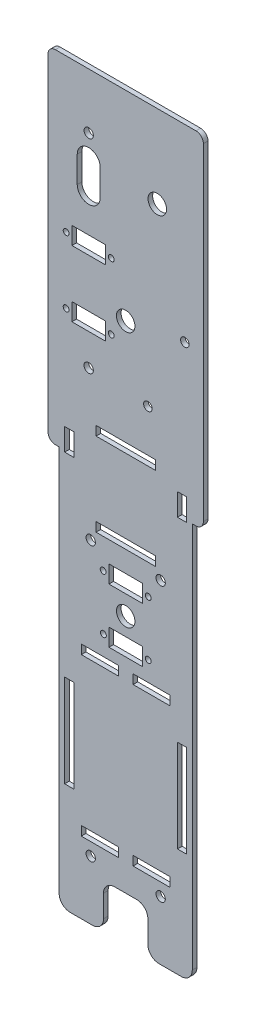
ISO-10303-21;
HEADER;
FILE_DESCRIPTION(('STEP AP214'),'2;1');
FILE_NAME('part.step','',(''),(''),'','','');
FILE_SCHEMA(('AUTOMOTIVE_DESIGN { 1 0 10303 214 1 1 1 1 }'));
ENDSEC;
DATA;
#1=APPLICATION_CONTEXT('core data for automotive mechanical design processes');
#2=APPLICATION_PROTOCOL_DEFINITION('international standard','automotive_design',2000,#1);
#3=PRODUCT_CONTEXT('',#1,'mechanical');
#4=PRODUCT('Part','Part','',(#3));
#5=PRODUCT_RELATED_PRODUCT_CATEGORY('part','',(#4));
#6=PRODUCT_DEFINITION_FORMATION('','',#4);
#7=PRODUCT_DEFINITION_CONTEXT('part definition',#1,'design');
#8=PRODUCT_DEFINITION('design','',#6,#7);
#9=PRODUCT_DEFINITION_SHAPE('','',#8);
#10=(LENGTH_UNIT() NAMED_UNIT(*) SI_UNIT(.MILLI.,.METRE.));
#11=(NAMED_UNIT(*) PLANE_ANGLE_UNIT() SI_UNIT($,.RADIAN.));
#12=(NAMED_UNIT(*) SI_UNIT($,.STERADIAN.) SOLID_ANGLE_UNIT());
#13=UNCERTAINTY_MEASURE_WITH_UNIT(LENGTH_MEASURE(1.E-05),#10,'distance_accuracy_value','');
#14=(GEOMETRIC_REPRESENTATION_CONTEXT(3) GLOBAL_UNCERTAINTY_ASSIGNED_CONTEXT((#13)) GLOBAL_UNIT_ASSIGNED_CONTEXT((#10,
#11,#12)) REPRESENTATION_CONTEXT('',''));
#15=CARTESIAN_POINT('',(0.,0.,0.));
#16=DIRECTION('',(0.,0.,1.));
#17=DIRECTION('',(1.,0.,0.));
#18=AXIS2_PLACEMENT_3D('',#15,#16,#17);
#19=CARTESIAN_POINT('',(-26.67,-127.,1.5875));
#20=DIRECTION('',(0.,1.,0.));
#21=DIRECTION('',(0.,0.,1.));
#22=AXIS2_PLACEMENT_3D('',#19,#20,#21);
#23=PLANE('',#22);
#24=DIRECTION('',(1.,0.,0.));
#25=VECTOR('',#24,1.);
#26=CARTESIAN_POINT('',(-26.67,-127.,0.));
#27=LINE('',#26,#25);
#28=CARTESIAN_POINT('',(11.43,-127.,0.));
#29=VERTEX_POINT('',#28);
#30=CARTESIAN_POINT('',(19.05,-127.,0.));
#31=VERTEX_POINT('',#30);
#32=EDGE_CURVE('E1411',#29,#31,#27,.T.);
#33=ORIENTED_EDGE('',*,*,#32,.T.);
#34=DIRECTION('',(0.,0.,1.));
#35=VECTOR('',#34,1.);
#36=CARTESIAN_POINT('',(19.05,-127.,1.5875));
#37=LINE('',#36,#35);
#38=CARTESIAN_POINT('',(19.05,-127.,1.5875));
#39=VERTEX_POINT('',#38);
#40=EDGE_CURVE('E1450',#31,#39,#37,.T.);
#41=ORIENTED_EDGE('',*,*,#40,.T.);
#42=DIRECTION('',(1.,0.,0.));
#43=VECTOR('',#42,1.);
#44=CARTESIAN_POINT('',(-26.67,-127.,1.5875));
#45=LINE('',#44,#43);
#46=CARTESIAN_POINT('',(11.43,-127.,1.5875));
#47=VERTEX_POINT('',#46);
#48=EDGE_CURVE('E1394',#47,#39,#45,.T.);
#49=ORIENTED_EDGE('',*,*,#48,.F.);
#50=DIRECTION('',(0.,0.,-1.));
#51=VECTOR('',#50,1.);
#52=CARTESIAN_POINT('',(11.43,-127.,1.5875));
#53=LINE('',#52,#51);
#54=EDGE_CURVE('E1446',#47,#29,#53,.T.);
#55=ORIENTED_EDGE('',*,*,#54,.T.);
#56=EDGE_LOOP('',(#33,#41,#49,#55));
#57=FACE_BOUND('',#56,.T.);
#58=ADVANCED_FACE('F40',(#57),#23,.F.);
#59=CARTESIAN_POINT('',(26.67,-127.,1.5875));
#60=DIRECTION('',(-1.,0.,0.));
#61=DIRECTION('',(0.,0.,1.));
#62=AXIS2_PLACEMENT_3D('',#59,#60,#61);
#63=PLANE('',#62);
#64=DIRECTION('',(0.,1.,0.));
#65=VECTOR('',#64,1.);
#66=CARTESIAN_POINT('',(26.67,-127.,1.5875));
#67=LINE('',#66,#65);
#68=CARTESIAN_POINT('',(26.67,12.065,1.5875));
#69=VERTEX_POINT('',#68);
#70=CARTESIAN_POINT('',(26.67,124.46,1.5875));
#71=VERTEX_POINT('',#70);
#72=EDGE_CURVE('E1381',#69,#71,#67,.T.);
#73=ORIENTED_EDGE('',*,*,#72,.F.);
#74=DIRECTION('',(0.,0.,-1.));
#75=VECTOR('',#74,1.);
#76=CARTESIAN_POINT('',(26.67,12.065,1.5875));
#77=LINE('',#76,#75);
#78=CARTESIAN_POINT('',(26.67,12.065,0.));
#79=VERTEX_POINT('',#78);
#80=EDGE_CURVE('E1542',#69,#79,#77,.T.);
#81=ORIENTED_EDGE('',*,*,#80,.T.);
#82=DIRECTION('',(0.,1.,0.));
#83=VECTOR('',#82,1.);
#84=CARTESIAN_POINT('',(26.67,-127.,0.));
#85=LINE('',#84,#83);
#86=CARTESIAN_POINT('',(26.67,124.46,0.));
#87=VERTEX_POINT('',#86);
#88=EDGE_CURVE('E1367',#79,#87,#85,.T.);
#89=ORIENTED_EDGE('',*,*,#88,.T.);
#90=DIRECTION('',(0.,0.,-1.));
#91=VECTOR('',#90,1.);
#92=CARTESIAN_POINT('',(26.67,124.46,1.5875));
#93=LINE('',#92,#91);
#94=EDGE_CURVE('E1539',#87,#71,#93,.F.);
#95=ORIENTED_EDGE('',*,*,#94,.T.);
#96=EDGE_LOOP('',(#73,#81,#89,#95));
#97=FACE_BOUND('',#96,.T.);
#98=ADVANCED_FACE('F1670',(#97),#63,.F.);
#99=CARTESIAN_POINT('',(-26.67,127.,1.5875));
#100=DIRECTION('',(0.,-1.,0.));
#101=DIRECTION('',(0.,0.,-1.));
#102=AXIS2_PLACEMENT_3D('',#99,#100,#101);
#103=PLANE('',#102);
#104=DIRECTION('',(-1.,0.,0.));
#105=VECTOR('',#104,1.);
#106=CARTESIAN_POINT('',(-26.67,127.,0.));
#107=LINE('',#106,#105);
#108=CARTESIAN_POINT('',(24.13,127.,0.));
#109=VERTEX_POINT('',#108);
#110=CARTESIAN_POINT('',(-24.13,127.,0.));
#111=VERTEX_POINT('',#110);
#112=EDGE_CURVE('E1403',#109,#111,#107,.T.);
#113=ORIENTED_EDGE('',*,*,#112,.T.);
#114=DIRECTION('',(0.,0.,-1.));
#115=VECTOR('',#114,1.);
#116=CARTESIAN_POINT('',(-24.13,127.,1.5875));
#117=LINE('',#116,#115);
#118=CARTESIAN_POINT('',(-24.13,127.,1.5875));
#119=VERTEX_POINT('',#118);
#120=EDGE_CURVE('E1553',#111,#119,#117,.F.);
#121=ORIENTED_EDGE('',*,*,#120,.T.);
#122=DIRECTION('',(-1.,0.,0.));
#123=VECTOR('',#122,1.);
#124=CARTESIAN_POINT('',(-26.67,127.,1.5875));
#125=LINE('',#124,#123);
#126=CARTESIAN_POINT('',(24.13,127.,1.5875));
#127=VERTEX_POINT('',#126);
#128=EDGE_CURVE('E1385',#127,#119,#125,.T.);
#129=ORIENTED_EDGE('',*,*,#128,.F.);
#130=DIRECTION('',(0.,0.,-1.));
#131=VECTOR('',#130,1.);
#132=CARTESIAN_POINT('',(24.13,127.,1.5875));
#133=LINE('',#132,#131);
#134=EDGE_CURVE('E1549',#127,#109,#133,.T.);
#135=ORIENTED_EDGE('',*,*,#134,.T.);
#136=EDGE_LOOP('',(#113,#121,#129,#135));
#137=FACE_BOUND('',#136,.T.);
#138=ADVANCED_FACE('F1661',(#137),#103,.F.);
#139=CARTESIAN_POINT('',(-26.67,-127.,1.5875));
#140=DIRECTION('',(1.,0.,0.));
#141=DIRECTION('',(0.,0.,-1.));
#142=AXIS2_PLACEMENT_3D('',#139,#140,#141);
#143=PLANE('',#142);
#144=DIRECTION('',(0.,-1.,0.));
#145=VECTOR('',#144,1.);
#146=CARTESIAN_POINT('',(-26.67,-127.,0.));
#147=LINE('',#146,#145);
#148=CARTESIAN_POINT('',(-26.67,124.46,0.));
#149=VERTEX_POINT('',#148);
#150=CARTESIAN_POINT('',(-26.67,12.065,0.));
#151=VERTEX_POINT('',#150);
#152=EDGE_CURVE('E1407',#149,#151,#147,.T.);
#153=ORIENTED_EDGE('',*,*,#152,.T.);
#154=DIRECTION('',(0.,0.,1.));
#155=VECTOR('',#154,1.);
#156=CARTESIAN_POINT('',(-26.67,12.065,1.5875));
#157=LINE('',#156,#155);
#158=CARTESIAN_POINT('',(-26.67,12.065,1.5875));
#159=VERTEX_POINT('',#158);
#160=EDGE_CURVE('E1508',#151,#159,#157,.T.);
#161=ORIENTED_EDGE('',*,*,#160,.T.);
#162=DIRECTION('',(0.,-1.,0.));
#163=VECTOR('',#162,1.);
#164=CARTESIAN_POINT('',(-26.67,-127.,1.5875));
#165=LINE('',#164,#163);
#166=CARTESIAN_POINT('',(-26.67,124.46,1.5875));
#167=VERTEX_POINT('',#166);
#168=EDGE_CURVE('E1390',#167,#159,#165,.T.);
#169=ORIENTED_EDGE('',*,*,#168,.F.);
#170=DIRECTION('',(0.,0.,-1.));
#171=VECTOR('',#170,1.);
#172=CARTESIAN_POINT('',(-26.67,124.46,1.5875));
#173=LINE('',#172,#171);
#174=EDGE_CURVE('E1504',#167,#149,#173,.T.);
#175=ORIENTED_EDGE('',*,*,#174,.T.);
#176=EDGE_LOOP('',(#153,#161,#169,#175));
#177=FACE_BOUND('',#176,.T.);
#178=ADVANCED_FACE('F1652',(#177),#143,.F.);
#179=CARTESIAN_POINT('',(-19.05,-127.,0.));
#180=VERTEX_POINT('',#179);
#181=CARTESIAN_POINT('',(-11.43,-127.,0.));
#182=VERTEX_POINT('',#181);
#183=EDGE_CURVE('E1386',#180,#182,#27,.T.);
#184=ORIENTED_EDGE('',*,*,#183,.T.);
#185=DIRECTION('',(0.,0.,1.));
#186=VECTOR('',#185,1.);
#187=CARTESIAN_POINT('',(-11.43,-127.,1.5875));
#188=LINE('',#187,#186);
#189=CARTESIAN_POINT('',(-11.43,-127.,1.5875));
#190=VERTEX_POINT('',#189);
#191=EDGE_CURVE('E1485',#182,#190,#188,.T.);
#192=ORIENTED_EDGE('',*,*,#191,.T.);
#193=CARTESIAN_POINT('',(-19.05,-127.,1.5875));
#194=VERTEX_POINT('',#193);
#195=EDGE_CURVE('E1395',#194,#190,#45,.T.);
#196=ORIENTED_EDGE('',*,*,#195,.F.);
#197=DIRECTION('',(0.,0.,-1.));
#198=VECTOR('',#197,1.);
#199=CARTESIAN_POINT('',(-19.05,-127.,1.5875));
#200=LINE('',#199,#198);
#201=EDGE_CURVE('E1481',#194,#180,#200,.T.);
#202=ORIENTED_EDGE('',*,*,#201,.T.);
#203=EDGE_LOOP('',(#184,#192,#196,#202));
#204=FACE_BOUND('',#203,.T.);
#205=ADVANCED_FACE('F1588',(#204),#23,.F.);
#206=CARTESIAN_POINT('',(0.,0.,1.5875));
#207=DIRECTION('',(0.,0.,-1.));
#208=DIRECTION('',(-1.,0.,0.));
#209=AXIS2_PLACEMENT_3D('',#206,#207,#208);
#210=PLANE('',#209);
#211=CARTESIAN_POINT('',(-20.447,51.9245539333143,1.5875));
#212=DIRECTION('',(0.,0.,1.));
#213=DIRECTION('',(1.,0.,0.));
#214=AXIS2_PLACEMENT_3D('',#211,#212,#213);
#215=CIRCLE('',#214,1.00330000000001);
#216=CARTESIAN_POINT('',(-19.4437,51.9245539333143,1.5875));
#217=VERTEX_POINT('',#216);
#218=EDGE_CURVE('E617',#217,#217,#215,.T.);
#219=ORIENTED_EDGE('',*,*,#218,.F.);
#220=EDGE_LOOP('',(#219));
#221=FACE_BOUND('',#220,.T.);
#222=DIRECTION('',(-1.,0.,0.));
#223=VECTOR('',#222,1.);
#224=CARTESIAN_POINT('',(-5.7531,-16.7188911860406,1.5875));
#225=LINE('',#224,#223);
#226=CARTESIAN_POINT('',(5.7531,-16.7188911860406,1.5875));
#227=VERTEX_POINT('',#226);
#228=CARTESIAN_POINT('',(-5.7531,-16.7188911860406,1.5875));
#229=VERTEX_POINT('',#228);
#230=EDGE_CURVE('E642',#227,#229,#225,.T.);
#231=ORIENTED_EDGE('',*,*,#230,.F.);
#232=DIRECTION('',(0.,1.,0.));
#233=VECTOR('',#232,1.);
#234=CARTESIAN_POINT('',(5.7531,-16.7188911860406,1.5875));
#235=LINE('',#234,#233);
#236=CARTESIAN_POINT('',(5.75310000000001,-22.7132911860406,1.5875));
#237=VERTEX_POINT('',#236);
#238=EDGE_CURVE('E56',#237,#227,#235,.T.);
#239=ORIENTED_EDGE('',*,*,#238,.F.);
#240=DIRECTION('',(1.,0.,0.));
#241=VECTOR('',#240,1.);
#242=CARTESIAN_POINT('',(-5.7531,-22.7132911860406,1.5875));
#243=LINE('',#242,#241);
#244=CARTESIAN_POINT('',(-5.7531,-22.7132911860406,1.5875));
#245=VERTEX_POINT('',#244);
#246=EDGE_CURVE('E627',#245,#237,#243,.T.);
#247=ORIENTED_EDGE('',*,*,#246,.F.);
#248=DIRECTION('',(0.,-1.,0.));
#249=VECTOR('',#248,1.);
#250=CARTESIAN_POINT('',(-5.7531,-16.7188911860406,1.5875));
#251=LINE('',#250,#249);
#252=EDGE_CURVE('E646',#229,#245,#251,.T.);
#253=ORIENTED_EDGE('',*,*,#252,.F.);
#254=EDGE_LOOP('',(#231,#239,#247,#253));
#255=FACE_BOUND('',#254,.T.);
#256=DIRECTION('',(-1.,0.,0.));
#257=VECTOR('',#256,1.);
#258=CARTESIAN_POINT('',(-5.75309999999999,-35.5060471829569,1.5875));
#259=LINE('',#258,#257);
#260=CARTESIAN_POINT('',(5.75310000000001,-35.5060471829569,1.5875));
#261=VERTEX_POINT('',#260);
#262=CARTESIAN_POINT('',(-5.75309999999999,-35.5060471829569,1.5875));
#263=VERTEX_POINT('',#262);
#264=EDGE_CURVE('E589',#261,#263,#259,.T.);
#265=ORIENTED_EDGE('',*,*,#264,.F.);
#266=DIRECTION('',(0.,1.,0.));
#267=VECTOR('',#266,1.);
#268=CARTESIAN_POINT('',(5.75310000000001,-35.5060471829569,1.5875));
#269=LINE('',#268,#267);
#270=CARTESIAN_POINT('',(5.75310000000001,-41.5004471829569,1.5875));
#271=VERTEX_POINT('',#270);
#272=EDGE_CURVE('E64',#271,#261,#269,.T.);
#273=ORIENTED_EDGE('',*,*,#272,.F.);
#274=DIRECTION('',(1.,0.,0.));
#275=VECTOR('',#274,1.);
#276=CARTESIAN_POINT('',(-5.75309999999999,-41.5004471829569,1.5875));
#277=LINE('',#276,#275);
#278=CARTESIAN_POINT('',(-5.75309999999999,-41.5004471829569,1.5875));
#279=VERTEX_POINT('',#278);
#280=EDGE_CURVE('E573',#279,#271,#277,.T.);
#281=ORIENTED_EDGE('',*,*,#280,.F.);
#282=DIRECTION('',(0.,-1.,0.));
#283=VECTOR('',#282,1.);
#284=CARTESIAN_POINT('',(-5.75309999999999,-35.5060471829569,1.5875));
#285=LINE('',#284,#283);
#286=EDGE_CURVE('E577',#263,#279,#285,.T.);
#287=ORIENTED_EDGE('',*,*,#286,.F.);
#288=EDGE_LOOP('',(#265,#273,#281,#287));
#289=FACE_BOUND('',#288,.T.);
#290=CARTESIAN_POINT('',(7.747,-19.7160911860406,1.5875));
#291=DIRECTION('',(0.,0.,1.));
#292=DIRECTION('',(1.,0.,0.));
#293=AXIS2_PLACEMENT_3D('',#290,#291,#292);
#294=CIRCLE('',#293,1.0033);
#295=CARTESIAN_POINT('',(8.7503,-19.7160911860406,1.5875));
#296=VERTEX_POINT('',#295);
#297=EDGE_CURVE('E607',#296,#296,#294,.T.);
#298=ORIENTED_EDGE('',*,*,#297,.F.);
#299=EDGE_LOOP('',(#298));
#300=FACE_BOUND('',#299,.T.);
#301=CARTESIAN_POINT('',(-4.95299999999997,74.6016450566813,1.5875));
#302=DIRECTION('',(0.,0.,1.));
#303=DIRECTION('',(1.,0.,0.));
#304=AXIS2_PLACEMENT_3D('',#301,#302,#303);
#305=CIRCLE('',#304,1.00329999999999);
#306=CARTESIAN_POINT('',(-3.94969999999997,74.6016450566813,1.5875));
#307=VERTEX_POINT('',#306);
#308=EDGE_CURVE('E720',#307,#307,#305,.T.);
#309=ORIENTED_EDGE('',*,*,#308,.F.);
#310=EDGE_LOOP('',(#309));
#311=FACE_BOUND('',#310,.T.);
#312=CARTESIAN_POINT('',(-20.447,74.6016450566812,1.5875));
#313=DIRECTION('',(0.,0.,1.));
#314=DIRECTION('',(1.,0.,0.));
#315=AXIS2_PLACEMENT_3D('',#312,#313,#314);
#316=CIRCLE('',#315,1.0033);
#317=CARTESIAN_POINT('',(-19.4437,74.6016450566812,1.5875));
#318=VERTEX_POINT('',#317);
#319=EDGE_CURVE('E699',#318,#318,#316,.T.);
#320=ORIENTED_EDGE('',*,*,#319,.F.);
#321=EDGE_LOOP('',(#320));
#322=FACE_BOUND('',#321,.T.);
#323=DIRECTION('',(-1.,0.,0.));
#324=VECTOR('',#323,1.);
#325=CARTESIAN_POINT('',(-18.4531,77.5988450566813,1.5875));
#326=LINE('',#325,#324);
#327=CARTESIAN_POINT('',(-6.94689999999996,77.5988450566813,1.5875));
#328=VERTEX_POINT('',#327);
#329=CARTESIAN_POINT('',(-18.4531,77.5988450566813,1.5875));
#330=VERTEX_POINT('',#329);
#331=EDGE_CURVE('E684',#328,#330,#326,.T.);
#332=ORIENTED_EDGE('',*,*,#331,.F.);
#333=DIRECTION('',(0.,1.,0.));
#334=VECTOR('',#333,1.);
#335=CARTESIAN_POINT('',(-6.94689999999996,77.5988450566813,1.5875));
#336=LINE('',#335,#334);
#337=CARTESIAN_POINT('',(-6.94689999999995,71.6044450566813,1.5875));
#338=VERTEX_POINT('',#337);
#339=EDGE_CURVE('E681',#338,#328,#336,.T.);
#340=ORIENTED_EDGE('',*,*,#339,.F.);
#341=DIRECTION('',(1.,0.,0.));
#342=VECTOR('',#341,1.);
#343=CARTESIAN_POINT('',(-18.4531,71.6044450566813,1.5875));
#344=LINE('',#343,#342);
#345=CARTESIAN_POINT('',(-18.4531,71.6044450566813,1.5875));
#346=VERTEX_POINT('',#345);
#347=EDGE_CURVE('E668',#346,#338,#344,.T.);
#348=ORIENTED_EDGE('',*,*,#347,.F.);
#349=DIRECTION('',(0.,-1.,0.));
#350=VECTOR('',#349,1.);
#351=CARTESIAN_POINT('',(-18.4531,77.5988450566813,1.5875));
#352=LINE('',#351,#350);
#353=EDGE_CURVE('E689',#330,#346,#352,.T.);
#354=ORIENTED_EDGE('',*,*,#353,.F.);
#355=EDGE_LOOP('',(#332,#340,#348,#354));
#356=FACE_BOUND('',#355,.T.);
#357=CARTESIAN_POINT('',(-4.95299999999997,51.9245539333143,1.5875));
#358=DIRECTION('',(0.,0.,1.));
#359=DIRECTION('',(1.,0.,0.));
#360=AXIS2_PLACEMENT_3D('',#357,#358,#359);
#361=CIRCLE('',#360,1.0033);
#362=CARTESIAN_POINT('',(-3.94969999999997,51.9245539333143,1.5875));
#363=VERTEX_POINT('',#362);
#364=EDGE_CURVE('E616',#363,#363,#361,.T.);
#365=ORIENTED_EDGE('',*,*,#364,.F.);
#366=EDGE_LOOP('',(#365));
#367=FACE_BOUND('',#366,.T.);
#368=CARTESIAN_POINT('',(-7.64539999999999,-38.5032471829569,1.5875));
#369=DIRECTION('',(0.,0.,1.));
#370=DIRECTION('',(1.,0.,0.));
#371=AXIS2_PLACEMENT_3D('',#368,#369,#370);
#372=CIRCLE('',#371,1.0033);
#373=CARTESIAN_POINT('',(-6.64209999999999,-38.5032471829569,1.5875));
#374=VERTEX_POINT('',#373);
#375=EDGE_CURVE('E2736',#374,#374,#372,.T.);
#376=ORIENTED_EDGE('',*,*,#375,.F.);
#377=EDGE_LOOP('',(#376));
#378=FACE_BOUND('',#377,.T.);
#379=CARTESIAN_POINT('',(7.74700000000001,-38.5032471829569,1.5875));
#380=DIRECTION('',(0.,0.,1.));
#381=DIRECTION('',(1.,0.,0.));
#382=AXIS2_PLACEMENT_3D('',#379,#380,#381);
#383=CIRCLE('',#382,1.0033);
#384=CARTESIAN_POINT('',(8.75030000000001,-38.5032471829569,1.5875));
#385=VERTEX_POINT('',#384);
#386=EDGE_CURVE('E580',#385,#385,#383,.T.);
#387=ORIENTED_EDGE('',*,*,#386,.F.);
#388=EDGE_LOOP('',(#387));
#389=FACE_BOUND('',#388,.T.);
#390=CARTESIAN_POINT('',(-7.74699999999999,-19.7160911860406,1.5875));
#391=DIRECTION('',(0.,0.,1.));
#392=DIRECTION('',(1.,0.,0.));
#393=AXIS2_PLACEMENT_3D('',#390,#391,#392);
#394=CIRCLE('',#393,1.0033);
#395=CARTESIAN_POINT('',(-6.7437,-19.7160911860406,1.5875));
#396=VERTEX_POINT('',#395);
#397=EDGE_CURVE('E2743',#396,#396,#394,.T.);
#398=ORIENTED_EDGE('',*,*,#397,.F.);
#399=EDGE_LOOP('',(#398));
#400=FACE_BOUND('',#399,.T.);
#401=DIRECTION('',(-1.,0.,0.));
#402=VECTOR('',#401,1.);
#403=CARTESIAN_POINT('',(-18.4531,54.9217539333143,1.5875));
#404=LINE('',#403,#402);
#405=CARTESIAN_POINT('',(-6.94689999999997,54.9217539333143,1.5875));
#406=VERTEX_POINT('',#405);
#407=CARTESIAN_POINT('',(-18.4531,54.9217539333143,1.5875));
#408=VERTEX_POINT('',#407);
#409=EDGE_CURVE('E751',#406,#408,#404,.T.);
#410=ORIENTED_EDGE('',*,*,#409,.F.);
#411=DIRECTION('',(0.,1.,0.));
#412=VECTOR('',#411,1.);
#413=CARTESIAN_POINT('',(-6.94689999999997,54.9217539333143,1.5875));
#414=LINE('',#413,#412);
#415=CARTESIAN_POINT('',(-6.94689999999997,48.9273539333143,1.5875));
#416=VERTEX_POINT('',#415);
#417=EDGE_CURVE('E719',#416,#406,#414,.T.);
#418=ORIENTED_EDGE('',*,*,#417,.F.);
#419=DIRECTION('',(1.,0.,0.));
#420=VECTOR('',#419,1.);
#421=CARTESIAN_POINT('',(-18.4531,48.9273539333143,1.5875));
#422=LINE('',#421,#420);
#423=CARTESIAN_POINT('',(-18.4531,48.9273539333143,1.5875));
#424=VERTEX_POINT('',#423);
#425=EDGE_CURVE('E736',#424,#416,#422,.T.);
#426=ORIENTED_EDGE('',*,*,#425,.F.);
#427=DIRECTION('',(0.,-1.,0.));
#428=VECTOR('',#427,1.);
#429=CARTESIAN_POINT('',(-18.4531,54.9217539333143,1.5875));
#430=LINE('',#429,#428);
#431=EDGE_CURVE('E755',#408,#424,#430,.T.);
#432=ORIENTED_EDGE('',*,*,#431,.F.);
#433=EDGE_LOOP('',(#410,#418,#426,#432));
#434=FACE_BOUND('',#433,.T.);
#435=CARTESIAN_POINT('',(10.8459908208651,98.5861052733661,1.5875));
#436=DIRECTION('',(0.,0.,1.));
#437=DIRECTION('',(1.,0.,0.));
#438=AXIS2_PLACEMENT_3D('',#435,#436,#437);
#439=CIRCLE('',#438,3.175);
#440=CARTESIAN_POINT('',(14.0209908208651,98.5861052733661,1.5875));
#441=VERTEX_POINT('',#440);
#442=EDGE_CURVE('E765',#441,#441,#439,.T.);
#443=ORIENTED_EDGE('',*,*,#442,.F.);
#444=EDGE_LOOP('',(#443));
#445=FACE_BOUND('',#444,.T.);
#446=CARTESIAN_POINT('',(0.,58.4036897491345,1.5875));
#447=DIRECTION('',(0.,0.,1.));
#448=DIRECTION('',(1.,0.,0.));
#449=AXIS2_PLACEMENT_3D('',#446,#447,#448);
#450=CIRCLE('',#449,3.175);
#451=CARTESIAN_POINT('',(3.175,58.4036897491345,1.5875));
#452=VERTEX_POINT('',#451);
#453=EDGE_CURVE('E782',#452,#452,#450,.T.);
#454=ORIENTED_EDGE('',*,*,#453,.F.);
#455=EDGE_LOOP('',(#454));
#456=FACE_BOUND('',#455,.T.);
#457=CARTESIAN_POINT('',(0.,-29.3845706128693,1.5875));
#458=DIRECTION('',(0.,0.,1.));
#459=DIRECTION('',(1.,0.,0.));
#460=AXIS2_PLACEMENT_3D('',#457,#458,#459);
#461=CIRCLE('',#460,3.175);
#462=CARTESIAN_POINT('',(3.175,-29.3845706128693,1.5875));
#463=VERTEX_POINT('',#462);
#464=EDGE_CURVE('E790',#463,#463,#461,.T.);
#465=ORIENTED_EDGE('',*,*,#464,.F.);
#466=EDGE_LOOP('',(#465));
#467=FACE_BOUND('',#466,.T.);
#468=DIRECTION('',(0.,-1.,0.));
#469=VECTOR('',#468,1.);
#470=CARTESIAN_POINT('',(-16.6368273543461,99.6777813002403,1.5875));
#471=LINE('',#470,#469);
#472=CARTESIAN_POINT('',(-16.6368273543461,99.6777813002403,1.5875));
#473=VERTEX_POINT('',#472);
#474=CARTESIAN_POINT('',(-16.6368273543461,90.657957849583,1.5875));
#475=VERTEX_POINT('',#474);
#476=EDGE_CURVE('E801',#473,#475,#471,.T.);
#477=ORIENTED_EDGE('',*,*,#476,.F.);
#478=CARTESIAN_POINT('',(-12.7,99.6777813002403,1.5875));
#479=DIRECTION('',(0.,0.,1.));
#480=DIRECTION('',(1.,0.,0.));
#481=AXIS2_PLACEMENT_3D('',#478,#479,#480);
#482=CIRCLE('',#481,3.93682735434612);
#483=CARTESIAN_POINT('',(-8.76317264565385,99.6777813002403,1.5875));
#484=VERTEX_POINT('',#483);
#485=EDGE_CURVE('E798',#484,#473,#482,.T.);
#486=ORIENTED_EDGE('',*,*,#485,.F.);
#487=DIRECTION('',(0.,1.,0.));
#488=VECTOR('',#487,1.);
#489=CARTESIAN_POINT('',(-8.76317264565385,99.6777813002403,1.5875));
#490=LINE('',#489,#488);
#491=CARTESIAN_POINT('',(-8.76317264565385,90.657957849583,1.5875));
#492=VERTEX_POINT('',#491);
#493=EDGE_CURVE('E809',#492,#484,#490,.T.);
#494=ORIENTED_EDGE('',*,*,#493,.F.);
#495=CARTESIAN_POINT('',(-12.7,90.657957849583,1.5875));
#496=DIRECTION('',(0.,0.,1.));
#497=DIRECTION('',(1.,0.,0.));
#498=AXIS2_PLACEMENT_3D('',#495,#496,#497);
#499=CIRCLE('',#498,3.93682735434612);
#500=EDGE_CURVE('E805',#475,#492,#499,.T.);
#501=ORIENTED_EDGE('',*,*,#500,.F.);
#502=EDGE_LOOP('',(#477,#486,#494,#501));
#503=FACE_BOUND('',#502,.T.);
#504=DIRECTION('',(-1.,0.,0.));
#505=VECTOR('',#504,1.);
#506=CARTESIAN_POINT('',(-10.16,-6.31884993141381,1.5875));
#507=LINE('',#506,#505);
#508=CARTESIAN_POINT('',(10.16,-6.31884993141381,1.5875));
#509=VERTEX_POINT('',#508);
#510=CARTESIAN_POINT('',(-10.16,-6.31884993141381,1.5875));
#511=VERTEX_POINT('',#510);
#512=EDGE_CURVE('E848',#509,#511,#507,.T.);
#513=ORIENTED_EDGE('',*,*,#512,.F.);
#514=DIRECTION('',(0.,1.,0.));
#515=VECTOR('',#514,1.);
#516=CARTESIAN_POINT('',(10.16,-6.31884993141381,1.5875));
#517=LINE('',#516,#515);
#518=CARTESIAN_POINT('',(10.16,-9.49384993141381,1.5875));
#519=VERTEX_POINT('',#518);
#520=EDGE_CURVE('E845',#519,#509,#517,.T.);
#521=ORIENTED_EDGE('',*,*,#520,.F.);
#522=DIRECTION('',(1.,0.,0.));
#523=VECTOR('',#522,1.);
#524=CARTESIAN_POINT('',(-10.16,-9.49384993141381,1.5875));
#525=LINE('',#524,#523);
#526=CARTESIAN_POINT('',(-10.16,-9.49384993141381,1.5875));
#527=VERTEX_POINT('',#526);
#528=EDGE_CURVE('E832',#527,#519,#525,.T.);
#529=ORIENTED_EDGE('',*,*,#528,.F.);
#530=DIRECTION('',(0.,-1.,0.));
#531=VECTOR('',#530,1.);
#532=CARTESIAN_POINT('',(-10.16,-6.31884993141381,1.5875));
#533=LINE('',#532,#531);
#534=EDGE_CURVE('E853',#511,#527,#533,.T.);
#535=ORIENTED_EDGE('',*,*,#534,.F.);
#536=EDGE_LOOP('',(#513,#521,#529,#535));
#537=FACE_BOUND('',#536,.T.);
#538=DIRECTION('',(-1.,0.,0.));
#539=VECTOR('',#538,1.);
#540=CARTESIAN_POINT('',(-17.78,16.5411500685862,1.5875));
#541=LINE('',#540,#539);
#542=CARTESIAN_POINT('',(-17.78,16.5411500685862,1.5875));
#543=VERTEX_POINT('',#542);
#544=CARTESIAN_POINT('',(-20.955,16.5411500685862,1.5875));
#545=VERTEX_POINT('',#544);
#546=EDGE_CURVE('E894',#543,#545,#541,.T.);
#547=ORIENTED_EDGE('',*,*,#546,.F.);
#548=DIRECTION('',(0.,1.,0.));
#549=VECTOR('',#548,1.);
#550=CARTESIAN_POINT('',(-17.78,16.5411500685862,1.5875));
#551=LINE('',#550,#549);
#552=CARTESIAN_POINT('',(-17.78,8.92115006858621,1.5875));
#553=VERTEX_POINT('',#552);
#554=EDGE_CURVE('E891',#553,#543,#551,.T.);
#555=ORIENTED_EDGE('',*,*,#554,.F.);
#556=DIRECTION('',(1.,0.,0.));
#557=VECTOR('',#556,1.);
#558=CARTESIAN_POINT('',(-17.78,8.92115006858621,1.5875));
#559=LINE('',#558,#557);
#560=CARTESIAN_POINT('',(-20.955,8.92115006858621,1.5875));
#561=VERTEX_POINT('',#560);
#562=EDGE_CURVE('E878',#561,#553,#559,.T.);
#563=ORIENTED_EDGE('',*,*,#562,.F.);
#564=DIRECTION('',(0.,-1.,0.));
#565=VECTOR('',#564,1.);
#566=CARTESIAN_POINT('',(-20.955,16.5411500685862,1.5875));
#567=LINE('',#566,#565);
#568=EDGE_CURVE('E899',#545,#561,#567,.T.);
#569=ORIENTED_EDGE('',*,*,#568,.F.);
#570=EDGE_LOOP('',(#547,#555,#563,#569));
#571=FACE_BOUND('',#570,.T.);
#572=DIRECTION('',(1.,0.,0.));
#573=VECTOR('',#572,1.);
#574=CARTESIAN_POINT('',(-10.16,19.0811500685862,1.5875));
#575=LINE('',#574,#573);
#576=CARTESIAN_POINT('',(-10.16,19.0811500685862,1.5875));
#577=VERTEX_POINT('',#576);
#578=CARTESIAN_POINT('',(10.16,19.0811500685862,1.5875));
#579=VERTEX_POINT('',#578);
#580=EDGE_CURVE('E938',#577,#579,#575,.T.);
#581=ORIENTED_EDGE('',*,*,#580,.F.);
#582=DIRECTION('',(0.,-1.,0.));
#583=VECTOR('',#582,1.);
#584=CARTESIAN_POINT('',(-10.16,19.0811500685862,1.5875));
#585=LINE('',#584,#583);
#586=CARTESIAN_POINT('',(-10.16,22.2561500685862,1.5875));
#587=VERTEX_POINT('',#586);
#588=EDGE_CURVE('E935',#587,#577,#585,.T.);
#589=ORIENTED_EDGE('',*,*,#588,.F.);
#590=DIRECTION('',(-1.,0.,0.));
#591=VECTOR('',#590,1.);
#592=CARTESIAN_POINT('',(-10.16,22.2561500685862,1.5875));
#593=LINE('',#592,#591);
#594=CARTESIAN_POINT('',(10.16,22.2561500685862,1.5875));
#595=VERTEX_POINT('',#594);
#596=EDGE_CURVE('E922',#595,#587,#593,.T.);
#597=ORIENTED_EDGE('',*,*,#596,.F.);
#598=DIRECTION('',(0.,1.,0.));
#599=VECTOR('',#598,1.);
#600=CARTESIAN_POINT('',(10.16,19.0811500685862,1.5875));
#601=LINE('',#600,#599);
#602=EDGE_CURVE('E943',#579,#595,#601,.T.);
#603=ORIENTED_EDGE('',*,*,#602,.F.);
#604=EDGE_LOOP('',(#581,#589,#597,#603));
#605=FACE_BOUND('',#604,.T.);
#606=DIRECTION('',(-1.,0.,0.));
#607=VECTOR('',#606,1.);
#608=CARTESIAN_POINT('',(17.78,16.5411500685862,1.5875));
#609=LINE('',#608,#607);
#610=CARTESIAN_POINT('',(20.955,16.5411500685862,1.5875));
#611=VERTEX_POINT('',#610);
#612=CARTESIAN_POINT('',(17.78,16.5411500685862,1.5875));
#613=VERTEX_POINT('',#612);
#614=EDGE_CURVE('E981',#611,#613,#609,.T.);
#615=ORIENTED_EDGE('',*,*,#614,.F.);
#616=DIRECTION('',(0.,1.,0.));
#617=VECTOR('',#616,1.);
#618=CARTESIAN_POINT('',(20.955,16.5411500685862,1.5875));
#619=LINE('',#618,#617);
#620=CARTESIAN_POINT('',(20.955,8.92115006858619,1.5875));
#621=VERTEX_POINT('',#620);
#622=EDGE_CURVE('E817',#621,#611,#619,.T.);
#623=ORIENTED_EDGE('',*,*,#622,.F.);
#624=DIRECTION('',(1.,0.,0.));
#625=VECTOR('',#624,1.);
#626=CARTESIAN_POINT('',(17.78,8.92115006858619,1.5875));
#627=LINE('',#626,#625);
#628=CARTESIAN_POINT('',(17.78,8.92115006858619,1.5875));
#629=VERTEX_POINT('',#628);
#630=EDGE_CURVE('E966',#629,#621,#627,.T.);
#631=ORIENTED_EDGE('',*,*,#630,.F.);
#632=DIRECTION('',(0.,-1.,0.));
#633=VECTOR('',#632,1.);
#634=CARTESIAN_POINT('',(17.78,16.5411500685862,1.5875));
#635=LINE('',#634,#633);
#636=EDGE_CURVE('E985',#613,#629,#635,.T.);
#637=ORIENTED_EDGE('',*,*,#636,.F.);
#638=EDGE_LOOP('',(#615,#623,#631,#637));
#639=FACE_BOUND('',#638,.T.);
#640=DIRECTION('',(-1.,0.,0.));
#641=VECTOR('',#640,1.);
#642=CARTESIAN_POINT('',(17.78,-57.9608891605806,1.5875));
#643=LINE('',#642,#641);
#644=CARTESIAN_POINT('',(20.955,-57.9608891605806,1.5875));
#645=VERTEX_POINT('',#644);
#646=CARTESIAN_POINT('',(17.78,-57.9608891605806,1.5875));
#647=VERTEX_POINT('',#646);
#648=EDGE_CURVE('E1024',#645,#647,#643,.T.);
#649=ORIENTED_EDGE('',*,*,#648,.F.);
#650=DIRECTION('',(0.,1.,0.));
#651=VECTOR('',#650,1.);
#652=CARTESIAN_POINT('',(20.955,-57.9608891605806,1.5875));
#653=LINE('',#652,#651);
#654=CARTESIAN_POINT('',(20.955,-89.7108891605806,1.5875));
#655=VERTEX_POINT('',#654);
#656=EDGE_CURVE('E1021',#655,#645,#653,.T.);
#657=ORIENTED_EDGE('',*,*,#656,.F.);
#658=DIRECTION('',(1.,0.,0.));
#659=VECTOR('',#658,1.);
#660=CARTESIAN_POINT('',(17.78,-89.7108891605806,1.5875));
#661=LINE('',#660,#659);
#662=CARTESIAN_POINT('',(17.78,-89.7108891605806,1.5875));
#663=VERTEX_POINT('',#662);
#664=EDGE_CURVE('E1008',#663,#655,#661,.T.);
#665=ORIENTED_EDGE('',*,*,#664,.F.);
#666=DIRECTION('',(0.,-1.,0.));
#667=VECTOR('',#666,1.);
#668=CARTESIAN_POINT('',(17.78,-57.9608891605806,1.5875));
#669=LINE('',#668,#667);
#670=EDGE_CURVE('E1029',#647,#663,#669,.T.);
#671=ORIENTED_EDGE('',*,*,#670,.F.);
#672=EDGE_LOOP('',(#649,#657,#665,#671));
#673=FACE_BOUND('',#672,.T.);
#674=DIRECTION('',(-1.,0.,0.));
#675=VECTOR('',#674,1.);
#676=CARTESIAN_POINT('',(2.54000000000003,-45.2608891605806,1.5875));
#677=LINE('',#676,#675);
#678=CARTESIAN_POINT('',(15.24,-45.2608891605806,1.5875));
#679=VERTEX_POINT('',#678);
#680=CARTESIAN_POINT('',(2.54000000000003,-45.2608891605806,1.5875));
#681=VERTEX_POINT('',#680);
#682=EDGE_CURVE('E1070',#679,#681,#677,.T.);
#683=ORIENTED_EDGE('',*,*,#682,.F.);
#684=DIRECTION('',(0.,1.,0.));
#685=VECTOR('',#684,1.);
#686=CARTESIAN_POINT('',(15.24,-45.2608891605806,1.5875));
#687=LINE('',#686,#685);
#688=CARTESIAN_POINT('',(15.24,-48.4358891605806,1.5875));
#689=VERTEX_POINT('',#688);
#690=EDGE_CURVE('E1067',#689,#679,#687,.T.);
#691=ORIENTED_EDGE('',*,*,#690,.F.);
#692=DIRECTION('',(1.,0.,0.));
#693=VECTOR('',#692,1.);
#694=CARTESIAN_POINT('',(2.54000000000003,-48.4358891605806,1.5875));
#695=LINE('',#694,#693);
#696=CARTESIAN_POINT('',(2.54000000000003,-48.4358891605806,1.5875));
#697=VERTEX_POINT('',#696);
#698=EDGE_CURVE('E1054',#697,#689,#695,.T.);
#699=ORIENTED_EDGE('',*,*,#698,.F.);
#700=DIRECTION('',(0.,-1.,0.));
#701=VECTOR('',#700,1.);
#702=CARTESIAN_POINT('',(2.54000000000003,-45.2608891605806,1.5875));
#703=LINE('',#702,#701);
#704=EDGE_CURVE('E1075',#681,#697,#703,.T.);
#705=ORIENTED_EDGE('',*,*,#704,.F.);
#706=EDGE_LOOP('',(#683,#691,#699,#705));
#707=FACE_BOUND('',#706,.T.);
#708=DIRECTION('',(1.,0.,0.));
#709=VECTOR('',#708,1.);
#710=CARTESIAN_POINT('',(2.54000000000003,-102.410889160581,1.5875));
#711=LINE('',#710,#709);
#712=CARTESIAN_POINT('',(2.54000000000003,-102.410889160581,1.5875));
#713=VERTEX_POINT('',#712);
#714=CARTESIAN_POINT('',(15.24,-102.410889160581,1.5875));
#715=VERTEX_POINT('',#714);
#716=EDGE_CURVE('E1114',#713,#715,#711,.T.);
#717=ORIENTED_EDGE('',*,*,#716,.F.);
#718=DIRECTION('',(0.,-1.,0.));
#719=VECTOR('',#718,1.);
#720=CARTESIAN_POINT('',(2.54000000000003,-102.410889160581,1.5875));
#721=LINE('',#720,#719);
#722=CARTESIAN_POINT('',(2.54000000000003,-99.2358891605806,1.5875));
#723=VERTEX_POINT('',#722);
#724=EDGE_CURVE('E1111',#723,#713,#721,.T.);
#725=ORIENTED_EDGE('',*,*,#724,.F.);
#726=DIRECTION('',(-1.,0.,0.));
#727=VECTOR('',#726,1.);
#728=CARTESIAN_POINT('',(2.54000000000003,-99.2358891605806,1.5875));
#729=LINE('',#728,#727);
#730=CARTESIAN_POINT('',(15.24,-99.2358891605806,1.5875));
#731=VERTEX_POINT('',#730);
#732=EDGE_CURVE('E1098',#731,#723,#729,.T.);
#733=ORIENTED_EDGE('',*,*,#732,.F.);
#734=DIRECTION('',(0.,1.,0.));
#735=VECTOR('',#734,1.);
#736=CARTESIAN_POINT('',(15.24,-102.410889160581,1.5875));
#737=LINE('',#736,#735);
#738=EDGE_CURVE('E1119',#715,#731,#737,.T.);
#739=ORIENTED_EDGE('',*,*,#738,.F.);
#740=EDGE_LOOP('',(#717,#725,#733,#739));
#741=FACE_BOUND('',#740,.T.);
#742=DIRECTION('',(-1.,0.,0.));
#743=VECTOR('',#742,1.);
#744=CARTESIAN_POINT('',(-2.54000000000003,-45.2608891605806,1.5875));
#745=LINE('',#744,#743);
#746=CARTESIAN_POINT('',(-2.54000000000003,-45.2608891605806,1.5875));
#747=VERTEX_POINT('',#746);
#748=CARTESIAN_POINT('',(-15.24,-45.2608891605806,1.5875));
#749=VERTEX_POINT('',#748);
#750=EDGE_CURVE('E1158',#747,#749,#745,.T.);
#751=ORIENTED_EDGE('',*,*,#750,.F.);
#752=DIRECTION('',(0.,1.,0.));
#753=VECTOR('',#752,1.);
#754=CARTESIAN_POINT('',(-2.54000000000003,-45.2608891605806,1.5875));
#755=LINE('',#754,#753);
#756=CARTESIAN_POINT('',(-2.54000000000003,-48.4358891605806,1.5875));
#757=VERTEX_POINT('',#756);
#758=EDGE_CURVE('E1155',#757,#747,#755,.T.);
#759=ORIENTED_EDGE('',*,*,#758,.F.);
#760=DIRECTION('',(1.,0.,0.));
#761=VECTOR('',#760,1.);
#762=CARTESIAN_POINT('',(-2.54000000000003,-48.4358891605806,1.5875));
#763=LINE('',#762,#761);
#764=CARTESIAN_POINT('',(-15.24,-48.4358891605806,1.5875));
#765=VERTEX_POINT('',#764);
#766=EDGE_CURVE('E1142',#765,#757,#763,.T.);
#767=ORIENTED_EDGE('',*,*,#766,.F.);
#768=DIRECTION('',(0.,-1.,0.));
#769=VECTOR('',#768,1.);
#770=CARTESIAN_POINT('',(-15.24,-45.2608891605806,1.5875));
#771=LINE('',#770,#769);
#772=EDGE_CURVE('E1163',#749,#765,#771,.T.);
#773=ORIENTED_EDGE('',*,*,#772,.F.);
#774=EDGE_LOOP('',(#751,#759,#767,#773));
#775=FACE_BOUND('',#774,.T.);
#776=DIRECTION('',(-1.,0.,0.));
#777=VECTOR('',#776,1.);
#778=CARTESIAN_POINT('',(-2.54000000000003,-99.2358891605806,1.5875));
#779=LINE('',#778,#777);
#780=CARTESIAN_POINT('',(-2.54000000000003,-99.2358891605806,1.5875));
#781=VERTEX_POINT('',#780);
#782=CARTESIAN_POINT('',(-15.24,-99.2358891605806,1.5875));
#783=VERTEX_POINT('',#782);
#784=EDGE_CURVE('E1202',#781,#783,#779,.T.);
#785=ORIENTED_EDGE('',*,*,#784,.F.);
#786=DIRECTION('',(0.,1.,0.));
#787=VECTOR('',#786,1.);
#788=CARTESIAN_POINT('',(-2.54000000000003,-102.410889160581,1.5875));
#789=LINE('',#788,#787);
#790=CARTESIAN_POINT('',(-2.54000000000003,-102.410889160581,1.5875));
#791=VERTEX_POINT('',#790);
#792=EDGE_CURVE('E1199',#791,#781,#789,.T.);
#793=ORIENTED_EDGE('',*,*,#792,.F.);
#794=DIRECTION('',(1.,0.,0.));
#795=VECTOR('',#794,1.);
#796=CARTESIAN_POINT('',(-2.54000000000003,-102.410889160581,1.5875));
#797=LINE('',#796,#795);
#798=CARTESIAN_POINT('',(-15.24,-102.410889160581,1.5875));
#799=VERTEX_POINT('',#798);
#800=EDGE_CURVE('E1186',#799,#791,#797,.T.);
#801=ORIENTED_EDGE('',*,*,#800,.F.);
#802=DIRECTION('',(0.,-1.,0.));
#803=VECTOR('',#802,1.);
#804=CARTESIAN_POINT('',(-15.24,-102.410889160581,1.5875));
#805=LINE('',#804,#803);
#806=EDGE_CURVE('E1207',#783,#799,#805,.T.);
#807=ORIENTED_EDGE('',*,*,#806,.F.);
#808=EDGE_LOOP('',(#785,#793,#801,#807));
#809=FACE_BOUND('',#808,.T.);
#810=DIRECTION('',(-1.,0.,0.));
#811=VECTOR('',#810,1.);
#812=CARTESIAN_POINT('',(-17.78,-57.9608891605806,1.5875));
#813=LINE('',#812,#811);
#814=CARTESIAN_POINT('',(-17.78,-57.9608891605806,1.5875));
#815=VERTEX_POINT('',#814);
#816=CARTESIAN_POINT('',(-20.955,-57.9608891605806,1.5875));
#817=VERTEX_POINT('',#816);
#818=EDGE_CURVE('E1245',#815,#817,#813,.T.);
#819=ORIENTED_EDGE('',*,*,#818,.F.);
#820=DIRECTION('',(0.,1.,0.));
#821=VECTOR('',#820,1.);
#822=CARTESIAN_POINT('',(-17.78,-57.9608891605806,1.5875));
#823=LINE('',#822,#821);
#824=CARTESIAN_POINT('',(-17.78,-89.7108891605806,1.5875));
#825=VERTEX_POINT('',#824);
#826=EDGE_CURVE('E863',#825,#815,#823,.T.);
#827=ORIENTED_EDGE('',*,*,#826,.F.);
#828=DIRECTION('',(1.,0.,0.));
#829=VECTOR('',#828,1.);
#830=CARTESIAN_POINT('',(-17.78,-89.7108891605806,1.5875));
#831=LINE('',#830,#829);
#832=CARTESIAN_POINT('',(-20.955,-89.7108891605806,1.5875));
#833=VERTEX_POINT('',#832);
#834=EDGE_CURVE('E1230',#833,#825,#831,.T.);
#835=ORIENTED_EDGE('',*,*,#834,.F.);
#836=DIRECTION('',(0.,-1.,0.));
#837=VECTOR('',#836,1.);
#838=CARTESIAN_POINT('',(-20.955,-57.9608891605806,1.5875));
#839=LINE('',#838,#837);
#840=EDGE_CURVE('E1249',#817,#833,#839,.T.);
#841=ORIENTED_EDGE('',*,*,#840,.F.);
#842=EDGE_LOOP('',(#819,#827,#835,#841));
#843=FACE_BOUND('',#842,.T.);
#844=CARTESIAN_POINT('',(-12.7,107.95,1.5875));
#845=DIRECTION('',(0.,0.,1.));
#846=DIRECTION('',(1.,0.,0.));
#847=AXIS2_PLACEMENT_3D('',#844,#845,#846);
#848=CIRCLE('',#847,1.59999999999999);
#849=CARTESIAN_POINT('',(-11.1,107.95,1.5875));
#850=VERTEX_POINT('',#849);
#851=EDGE_CURVE('E1039',#850,#850,#848,.T.);
#852=ORIENTED_EDGE('',*,*,#851,.F.);
#853=EDGE_LOOP('',(#852));
#854=FACE_BOUND('',#853,.T.);
#855=CARTESIAN_POINT('',(-12.7,38.1,1.5875));
#856=DIRECTION('',(0.,0.,1.));
#857=DIRECTION('',(1.,0.,0.));
#858=AXIS2_PLACEMENT_3D('',#855,#856,#857);
#859=CIRCLE('',#858,1.59999999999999);
#860=CARTESIAN_POINT('',(-11.1,38.1,1.5875));
#861=VERTEX_POINT('',#860);
#862=EDGE_CURVE('E1274',#861,#861,#859,.T.);
#863=ORIENTED_EDGE('',*,*,#862,.F.);
#864=EDGE_LOOP('',(#863));
#865=FACE_BOUND('',#864,.T.);
#866=CARTESIAN_POINT('',(-12.,-12.7354867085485,1.5875));
#867=DIRECTION('',(0.,0.,1.));
#868=DIRECTION('',(1.,0.,0.));
#869=AXIS2_PLACEMENT_3D('',#866,#867,#868);
#870=CIRCLE('',#869,1.6);
#871=CARTESIAN_POINT('',(-10.4,-12.7354867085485,1.5875));
#872=VERTEX_POINT('',#871);
#873=EDGE_CURVE('E1282',#872,#872,#870,.T.);
#874=ORIENTED_EDGE('',*,*,#873,.F.);
#875=EDGE_LOOP('',(#874));
#876=FACE_BOUND('',#875,.T.);
#877=CARTESIAN_POINT('',(12.,-12.7354867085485,1.5875));
#878=DIRECTION('',(0.,0.,1.));
#879=DIRECTION('',(1.,0.,0.));
#880=AXIS2_PLACEMENT_3D('',#877,#878,#879);
#881=CIRCLE('',#880,1.6);
#882=CARTESIAN_POINT('',(13.6,-12.7354867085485,1.5875));
#883=VERTEX_POINT('',#882);
#884=EDGE_CURVE('E1290',#883,#883,#881,.T.);
#885=ORIENTED_EDGE('',*,*,#884,.F.);
#886=EDGE_LOOP('',(#885));
#887=FACE_BOUND('',#886,.T.);
#888=CARTESIAN_POINT('',(12.,-106.735486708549,1.5875));
#889=DIRECTION('',(0.,0.,1.));
#890=DIRECTION('',(1.,0.,0.));
#891=AXIS2_PLACEMENT_3D('',#888,#889,#890);
#892=CIRCLE('',#891,1.6);
#893=CARTESIAN_POINT('',(13.6,-106.735486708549,1.5875));
#894=VERTEX_POINT('',#893);
#895=EDGE_CURVE('E1298',#894,#894,#892,.T.);
#896=ORIENTED_EDGE('',*,*,#895,.F.);
#897=EDGE_LOOP('',(#896));
#898=FACE_BOUND('',#897,.T.);
#899=CARTESIAN_POINT('',(-12.,-106.735486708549,1.5875));
#900=DIRECTION('',(0.,0.,1.));
#901=DIRECTION('',(1.,0.,0.));
#902=AXIS2_PLACEMENT_3D('',#899,#900,#901);
#903=CIRCLE('',#902,1.6);
#904=CARTESIAN_POINT('',(-10.4,-106.735486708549,1.5875));
#905=VERTEX_POINT('',#904);
#906=EDGE_CURVE('E1306',#905,#905,#903,.T.);
#907=ORIENTED_EDGE('',*,*,#906,.F.);
#908=EDGE_LOOP('',(#907));
#909=FACE_BOUND('',#908,.T.);
#910=CARTESIAN_POINT('',(20.32,62.23,1.5875));
#911=DIRECTION('',(0.,0.,1.));
#912=DIRECTION('',(1.,0.,0.));
#913=AXIS2_PLACEMENT_3D('',#910,#911,#912);
#914=CIRCLE('',#913,1.4732);
#915=CARTESIAN_POINT('',(21.7932,62.23,1.5875));
#916=VERTEX_POINT('',#915);
#917=EDGE_CURVE('E1314',#916,#916,#914,.T.);
#918=ORIENTED_EDGE('',*,*,#917,.F.);
#919=EDGE_LOOP('',(#918));
#920=FACE_BOUND('',#919,.T.);
#921=CARTESIAN_POINT('',(7.62000000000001,36.83,1.5875));
#922=DIRECTION('',(0.,0.,1.));
#923=DIRECTION('',(1.,0.,0.));
#924=AXIS2_PLACEMENT_3D('',#921,#922,#923);
#925=CIRCLE('',#924,1.4732);
#926=CARTESIAN_POINT('',(9.09320000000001,36.83,1.5875));
#927=VERTEX_POINT('',#926);
#928=EDGE_CURVE('E1322',#927,#927,#925,.T.);
#929=ORIENTED_EDGE('',*,*,#928,.F.);
#930=EDGE_LOOP('',(#929));
#931=FACE_BOUND('',#930,.T.);
#932=ORIENTED_EDGE('',*,*,#168,.T.);
#933=CARTESIAN_POINT('',(-24.13,12.065,1.5875));
#934=DIRECTION('',(0.,0.,-1.));
#935=DIRECTION('',(-1.,0.,0.));
#936=AXIS2_PLACEMENT_3D('',#933,#934,#935);
#937=CIRCLE('',#936,2.54);
#938=CARTESIAN_POINT('',(-24.13,9.52500000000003,1.5875));
#939=VERTEX_POINT('',#938);
#940=EDGE_CURVE('E1521',#159,#939,#937,.F.);
#941=ORIENTED_EDGE('',*,*,#940,.T.);
#942=DIRECTION('',(-1.,0.,0.));
#943=VECTOR('',#942,1.);
#944=CARTESIAN_POINT('',(-35.56,9.52500000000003,1.5875));
#945=LINE('',#944,#943);
#946=CARTESIAN_POINT('',(-22.86,9.52500000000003,1.5875));
#947=VERTEX_POINT('',#946);
#948=EDGE_CURVE('E1356',#947,#939,#945,.T.);
#949=ORIENTED_EDGE('',*,*,#948,.F.);
#950=DIRECTION('',(0.,1.,0.));
#951=VECTOR('',#950,1.);
#952=CARTESIAN_POINT('',(-22.86,9.52500000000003,1.5875));
#953=LINE('',#952,#951);
#954=CARTESIAN_POINT('',(-22.86,-123.19,1.5875));
#955=VERTEX_POINT('',#954);
#956=EDGE_CURVE('E1357',#955,#947,#953,.T.);
#957=ORIENTED_EDGE('',*,*,#956,.F.);
#958=CARTESIAN_POINT('',(-19.05,-123.19,1.5875));
#959=DIRECTION('',(0.,0.,-1.));
#960=DIRECTION('',(-1.,0.,0.));
#961=AXIS2_PLACEMENT_3D('',#958,#959,#960);
#962=CIRCLE('',#961,3.81);
#963=EDGE_CURVE('E1454',#955,#194,#962,.F.);
#964=ORIENTED_EDGE('',*,*,#963,.T.);
#965=ORIENTED_EDGE('',*,*,#195,.T.);
#966=CARTESIAN_POINT('',(-11.43,-123.19,1.5875));
#967=DIRECTION('',(0.,0.,-1.));
#968=DIRECTION('',(-1.,0.,0.));
#969=AXIS2_PLACEMENT_3D('',#966,#967,#968);
#970=CIRCLE('',#969,3.81);
#971=CARTESIAN_POINT('',(-7.61999999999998,-123.19,1.5875));
#972=VERTEX_POINT('',#971);
#973=EDGE_CURVE('E1457',#190,#972,#970,.F.);
#974=ORIENTED_EDGE('',*,*,#973,.T.);
#975=DIRECTION('',(0.,-1.,0.));
#976=VECTOR('',#975,1.);
#977=CARTESIAN_POINT('',(-7.61999999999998,-111.76,1.5875));
#978=LINE('',#977,#976);
#979=CARTESIAN_POINT('',(-7.61999999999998,-115.57,1.5875));
#980=VERTEX_POINT('',#979);
#981=EDGE_CURVE('E1336',#980,#972,#978,.T.);
#982=ORIENTED_EDGE('',*,*,#981,.F.);
#983=CARTESIAN_POINT('',(-3.80999999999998,-115.57,1.5875));
#984=DIRECTION('',(0.,0.,-1.));
#985=DIRECTION('',(-1.,0.,0.));
#986=AXIS2_PLACEMENT_3D('',#983,#984,#985);
#987=CIRCLE('',#986,3.81);
#988=CARTESIAN_POINT('',(-3.80999999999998,-111.76,1.5875));
#989=VERTEX_POINT('',#988);
#990=EDGE_CURVE('E1492',#980,#989,#987,.T.);
#991=ORIENTED_EDGE('',*,*,#990,.T.);
#992=DIRECTION('',(-1.,0.,0.));
#993=VECTOR('',#992,1.);
#994=CARTESIAN_POINT('',(-7.61999999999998,-111.76,1.5875));
#995=LINE('',#994,#993);
#996=CARTESIAN_POINT('',(3.81000000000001,-111.76,1.5875));
#997=VERTEX_POINT('',#996);
#998=EDGE_CURVE('E1344',#997,#989,#995,.T.);
#999=ORIENTED_EDGE('',*,*,#998,.F.);
#1000=CARTESIAN_POINT('',(3.81000000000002,-115.57,1.5875));
#1001=DIRECTION('',(0.,0.,-1.));
#1002=DIRECTION('',(-1.,0.,0.));
#1003=AXIS2_PLACEMENT_3D('',#1000,#1001,#1002);
#1004=CIRCLE('',#1003,3.81);
#1005=CARTESIAN_POINT('',(7.62000000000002,-115.57,1.5875));
#1006=VERTEX_POINT('',#1005);
#1007=EDGE_CURVE('E1498',#997,#1006,#1004,.T.);
#1008=ORIENTED_EDGE('',*,*,#1007,.T.);
#1009=DIRECTION('',(0.,1.,0.));
#1010=VECTOR('',#1009,1.);
#1011=CARTESIAN_POINT('',(7.62000000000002,-111.76,1.5875));
#1012=LINE('',#1011,#1010);
#1013=CARTESIAN_POINT('',(7.62000000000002,-123.19,1.5875));
#1014=VERTEX_POINT('',#1013);
#1015=EDGE_CURVE('E1330',#1014,#1006,#1012,.T.);
#1016=ORIENTED_EDGE('',*,*,#1015,.F.);
#1017=CARTESIAN_POINT('',(11.43,-123.19,1.5875));
#1018=DIRECTION('',(0.,0.,-1.));
#1019=DIRECTION('',(-1.,0.,0.));
#1020=AXIS2_PLACEMENT_3D('',#1017,#1018,#1019);
#1021=CIRCLE('',#1020,3.81);
#1022=EDGE_CURVE('E1460',#1014,#47,#1021,.F.);
#1023=ORIENTED_EDGE('',*,*,#1022,.T.);
#1024=ORIENTED_EDGE('',*,*,#48,.T.);
#1025=CARTESIAN_POINT('',(19.05,-123.19,1.5875));
#1026=DIRECTION('',(0.,0.,-1.));
#1027=DIRECTION('',(-1.,0.,0.));
#1028=AXIS2_PLACEMENT_3D('',#1025,#1026,#1027);
#1029=CIRCLE('',#1028,3.81);
#1030=CARTESIAN_POINT('',(22.86,-123.19,1.5875));
#1031=VERTEX_POINT('',#1030);
#1032=EDGE_CURVE('E1463',#39,#1031,#1029,.F.);
#1033=ORIENTED_EDGE('',*,*,#1032,.T.);
#1034=DIRECTION('',(0.,-1.,0.));
#1035=VECTOR('',#1034,1.);
#1036=CARTESIAN_POINT('',(22.86,9.52500000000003,1.5875));
#1037=LINE('',#1036,#1035);
#1038=CARTESIAN_POINT('',(22.86,9.52500000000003,1.5875));
#1039=VERTEX_POINT('',#1038);
#1040=EDGE_CURVE('E1372',#1039,#1031,#1037,.T.);
#1041=ORIENTED_EDGE('',*,*,#1040,.F.);
#1042=DIRECTION('',(-1.,0.,0.));
#1043=VECTOR('',#1042,1.);
#1044=CARTESIAN_POINT('',(35.56,9.52500000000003,1.5875));
#1045=LINE('',#1044,#1043);
#1046=CARTESIAN_POINT('',(24.13,9.52500000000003,1.5875));
#1047=VERTEX_POINT('',#1046);
#1048=EDGE_CURVE('E1340',#1047,#1039,#1045,.T.);
#1049=ORIENTED_EDGE('',*,*,#1048,.F.);
#1050=CARTESIAN_POINT('',(24.13,12.065,1.5875));
#1051=DIRECTION('',(0.,0.,-1.));
#1052=DIRECTION('',(-1.,0.,0.));
#1053=AXIS2_PLACEMENT_3D('',#1050,#1051,#1052);
#1054=CIRCLE('',#1053,2.54);
#1055=EDGE_CURVE('E1518',#1047,#69,#1054,.F.);
#1056=ORIENTED_EDGE('',*,*,#1055,.T.);
#1057=ORIENTED_EDGE('',*,*,#72,.T.);
#1058=CARTESIAN_POINT('',(24.13,124.46,1.5875));
#1059=DIRECTION('',(0.,0.,-1.));
#1060=DIRECTION('',(-1.,0.,0.));
#1061=AXIS2_PLACEMENT_3D('',#1058,#1059,#1060);
#1062=CIRCLE('',#1061,2.54);
#1063=EDGE_CURVE('E1512',#71,#127,#1062,.F.);
#1064=ORIENTED_EDGE('',*,*,#1063,.T.);
#1065=ORIENTED_EDGE('',*,*,#128,.T.);
#1066=CARTESIAN_POINT('',(-24.13,124.46,1.5875));
#1067=DIRECTION('',(0.,0.,-1.));
#1068=DIRECTION('',(-1.,0.,0.));
#1069=AXIS2_PLACEMENT_3D('',#1066,#1067,#1068);
#1070=CIRCLE('',#1069,2.54);
#1071=EDGE_CURVE('E1515',#119,#167,#1070,.F.);
#1072=ORIENTED_EDGE('',*,*,#1071,.T.);
#1073=EDGE_LOOP('',(#932,#941,#949,#957,#964,#965,#974,#982,#991,#999,#1008,#1016,#1023,#1024,
#1033,#1041,#1049,#1056,#1057,#1064,#1065,#1072));
#1074=FACE_BOUND('',#1073,.T.);
#1075=ADVANCED_FACE('F1585',(#221,#255,#289,#300,#311,#322,#356,#367,#378,#389,#400,#434,#445,
#456,#467,#503,#537,#571,#605,#639,#673,#707,#741,#775,#809,#843,#854,#865,#876,#887,#898,#909,
#920,#931,#1074),#210,.F.);
#1076=CARTESIAN_POINT('',(0.,0.,0.));
#1077=DIRECTION('',(0.,0.,-1.));
#1078=DIRECTION('',(-1.,0.,0.));
#1079=AXIS2_PLACEMENT_3D('',#1076,#1077,#1078);
#1080=PLANE('',#1079);
#1081=CARTESIAN_POINT('',(-20.447,51.9245539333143,0.));
#1082=DIRECTION('',(0.,0.,1.));
#1083=DIRECTION('',(1.,0.,0.));
#1084=AXIS2_PLACEMENT_3D('',#1081,#1082,#1083);
#1085=CIRCLE('',#1084,1.00330000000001);
#1086=CARTESIAN_POINT('',(-19.4437,51.9245539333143,0.));
#1087=VERTEX_POINT('',#1086);
#1088=EDGE_CURVE('E612',#1087,#1087,#1085,.T.);
#1089=ORIENTED_EDGE('',*,*,#1088,.T.);
#1090=EDGE_LOOP('',(#1089));
#1091=FACE_BOUND('',#1090,.T.);
#1092=DIRECTION('',(0.,1.,0.));
#1093=VECTOR('',#1092,1.);
#1094=CARTESIAN_POINT('',(5.7531,-16.7188911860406,0.));
#1095=LINE('',#1094,#1093);
#1096=CARTESIAN_POINT('',(5.75310000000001,-22.7132911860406,0.));
#1097=VERTEX_POINT('',#1096);
#1098=CARTESIAN_POINT('',(5.7531,-16.7188911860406,0.));
#1099=VERTEX_POINT('',#1098);
#1100=EDGE_CURVE('E622',#1097,#1099,#1095,.T.);
#1101=ORIENTED_EDGE('',*,*,#1100,.T.);
#1102=DIRECTION('',(-1.,0.,0.));
#1103=VECTOR('',#1102,1.);
#1104=CARTESIAN_POINT('',(-5.7531,-16.7188911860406,0.));
#1105=LINE('',#1104,#1103);
#1106=CARTESIAN_POINT('',(-5.7531,-16.7188911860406,0.));
#1107=VERTEX_POINT('',#1106);
#1108=EDGE_CURVE('E626',#1099,#1107,#1105,.T.);
#1109=ORIENTED_EDGE('',*,*,#1108,.T.);
#1110=DIRECTION('',(0.,-1.,0.));
#1111=VECTOR('',#1110,1.);
#1112=CARTESIAN_POINT('',(-5.7531,-16.7188911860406,0.));
#1113=LINE('',#1112,#1111);
#1114=CARTESIAN_POINT('',(-5.7531,-22.7132911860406,0.));
#1115=VERTEX_POINT('',#1114);
#1116=EDGE_CURVE('E631',#1107,#1115,#1113,.T.);
#1117=ORIENTED_EDGE('',*,*,#1116,.T.);
#1118=DIRECTION('',(1.,0.,0.));
#1119=VECTOR('',#1118,1.);
#1120=CARTESIAN_POINT('',(-5.7531,-22.7132911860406,0.));
#1121=LINE('',#1120,#1119);
#1122=EDGE_CURVE('E635',#1115,#1097,#1121,.T.);
#1123=ORIENTED_EDGE('',*,*,#1122,.T.);
#1124=EDGE_LOOP('',(#1101,#1109,#1117,#1123));
#1125=FACE_BOUND('',#1124,.T.);
#1126=DIRECTION('',(0.,1.,0.));
#1127=VECTOR('',#1126,1.);
#1128=CARTESIAN_POINT('',(5.75310000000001,-35.5060471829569,0.));
#1129=LINE('',#1128,#1127);
#1130=CARTESIAN_POINT('',(5.75310000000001,-41.5004471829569,0.));
#1131=VERTEX_POINT('',#1130);
#1132=CARTESIAN_POINT('',(5.75310000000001,-35.5060471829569,0.));
#1133=VERTEX_POINT('',#1132);
#1134=EDGE_CURVE('E551',#1131,#1133,#1129,.T.);
#1135=ORIENTED_EDGE('',*,*,#1134,.T.);
#1136=DIRECTION('',(-1.,0.,0.));
#1137=VECTOR('',#1136,1.);
#1138=CARTESIAN_POINT('',(-5.75309999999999,-35.5060471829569,0.));
#1139=LINE('',#1138,#1137);
#1140=CARTESIAN_POINT('',(-5.75309999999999,-35.5060471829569,0.));
#1141=VERTEX_POINT('',#1140);
#1142=EDGE_CURVE('E562',#1133,#1141,#1139,.T.);
#1143=ORIENTED_EDGE('',*,*,#1142,.T.);
#1144=DIRECTION('',(0.,-1.,0.));
#1145=VECTOR('',#1144,1.);
#1146=CARTESIAN_POINT('',(-5.75309999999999,-35.5060471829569,0.));
#1147=LINE('',#1146,#1145);
#1148=CARTESIAN_POINT('',(-5.75309999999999,-41.5004471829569,0.));
#1149=VERTEX_POINT('',#1148);
#1150=EDGE_CURVE('E567',#1141,#1149,#1147,.T.);
#1151=ORIENTED_EDGE('',*,*,#1150,.T.);
#1152=DIRECTION('',(1.,0.,0.));
#1153=VECTOR('',#1152,1.);
#1154=CARTESIAN_POINT('',(-5.75309999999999,-41.5004471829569,0.));
#1155=LINE('',#1154,#1153);
#1156=EDGE_CURVE('E558',#1149,#1131,#1155,.T.);
#1157=ORIENTED_EDGE('',*,*,#1156,.T.);
#1158=EDGE_LOOP('',(#1135,#1143,#1151,#1157));
#1159=FACE_BOUND('',#1158,.T.);
#1160=CARTESIAN_POINT('',(7.747,-19.7160911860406,0.));
#1161=DIRECTION('',(0.,0.,1.));
#1162=DIRECTION('',(1.,0.,0.));
#1163=AXIS2_PLACEMENT_3D('',#1160,#1161,#1162);
#1164=CIRCLE('',#1163,1.0033);
#1165=CARTESIAN_POINT('',(8.7503,-19.7160911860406,0.));
#1166=VERTEX_POINT('',#1165);
#1167=EDGE_CURVE('E590',#1166,#1166,#1164,.T.);
#1168=ORIENTED_EDGE('',*,*,#1167,.T.);
#1169=EDGE_LOOP('',(#1168));
#1170=FACE_BOUND('',#1169,.T.);
#1171=CARTESIAN_POINT('',(-4.95299999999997,74.6016450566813,0.));
#1172=DIRECTION('',(0.,0.,1.));
#1173=DIRECTION('',(1.,0.,0.));
#1174=AXIS2_PLACEMENT_3D('',#1171,#1172,#1173);
#1175=CIRCLE('',#1174,1.00329999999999);
#1176=CARTESIAN_POINT('',(-3.94969999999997,74.6016450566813,0.));
#1177=VERTEX_POINT('',#1176);
#1178=EDGE_CURVE('E715',#1177,#1177,#1175,.T.);
#1179=ORIENTED_EDGE('',*,*,#1178,.T.);
#1180=EDGE_LOOP('',(#1179));
#1181=FACE_BOUND('',#1180,.T.);
#1182=CARTESIAN_POINT('',(-20.447,74.6016450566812,0.));
#1183=DIRECTION('',(0.,0.,1.));
#1184=DIRECTION('',(1.,0.,0.));
#1185=AXIS2_PLACEMENT_3D('',#1182,#1183,#1184);
#1186=CIRCLE('',#1185,1.0033);
#1187=CARTESIAN_POINT('',(-19.4437,74.6016450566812,0.));
#1188=VERTEX_POINT('',#1187);
#1189=EDGE_CURVE('E724',#1188,#1188,#1186,.T.);
#1190=ORIENTED_EDGE('',*,*,#1189,.T.);
#1191=EDGE_LOOP('',(#1190));
#1192=FACE_BOUND('',#1191,.T.);
#1193=DIRECTION('',(0.,1.,0.));
#1194=VECTOR('',#1193,1.);
#1195=CARTESIAN_POINT('',(-6.94689999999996,77.5988450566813,0.));
#1196=LINE('',#1195,#1194);
#1197=CARTESIAN_POINT('',(-6.94689999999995,71.6044450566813,0.));
#1198=VERTEX_POINT('',#1197);
#1199=CARTESIAN_POINT('',(-6.94689999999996,77.5988450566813,0.));
#1200=VERTEX_POINT('',#1199);
#1201=EDGE_CURVE('E663',#1198,#1200,#1196,.T.);
#1202=ORIENTED_EDGE('',*,*,#1201,.T.);
#1203=DIRECTION('',(-1.,0.,0.));
#1204=VECTOR('',#1203,1.);
#1205=CARTESIAN_POINT('',(-18.4531,77.5988450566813,0.));
#1206=LINE('',#1205,#1204);
#1207=CARTESIAN_POINT('',(-18.4531,77.5988450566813,0.));
#1208=VERTEX_POINT('',#1207);
#1209=EDGE_CURVE('E667',#1200,#1208,#1206,.T.);
#1210=ORIENTED_EDGE('',*,*,#1209,.T.);
#1211=DIRECTION('',(0.,-1.,0.));
#1212=VECTOR('',#1211,1.);
#1213=CARTESIAN_POINT('',(-18.4531,77.5988450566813,0.));
#1214=LINE('',#1213,#1212);
#1215=CARTESIAN_POINT('',(-18.4531,71.6044450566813,0.));
#1216=VERTEX_POINT('',#1215);
#1217=EDGE_CURVE('E672',#1208,#1216,#1214,.T.);
#1218=ORIENTED_EDGE('',*,*,#1217,.T.);
#1219=DIRECTION('',(1.,0.,0.));
#1220=VECTOR('',#1219,1.);
#1221=CARTESIAN_POINT('',(-18.4531,71.6044450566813,0.));
#1222=LINE('',#1221,#1220);
#1223=EDGE_CURVE('E676',#1216,#1198,#1222,.T.);
#1224=ORIENTED_EDGE('',*,*,#1223,.T.);
#1225=EDGE_LOOP('',(#1202,#1210,#1218,#1224));
#1226=FACE_BOUND('',#1225,.T.);
#1227=CARTESIAN_POINT('',(-4.95299999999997,51.9245539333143,0.));
#1228=DIRECTION('',(0.,0.,1.));
#1229=DIRECTION('',(1.,0.,0.));
#1230=AXIS2_PLACEMENT_3D('',#1227,#1228,#1229);
#1231=CIRCLE('',#1230,1.0033);
#1232=CARTESIAN_POINT('',(-3.94969999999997,51.9245539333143,0.));
#1233=VERTEX_POINT('',#1232);
#1234=EDGE_CURVE('E685',#1233,#1233,#1231,.T.);
#1235=ORIENTED_EDGE('',*,*,#1234,.T.);
#1236=EDGE_LOOP('',(#1235));
#1237=FACE_BOUND('',#1236,.T.);
#1238=CARTESIAN_POINT('',(-7.64539999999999,-38.5032471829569,0.));
#1239=DIRECTION('',(0.,0.,1.));
#1240=DIRECTION('',(1.,0.,0.));
#1241=AXIS2_PLACEMENT_3D('',#1238,#1239,#1240);
#1242=CIRCLE('',#1241,1.0033);
#1243=CARTESIAN_POINT('',(-6.64209999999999,-38.5032471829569,0.));
#1244=VERTEX_POINT('',#1243);
#1245=EDGE_CURVE('E2780',#1244,#1244,#1242,.T.);
#1246=ORIENTED_EDGE('',*,*,#1245,.T.);
#1247=EDGE_LOOP('',(#1246));
#1248=FACE_BOUND('',#1247,.T.);
#1249=CARTESIAN_POINT('',(7.74700000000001,-38.5032471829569,0.));
#1250=DIRECTION('',(0.,0.,1.));
#1251=DIRECTION('',(1.,0.,0.));
#1252=AXIS2_PLACEMENT_3D('',#1249,#1250,#1251);
#1253=CIRCLE('',#1252,1.0033);
#1254=CARTESIAN_POINT('',(8.75030000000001,-38.5032471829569,0.));
#1255=VERTEX_POINT('',#1254);
#1256=EDGE_CURVE('E2770',#1255,#1255,#1253,.T.);
#1257=ORIENTED_EDGE('',*,*,#1256,.T.);
#1258=EDGE_LOOP('',(#1257));
#1259=FACE_BOUND('',#1258,.T.);
#1260=CARTESIAN_POINT('',(-7.74699999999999,-19.7160911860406,0.));
#1261=DIRECTION('',(0.,0.,1.));
#1262=DIRECTION('',(1.,0.,0.));
#1263=AXIS2_PLACEMENT_3D('',#1260,#1261,#1262);
#1264=CIRCLE('',#1263,1.0033);
#1265=CARTESIAN_POINT('',(-6.7437,-19.7160911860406,0.));
#1266=VERTEX_POINT('',#1265);
#1267=EDGE_CURVE('E611',#1266,#1266,#1264,.T.);
#1268=ORIENTED_EDGE('',*,*,#1267,.T.);
#1269=EDGE_LOOP('',(#1268));
#1270=FACE_BOUND('',#1269,.T.);
#1271=DIRECTION('',(0.,1.,0.));
#1272=VECTOR('',#1271,1.);
#1273=CARTESIAN_POINT('',(-6.94689999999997,54.9217539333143,0.));
#1274=LINE('',#1273,#1272);
#1275=CARTESIAN_POINT('',(-6.94689999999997,48.9273539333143,0.));
#1276=VERTEX_POINT('',#1275);
#1277=CARTESIAN_POINT('',(-6.94689999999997,54.9217539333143,0.));
#1278=VERTEX_POINT('',#1277);
#1279=EDGE_CURVE('E731',#1276,#1278,#1274,.T.);
#1280=ORIENTED_EDGE('',*,*,#1279,.T.);
#1281=DIRECTION('',(-1.,0.,0.));
#1282=VECTOR('',#1281,1.);
#1283=CARTESIAN_POINT('',(-18.4531,54.9217539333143,0.));
#1284=LINE('',#1283,#1282);
#1285=CARTESIAN_POINT('',(-18.4531,54.9217539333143,0.));
#1286=VERTEX_POINT('',#1285);
#1287=EDGE_CURVE('E735',#1278,#1286,#1284,.T.);
#1288=ORIENTED_EDGE('',*,*,#1287,.T.);
#1289=DIRECTION('',(0.,-1.,0.));
#1290=VECTOR('',#1289,1.);
#1291=CARTESIAN_POINT('',(-18.4531,54.9217539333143,0.));
#1292=LINE('',#1291,#1290);
#1293=CARTESIAN_POINT('',(-18.4531,48.9273539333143,0.));
#1294=VERTEX_POINT('',#1293);
#1295=EDGE_CURVE('E740',#1286,#1294,#1292,.T.);
#1296=ORIENTED_EDGE('',*,*,#1295,.T.);
#1297=DIRECTION('',(1.,0.,0.));
#1298=VECTOR('',#1297,1.);
#1299=CARTESIAN_POINT('',(-18.4531,48.9273539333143,0.));
#1300=LINE('',#1299,#1298);
#1301=EDGE_CURVE('E744',#1294,#1276,#1300,.T.);
#1302=ORIENTED_EDGE('',*,*,#1301,.T.);
#1303=EDGE_LOOP('',(#1280,#1288,#1296,#1302));
#1304=FACE_BOUND('',#1303,.T.);
#1305=CARTESIAN_POINT('',(10.8459908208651,98.5861052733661,0.));
#1306=DIRECTION('',(0.,0.,1.));
#1307=DIRECTION('',(1.,0.,0.));
#1308=AXIS2_PLACEMENT_3D('',#1305,#1306,#1307);
#1309=CIRCLE('',#1308,3.175);
#1310=CARTESIAN_POINT('',(14.0209908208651,98.5861052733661,0.));
#1311=VERTEX_POINT('',#1310);
#1312=EDGE_CURVE('E778',#1311,#1311,#1309,.T.);
#1313=ORIENTED_EDGE('',*,*,#1312,.T.);
#1314=EDGE_LOOP('',(#1313));
#1315=FACE_BOUND('',#1314,.T.);
#1316=CARTESIAN_POINT('',(0.,58.4036897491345,0.));
#1317=DIRECTION('',(0.,0.,1.));
#1318=DIRECTION('',(1.,0.,0.));
#1319=AXIS2_PLACEMENT_3D('',#1316,#1317,#1318);
#1320=CIRCLE('',#1319,3.175);
#1321=CARTESIAN_POINT('',(3.175,58.4036897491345,0.));
#1322=VERTEX_POINT('',#1321);
#1323=EDGE_CURVE('E786',#1322,#1322,#1320,.T.);
#1324=ORIENTED_EDGE('',*,*,#1323,.T.);
#1325=EDGE_LOOP('',(#1324));
#1326=FACE_BOUND('',#1325,.T.);
#1327=CARTESIAN_POINT('',(0.,-29.3845706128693,0.));
#1328=DIRECTION('',(0.,0.,1.));
#1329=DIRECTION('',(1.,0.,0.));
#1330=AXIS2_PLACEMENT_3D('',#1327,#1328,#1329);
#1331=CIRCLE('',#1330,3.175);
#1332=CARTESIAN_POINT('',(3.175,-29.3845706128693,0.));
#1333=VERTEX_POINT('',#1332);
#1334=EDGE_CURVE('E794',#1333,#1333,#1331,.T.);
#1335=ORIENTED_EDGE('',*,*,#1334,.T.);
#1336=EDGE_LOOP('',(#1335));
#1337=FACE_BOUND('',#1336,.T.);
#1338=CARTESIAN_POINT('',(-12.7,99.6777813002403,0.));
#1339=DIRECTION('',(0.,0.,-1.));
#1340=DIRECTION('',(-1.,0.,0.));
#1341=AXIS2_PLACEMENT_3D('',#1338,#1339,#1340);
#1342=CIRCLE('',#1341,3.93682735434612);
#1343=CARTESIAN_POINT('',(-16.6368273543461,99.6777813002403,0.));
#1344=VERTEX_POINT('',#1343);
#1345=CARTESIAN_POINT('',(-8.76317264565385,99.6777813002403,0.));
#1346=VERTEX_POINT('',#1345);
#1347=EDGE_CURVE('E11',#1344,#1346,#1342,.T.);
#1348=ORIENTED_EDGE('',*,*,#1347,.F.);
#1349=DIRECTION('',(0.,1.,0.));
#1350=VECTOR('',#1349,1.);
#1351=CARTESIAN_POINT('',(-16.6368273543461,0.,0.));
#1352=LINE('',#1351,#1350);
#1353=CARTESIAN_POINT('',(-16.6368273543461,90.657957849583,0.));
#1354=VERTEX_POINT('',#1353);
#1355=EDGE_CURVE('E1556',#1354,#1344,#1352,.T.);
#1356=ORIENTED_EDGE('',*,*,#1355,.F.);
#1357=CARTESIAN_POINT('',(-12.7,90.657957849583,0.));
#1358=DIRECTION('',(0.,0.,-1.));
#1359=DIRECTION('',(-1.,0.,0.));
#1360=AXIS2_PLACEMENT_3D('',#1357,#1358,#1359);
#1361=CIRCLE('',#1360,3.93682735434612);
#1362=CARTESIAN_POINT('',(-8.76317264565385,90.657957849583,0.));
#1363=VERTEX_POINT('',#1362);
#1364=EDGE_CURVE('E1559',#1363,#1354,#1361,.T.);
#1365=ORIENTED_EDGE('',*,*,#1364,.F.);
#1366=DIRECTION('',(0.,-1.,0.));
#1367=VECTOR('',#1366,1.);
#1368=CARTESIAN_POINT('',(-8.76317264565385,0.,0.));
#1369=LINE('',#1368,#1367);
#1370=EDGE_CURVE('E49',#1346,#1363,#1369,.T.);
#1371=ORIENTED_EDGE('',*,*,#1370,.F.);
#1372=EDGE_LOOP('',(#1348,#1356,#1365,#1371));
#1373=FACE_BOUND('',#1372,.T.);
#1374=DIRECTION('',(0.,1.,0.));
#1375=VECTOR('',#1374,1.);
#1376=CARTESIAN_POINT('',(10.16,-6.31884993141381,0.));
#1377=LINE('',#1376,#1375);
#1378=CARTESIAN_POINT('',(10.16,-9.49384993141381,0.));
#1379=VERTEX_POINT('',#1378);
#1380=CARTESIAN_POINT('',(10.16,-6.31884993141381,0.));
#1381=VERTEX_POINT('',#1380);
#1382=EDGE_CURVE('E827',#1379,#1381,#1377,.T.);
#1383=ORIENTED_EDGE('',*,*,#1382,.T.);
#1384=DIRECTION('',(-1.,0.,0.));
#1385=VECTOR('',#1384,1.);
#1386=CARTESIAN_POINT('',(-10.16,-6.31884993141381,0.));
#1387=LINE('',#1386,#1385);
#1388=CARTESIAN_POINT('',(-10.16,-6.31884993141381,0.));
#1389=VERTEX_POINT('',#1388);
#1390=EDGE_CURVE('E831',#1381,#1389,#1387,.T.);
#1391=ORIENTED_EDGE('',*,*,#1390,.T.);
#1392=DIRECTION('',(0.,-1.,0.));
#1393=VECTOR('',#1392,1.);
#1394=CARTESIAN_POINT('',(-10.16,-6.31884993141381,0.));
#1395=LINE('',#1394,#1393);
#1396=CARTESIAN_POINT('',(-10.16,-9.49384993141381,0.));
#1397=VERTEX_POINT('',#1396);
#1398=EDGE_CURVE('E836',#1389,#1397,#1395,.T.);
#1399=ORIENTED_EDGE('',*,*,#1398,.T.);
#1400=DIRECTION('',(1.,0.,0.));
#1401=VECTOR('',#1400,1.);
#1402=CARTESIAN_POINT('',(-10.16,-9.49384993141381,0.));
#1403=LINE('',#1402,#1401);
#1404=EDGE_CURVE('E840',#1397,#1379,#1403,.T.);
#1405=ORIENTED_EDGE('',*,*,#1404,.T.);
#1406=EDGE_LOOP('',(#1383,#1391,#1399,#1405));
#1407=FACE_BOUND('',#1406,.T.);
#1408=DIRECTION('',(0.,1.,0.));
#1409=VECTOR('',#1408,1.);
#1410=CARTESIAN_POINT('',(-17.78,16.5411500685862,0.));
#1411=LINE('',#1410,#1409);
#1412=CARTESIAN_POINT('',(-17.78,8.92115006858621,0.));
#1413=VERTEX_POINT('',#1412);
#1414=CARTESIAN_POINT('',(-17.78,16.5411500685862,0.));
#1415=VERTEX_POINT('',#1414);
#1416=EDGE_CURVE('E873',#1413,#1415,#1411,.T.);
#1417=ORIENTED_EDGE('',*,*,#1416,.T.);
#1418=DIRECTION('',(-1.,0.,0.));
#1419=VECTOR('',#1418,1.);
#1420=CARTESIAN_POINT('',(-17.78,16.5411500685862,0.));
#1421=LINE('',#1420,#1419);
#1422=CARTESIAN_POINT('',(-20.955,16.5411500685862,0.));
#1423=VERTEX_POINT('',#1422);
#1424=EDGE_CURVE('E877',#1415,#1423,#1421,.T.);
#1425=ORIENTED_EDGE('',*,*,#1424,.T.);
#1426=DIRECTION('',(0.,-1.,0.));
#1427=VECTOR('',#1426,1.);
#1428=CARTESIAN_POINT('',(-20.955,16.5411500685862,0.));
#1429=LINE('',#1428,#1427);
#1430=CARTESIAN_POINT('',(-20.955,8.92115006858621,0.));
#1431=VERTEX_POINT('',#1430);
#1432=EDGE_CURVE('E882',#1423,#1431,#1429,.T.);
#1433=ORIENTED_EDGE('',*,*,#1432,.T.);
#1434=DIRECTION('',(1.,0.,0.));
#1435=VECTOR('',#1434,1.);
#1436=CARTESIAN_POINT('',(-17.78,8.92115006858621,0.));
#1437=LINE('',#1436,#1435);
#1438=EDGE_CURVE('E886',#1431,#1413,#1437,.T.);
#1439=ORIENTED_EDGE('',*,*,#1438,.T.);
#1440=EDGE_LOOP('',(#1417,#1425,#1433,#1439));
#1441=FACE_BOUND('',#1440,.T.);
#1442=DIRECTION('',(0.,-1.,0.));
#1443=VECTOR('',#1442,1.);
#1444=CARTESIAN_POINT('',(-10.16,19.0811500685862,0.));
#1445=LINE('',#1444,#1443);
#1446=CARTESIAN_POINT('',(-10.16,22.2561500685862,0.));
#1447=VERTEX_POINT('',#1446);
#1448=CARTESIAN_POINT('',(-10.16,19.0811500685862,0.));
#1449=VERTEX_POINT('',#1448);
#1450=EDGE_CURVE('E917',#1447,#1449,#1445,.T.);
#1451=ORIENTED_EDGE('',*,*,#1450,.T.);
#1452=DIRECTION('',(1.,0.,0.));
#1453=VECTOR('',#1452,1.);
#1454=CARTESIAN_POINT('',(-10.16,19.0811500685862,0.));
#1455=LINE('',#1454,#1453);
#1456=CARTESIAN_POINT('',(10.16,19.0811500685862,0.));
#1457=VERTEX_POINT('',#1456);
#1458=EDGE_CURVE('E921',#1449,#1457,#1455,.T.);
#1459=ORIENTED_EDGE('',*,*,#1458,.T.);
#1460=DIRECTION('',(0.,1.,0.));
#1461=VECTOR('',#1460,1.);
#1462=CARTESIAN_POINT('',(10.16,19.0811500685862,0.));
#1463=LINE('',#1462,#1461);
#1464=CARTESIAN_POINT('',(10.16,22.2561500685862,0.));
#1465=VERTEX_POINT('',#1464);
#1466=EDGE_CURVE('E926',#1457,#1465,#1463,.T.);
#1467=ORIENTED_EDGE('',*,*,#1466,.T.);
#1468=DIRECTION('',(-1.,0.,0.));
#1469=VECTOR('',#1468,1.);
#1470=CARTESIAN_POINT('',(-10.16,22.2561500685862,0.));
#1471=LINE('',#1470,#1469);
#1472=EDGE_CURVE('E930',#1465,#1447,#1471,.T.);
#1473=ORIENTED_EDGE('',*,*,#1472,.T.);
#1474=EDGE_LOOP('',(#1451,#1459,#1467,#1473));
#1475=FACE_BOUND('',#1474,.T.);
#1476=DIRECTION('',(0.,1.,0.));
#1477=VECTOR('',#1476,1.);
#1478=CARTESIAN_POINT('',(20.955,16.5411500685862,0.));
#1479=LINE('',#1478,#1477);
#1480=CARTESIAN_POINT('',(20.955,8.92115006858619,0.));
#1481=VERTEX_POINT('',#1480);
#1482=CARTESIAN_POINT('',(20.955,16.5411500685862,0.));
#1483=VERTEX_POINT('',#1482);
#1484=EDGE_CURVE('E961',#1481,#1483,#1479,.T.);
#1485=ORIENTED_EDGE('',*,*,#1484,.T.);
#1486=DIRECTION('',(-1.,0.,0.));
#1487=VECTOR('',#1486,1.);
#1488=CARTESIAN_POINT('',(17.78,16.5411500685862,0.));
#1489=LINE('',#1488,#1487);
#1490=CARTESIAN_POINT('',(17.78,16.5411500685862,0.));
#1491=VERTEX_POINT('',#1490);
#1492=EDGE_CURVE('E965',#1483,#1491,#1489,.T.);
#1493=ORIENTED_EDGE('',*,*,#1492,.T.);
#1494=DIRECTION('',(0.,-1.,0.));
#1495=VECTOR('',#1494,1.);
#1496=CARTESIAN_POINT('',(17.78,16.5411500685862,0.));
#1497=LINE('',#1496,#1495);
#1498=CARTESIAN_POINT('',(17.78,8.92115006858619,0.));
#1499=VERTEX_POINT('',#1498);
#1500=EDGE_CURVE('E970',#1491,#1499,#1497,.T.);
#1501=ORIENTED_EDGE('',*,*,#1500,.T.);
#1502=DIRECTION('',(1.,0.,0.));
#1503=VECTOR('',#1502,1.);
#1504=CARTESIAN_POINT('',(17.78,8.92115006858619,0.));
#1505=LINE('',#1504,#1503);
#1506=EDGE_CURVE('E974',#1499,#1481,#1505,.T.);
#1507=ORIENTED_EDGE('',*,*,#1506,.T.);
#1508=EDGE_LOOP('',(#1485,#1493,#1501,#1507));
#1509=FACE_BOUND('',#1508,.T.);
#1510=DIRECTION('',(0.,1.,0.));
#1511=VECTOR('',#1510,1.);
#1512=CARTESIAN_POINT('',(20.955,-57.9608891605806,0.));
#1513=LINE('',#1512,#1511);
#1514=CARTESIAN_POINT('',(20.955,-89.7108891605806,0.));
#1515=VERTEX_POINT('',#1514);
#1516=CARTESIAN_POINT('',(20.955,-57.9608891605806,0.));
#1517=VERTEX_POINT('',#1516);
#1518=EDGE_CURVE('E1003',#1515,#1517,#1513,.T.);
#1519=ORIENTED_EDGE('',*,*,#1518,.T.);
#1520=DIRECTION('',(-1.,0.,0.));
#1521=VECTOR('',#1520,1.);
#1522=CARTESIAN_POINT('',(17.78,-57.9608891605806,0.));
#1523=LINE('',#1522,#1521);
#1524=CARTESIAN_POINT('',(17.78,-57.9608891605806,0.));
#1525=VERTEX_POINT('',#1524);
#1526=EDGE_CURVE('E1007',#1517,#1525,#1523,.T.);
#1527=ORIENTED_EDGE('',*,*,#1526,.T.);
#1528=DIRECTION('',(0.,-1.,0.));
#1529=VECTOR('',#1528,1.);
#1530=CARTESIAN_POINT('',(17.78,-57.9608891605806,0.));
#1531=LINE('',#1530,#1529);
#1532=CARTESIAN_POINT('',(17.78,-89.7108891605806,0.));
#1533=VERTEX_POINT('',#1532);
#1534=EDGE_CURVE('E1012',#1525,#1533,#1531,.T.);
#1535=ORIENTED_EDGE('',*,*,#1534,.T.);
#1536=DIRECTION('',(1.,0.,0.));
#1537=VECTOR('',#1536,1.);
#1538=CARTESIAN_POINT('',(17.78,-89.7108891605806,0.));
#1539=LINE('',#1538,#1537);
#1540=EDGE_CURVE('E1016',#1533,#1515,#1539,.T.);
#1541=ORIENTED_EDGE('',*,*,#1540,.T.);
#1542=EDGE_LOOP('',(#1519,#1527,#1535,#1541));
#1543=FACE_BOUND('',#1542,.T.);
#1544=DIRECTION('',(0.,1.,0.));
#1545=VECTOR('',#1544,1.);
#1546=CARTESIAN_POINT('',(15.24,-45.2608891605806,0.));
#1547=LINE('',#1546,#1545);
#1548=CARTESIAN_POINT('',(15.24,-48.4358891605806,0.));
#1549=VERTEX_POINT('',#1548);
#1550=CARTESIAN_POINT('',(15.24,-45.2608891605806,0.));
#1551=VERTEX_POINT('',#1550);
#1552=EDGE_CURVE('E1049',#1549,#1551,#1547,.T.);
#1553=ORIENTED_EDGE('',*,*,#1552,.T.);
#1554=DIRECTION('',(-1.,0.,0.));
#1555=VECTOR('',#1554,1.);
#1556=CARTESIAN_POINT('',(2.54000000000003,-45.2608891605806,0.));
#1557=LINE('',#1556,#1555);
#1558=CARTESIAN_POINT('',(2.54000000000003,-45.2608891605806,0.));
#1559=VERTEX_POINT('',#1558);
#1560=EDGE_CURVE('E1053',#1551,#1559,#1557,.T.);
#1561=ORIENTED_EDGE('',*,*,#1560,.T.);
#1562=DIRECTION('',(0.,-1.,0.));
#1563=VECTOR('',#1562,1.);
#1564=CARTESIAN_POINT('',(2.54000000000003,-45.2608891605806,0.));
#1565=LINE('',#1564,#1563);
#1566=CARTESIAN_POINT('',(2.54000000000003,-48.4358891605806,0.));
#1567=VERTEX_POINT('',#1566);
#1568=EDGE_CURVE('E1058',#1559,#1567,#1565,.T.);
#1569=ORIENTED_EDGE('',*,*,#1568,.T.);
#1570=DIRECTION('',(1.,0.,0.));
#1571=VECTOR('',#1570,1.);
#1572=CARTESIAN_POINT('',(2.54000000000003,-48.4358891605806,0.));
#1573=LINE('',#1572,#1571);
#1574=EDGE_CURVE('E1062',#1567,#1549,#1573,.T.);
#1575=ORIENTED_EDGE('',*,*,#1574,.T.);
#1576=EDGE_LOOP('',(#1553,#1561,#1569,#1575));
#1577=FACE_BOUND('',#1576,.T.);
#1578=DIRECTION('',(0.,-1.,0.));
#1579=VECTOR('',#1578,1.);
#1580=CARTESIAN_POINT('',(2.54000000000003,-102.410889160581,0.));
#1581=LINE('',#1580,#1579);
#1582=CARTESIAN_POINT('',(2.54000000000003,-99.2358891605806,0.));
#1583=VERTEX_POINT('',#1582);
#1584=CARTESIAN_POINT('',(2.54000000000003,-102.410889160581,0.));
#1585=VERTEX_POINT('',#1584);
#1586=EDGE_CURVE('E1093',#1583,#1585,#1581,.T.);
#1587=ORIENTED_EDGE('',*,*,#1586,.T.);
#1588=DIRECTION('',(1.,0.,0.));
#1589=VECTOR('',#1588,1.);
#1590=CARTESIAN_POINT('',(2.54000000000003,-102.410889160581,0.));
#1591=LINE('',#1590,#1589);
#1592=CARTESIAN_POINT('',(15.24,-102.410889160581,0.));
#1593=VERTEX_POINT('',#1592);
#1594=EDGE_CURVE('E1097',#1585,#1593,#1591,.T.);
#1595=ORIENTED_EDGE('',*,*,#1594,.T.);
#1596=DIRECTION('',(0.,1.,0.));
#1597=VECTOR('',#1596,1.);
#1598=CARTESIAN_POINT('',(15.24,-102.410889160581,0.));
#1599=LINE('',#1598,#1597);
#1600=CARTESIAN_POINT('',(15.24,-99.2358891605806,0.));
#1601=VERTEX_POINT('',#1600);
#1602=EDGE_CURVE('E1102',#1593,#1601,#1599,.T.);
#1603=ORIENTED_EDGE('',*,*,#1602,.T.);
#1604=DIRECTION('',(-1.,0.,0.));
#1605=VECTOR('',#1604,1.);
#1606=CARTESIAN_POINT('',(2.54000000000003,-99.2358891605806,0.));
#1607=LINE('',#1606,#1605);
#1608=EDGE_CURVE('E1106',#1601,#1583,#1607,.T.);
#1609=ORIENTED_EDGE('',*,*,#1608,.T.);
#1610=EDGE_LOOP('',(#1587,#1595,#1603,#1609));
#1611=FACE_BOUND('',#1610,.T.);
#1612=DIRECTION('',(0.,1.,0.));
#1613=VECTOR('',#1612,1.);
#1614=CARTESIAN_POINT('',(-2.54000000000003,-45.2608891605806,0.));
#1615=LINE('',#1614,#1613);
#1616=CARTESIAN_POINT('',(-2.54000000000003,-48.4358891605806,0.));
#1617=VERTEX_POINT('',#1616);
#1618=CARTESIAN_POINT('',(-2.54000000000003,-45.2608891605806,0.));
#1619=VERTEX_POINT('',#1618);
#1620=EDGE_CURVE('E1137',#1617,#1619,#1615,.T.);
#1621=ORIENTED_EDGE('',*,*,#1620,.T.);
#1622=DIRECTION('',(-1.,0.,0.));
#1623=VECTOR('',#1622,1.);
#1624=CARTESIAN_POINT('',(-2.54000000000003,-45.2608891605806,0.));
#1625=LINE('',#1624,#1623);
#1626=CARTESIAN_POINT('',(-15.24,-45.2608891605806,0.));
#1627=VERTEX_POINT('',#1626);
#1628=EDGE_CURVE('E1141',#1619,#1627,#1625,.T.);
#1629=ORIENTED_EDGE('',*,*,#1628,.T.);
#1630=DIRECTION('',(0.,-1.,0.));
#1631=VECTOR('',#1630,1.);
#1632=CARTESIAN_POINT('',(-15.24,-45.2608891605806,0.));
#1633=LINE('',#1632,#1631);
#1634=CARTESIAN_POINT('',(-15.24,-48.4358891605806,0.));
#1635=VERTEX_POINT('',#1634);
#1636=EDGE_CURVE('E1146',#1627,#1635,#1633,.T.);
#1637=ORIENTED_EDGE('',*,*,#1636,.T.);
#1638=DIRECTION('',(1.,0.,0.));
#1639=VECTOR('',#1638,1.);
#1640=CARTESIAN_POINT('',(-2.54000000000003,-48.4358891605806,0.));
#1641=LINE('',#1640,#1639);
#1642=EDGE_CURVE('E1150',#1635,#1617,#1641,.T.);
#1643=ORIENTED_EDGE('',*,*,#1642,.T.);
#1644=EDGE_LOOP('',(#1621,#1629,#1637,#1643));
#1645=FACE_BOUND('',#1644,.T.);
#1646=DIRECTION('',(0.,1.,0.));
#1647=VECTOR('',#1646,1.);
#1648=CARTESIAN_POINT('',(-2.54000000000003,-102.410889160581,0.));
#1649=LINE('',#1648,#1647);
#1650=CARTESIAN_POINT('',(-2.54000000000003,-102.410889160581,0.));
#1651=VERTEX_POINT('',#1650);
#1652=CARTESIAN_POINT('',(-2.54000000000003,-99.2358891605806,0.));
#1653=VERTEX_POINT('',#1652);
#1654=EDGE_CURVE('E1181',#1651,#1653,#1649,.T.);
#1655=ORIENTED_EDGE('',*,*,#1654,.T.);
#1656=DIRECTION('',(-1.,0.,0.));
#1657=VECTOR('',#1656,1.);
#1658=CARTESIAN_POINT('',(-2.54000000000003,-99.2358891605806,0.));
#1659=LINE('',#1658,#1657);
#1660=CARTESIAN_POINT('',(-15.24,-99.2358891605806,0.));
#1661=VERTEX_POINT('',#1660);
#1662=EDGE_CURVE('E1185',#1653,#1661,#1659,.T.);
#1663=ORIENTED_EDGE('',*,*,#1662,.T.);
#1664=DIRECTION('',(0.,-1.,0.));
#1665=VECTOR('',#1664,1.);
#1666=CARTESIAN_POINT('',(-15.24,-102.410889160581,0.));
#1667=LINE('',#1666,#1665);
#1668=CARTESIAN_POINT('',(-15.24,-102.410889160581,0.));
#1669=VERTEX_POINT('',#1668);
#1670=EDGE_CURVE('E1190',#1661,#1669,#1667,.T.);
#1671=ORIENTED_EDGE('',*,*,#1670,.T.);
#1672=DIRECTION('',(1.,0.,0.));
#1673=VECTOR('',#1672,1.);
#1674=CARTESIAN_POINT('',(-2.54000000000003,-102.410889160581,0.));
#1675=LINE('',#1674,#1673);
#1676=EDGE_CURVE('E1194',#1669,#1651,#1675,.T.);
#1677=ORIENTED_EDGE('',*,*,#1676,.T.);
#1678=EDGE_LOOP('',(#1655,#1663,#1671,#1677));
#1679=FACE_BOUND('',#1678,.T.);
#1680=DIRECTION('',(0.,1.,0.));
#1681=VECTOR('',#1680,1.);
#1682=CARTESIAN_POINT('',(-17.78,-57.9608891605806,0.));
#1683=LINE('',#1682,#1681);
#1684=CARTESIAN_POINT('',(-17.78,-89.7108891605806,0.));
#1685=VERTEX_POINT('',#1684);
#1686=CARTESIAN_POINT('',(-17.78,-57.9608891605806,0.));
#1687=VERTEX_POINT('',#1686);
#1688=EDGE_CURVE('E1225',#1685,#1687,#1683,.T.);
#1689=ORIENTED_EDGE('',*,*,#1688,.T.);
#1690=DIRECTION('',(-1.,0.,0.));
#1691=VECTOR('',#1690,1.);
#1692=CARTESIAN_POINT('',(-17.78,-57.9608891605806,0.));
#1693=LINE('',#1692,#1691);
#1694=CARTESIAN_POINT('',(-20.955,-57.9608891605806,0.));
#1695=VERTEX_POINT('',#1694);
#1696=EDGE_CURVE('E1229',#1687,#1695,#1693,.T.);
#1697=ORIENTED_EDGE('',*,*,#1696,.T.);
#1698=DIRECTION('',(0.,-1.,0.));
#1699=VECTOR('',#1698,1.);
#1700=CARTESIAN_POINT('',(-20.955,-57.9608891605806,0.));
#1701=LINE('',#1700,#1699);
#1702=CARTESIAN_POINT('',(-20.955,-89.7108891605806,0.));
#1703=VERTEX_POINT('',#1702);
#1704=EDGE_CURVE('E1234',#1695,#1703,#1701,.T.);
#1705=ORIENTED_EDGE('',*,*,#1704,.T.);
#1706=DIRECTION('',(1.,0.,0.));
#1707=VECTOR('',#1706,1.);
#1708=CARTESIAN_POINT('',(-17.78,-89.7108891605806,0.));
#1709=LINE('',#1708,#1707);
#1710=EDGE_CURVE('E1238',#1703,#1685,#1709,.T.);
#1711=ORIENTED_EDGE('',*,*,#1710,.T.);
#1712=EDGE_LOOP('',(#1689,#1697,#1705,#1711));
#1713=FACE_BOUND('',#1712,.T.);
#1714=CARTESIAN_POINT('',(-12.7,107.95,0.));
#1715=DIRECTION('',(0.,0.,1.));
#1716=DIRECTION('',(1.,0.,0.));
#1717=AXIS2_PLACEMENT_3D('',#1714,#1715,#1716);
#1718=CIRCLE('',#1717,1.6);
#1719=CARTESIAN_POINT('',(-11.1,107.95,0.));
#1720=VERTEX_POINT('',#1719);
#1721=EDGE_CURVE('E1270',#1720,#1720,#1718,.T.);
#1722=ORIENTED_EDGE('',*,*,#1721,.T.);
#1723=EDGE_LOOP('',(#1722));
#1724=FACE_BOUND('',#1723,.T.);
#1725=CARTESIAN_POINT('',(-12.7,38.1,0.));
#1726=DIRECTION('',(0.,0.,1.));
#1727=DIRECTION('',(1.,0.,0.));
#1728=AXIS2_PLACEMENT_3D('',#1725,#1726,#1727);
#1729=CIRCLE('',#1728,1.6);
#1730=CARTESIAN_POINT('',(-11.1,38.1,0.));
#1731=VERTEX_POINT('',#1730);
#1732=EDGE_CURVE('E1278',#1731,#1731,#1729,.T.);
#1733=ORIENTED_EDGE('',*,*,#1732,.T.);
#1734=EDGE_LOOP('',(#1733));
#1735=FACE_BOUND('',#1734,.T.);
#1736=CARTESIAN_POINT('',(-12.,-12.7354867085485,0.));
#1737=DIRECTION('',(0.,0.,1.));
#1738=DIRECTION('',(1.,0.,0.));
#1739=AXIS2_PLACEMENT_3D('',#1736,#1737,#1738);
#1740=CIRCLE('',#1739,1.6);
#1741=CARTESIAN_POINT('',(-10.4,-12.7354867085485,0.));
#1742=VERTEX_POINT('',#1741);
#1743=EDGE_CURVE('E1286',#1742,#1742,#1740,.T.);
#1744=ORIENTED_EDGE('',*,*,#1743,.T.);
#1745=EDGE_LOOP('',(#1744));
#1746=FACE_BOUND('',#1745,.T.);
#1747=CARTESIAN_POINT('',(12.,-12.7354867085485,0.));
#1748=DIRECTION('',(0.,0.,1.));
#1749=DIRECTION('',(1.,0.,0.));
#1750=AXIS2_PLACEMENT_3D('',#1747,#1748,#1749);
#1751=CIRCLE('',#1750,1.6);
#1752=CARTESIAN_POINT('',(13.6,-12.7354867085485,0.));
#1753=VERTEX_POINT('',#1752);
#1754=EDGE_CURVE('E1294',#1753,#1753,#1751,.T.);
#1755=ORIENTED_EDGE('',*,*,#1754,.T.);
#1756=EDGE_LOOP('',(#1755));
#1757=FACE_BOUND('',#1756,.T.);
#1758=CARTESIAN_POINT('',(12.,-106.735486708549,0.));
#1759=DIRECTION('',(0.,0.,1.));
#1760=DIRECTION('',(1.,0.,0.));
#1761=AXIS2_PLACEMENT_3D('',#1758,#1759,#1760);
#1762=CIRCLE('',#1761,1.6);
#1763=CARTESIAN_POINT('',(13.6,-106.735486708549,0.));
#1764=VERTEX_POINT('',#1763);
#1765=EDGE_CURVE('E1302',#1764,#1764,#1762,.T.);
#1766=ORIENTED_EDGE('',*,*,#1765,.T.);
#1767=EDGE_LOOP('',(#1766));
#1768=FACE_BOUND('',#1767,.T.);
#1769=CARTESIAN_POINT('',(-12.,-106.735486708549,0.));
#1770=DIRECTION('',(0.,0.,1.));
#1771=DIRECTION('',(1.,0.,0.));
#1772=AXIS2_PLACEMENT_3D('',#1769,#1770,#1771);
#1773=CIRCLE('',#1772,1.6);
#1774=CARTESIAN_POINT('',(-10.4,-106.735486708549,0.));
#1775=VERTEX_POINT('',#1774);
#1776=EDGE_CURVE('E1310',#1775,#1775,#1773,.T.);
#1777=ORIENTED_EDGE('',*,*,#1776,.T.);
#1778=EDGE_LOOP('',(#1777));
#1779=FACE_BOUND('',#1778,.T.);
#1780=CARTESIAN_POINT('',(20.32,62.23,0.));
#1781=DIRECTION('',(0.,0.,1.));
#1782=DIRECTION('',(1.,0.,0.));
#1783=AXIS2_PLACEMENT_3D('',#1780,#1781,#1782);
#1784=CIRCLE('',#1783,1.4732);
#1785=CARTESIAN_POINT('',(21.7932,62.23,0.));
#1786=VERTEX_POINT('',#1785);
#1787=EDGE_CURVE('E1318',#1786,#1786,#1784,.T.);
#1788=ORIENTED_EDGE('',*,*,#1787,.T.);
#1789=EDGE_LOOP('',(#1788));
#1790=FACE_BOUND('',#1789,.T.);
#1791=CARTESIAN_POINT('',(7.62000000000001,36.83,0.));
#1792=DIRECTION('',(0.,0.,1.));
#1793=DIRECTION('',(1.,0.,0.));
#1794=AXIS2_PLACEMENT_3D('',#1791,#1792,#1793);
#1795=CIRCLE('',#1794,1.4732);
#1796=CARTESIAN_POINT('',(9.09320000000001,36.83,0.));
#1797=VERTEX_POINT('',#1796);
#1798=EDGE_CURVE('E1326',#1797,#1797,#1795,.T.);
#1799=ORIENTED_EDGE('',*,*,#1798,.T.);
#1800=EDGE_LOOP('',(#1799));
#1801=FACE_BOUND('',#1800,.T.);
#1802=DIRECTION('',(-1.,0.,0.));
#1803=VECTOR('',#1802,1.);
#1804=CARTESIAN_POINT('',(-35.56,9.52500000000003,0.));
#1805=LINE('',#1804,#1803);
#1806=CARTESIAN_POINT('',(-22.86,9.52500000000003,0.));
#1807=VERTEX_POINT('',#1806);
#1808=CARTESIAN_POINT('',(-24.13,9.52500000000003,0.));
#1809=VERTEX_POINT('',#1808);
#1810=EDGE_CURVE('E1351',#1807,#1809,#1805,.T.);
#1811=ORIENTED_EDGE('',*,*,#1810,.T.);
#1812=CARTESIAN_POINT('',(-24.13,12.065,0.));
#1813=DIRECTION('',(0.,0.,-1.));
#1814=DIRECTION('',(-1.,0.,0.));
#1815=AXIS2_PLACEMENT_3D('',#1812,#1813,#1814);
#1816=CIRCLE('',#1815,2.54);
#1817=EDGE_CURVE('E1536',#1809,#151,#1816,.T.);
#1818=ORIENTED_EDGE('',*,*,#1817,.T.);
#1819=ORIENTED_EDGE('',*,*,#152,.F.);
#1820=CARTESIAN_POINT('',(-24.13,124.46,0.));
#1821=DIRECTION('',(0.,0.,-1.));
#1822=DIRECTION('',(-1.,0.,0.));
#1823=AXIS2_PLACEMENT_3D('',#1820,#1821,#1822);
#1824=CIRCLE('',#1823,2.54);
#1825=EDGE_CURVE('E1530',#149,#111,#1824,.T.);
#1826=ORIENTED_EDGE('',*,*,#1825,.T.);
#1827=ORIENTED_EDGE('',*,*,#112,.F.);
#1828=CARTESIAN_POINT('',(24.13,124.46,0.));
#1829=DIRECTION('',(0.,0.,-1.));
#1830=DIRECTION('',(-1.,0.,0.));
#1831=AXIS2_PLACEMENT_3D('',#1828,#1829,#1830);
#1832=CIRCLE('',#1831,2.54);
#1833=EDGE_CURVE('E1527',#109,#87,#1832,.T.);
#1834=ORIENTED_EDGE('',*,*,#1833,.T.);
#1835=ORIENTED_EDGE('',*,*,#88,.F.);
#1836=CARTESIAN_POINT('',(24.13,12.065,0.));
#1837=DIRECTION('',(0.,0.,-1.));
#1838=DIRECTION('',(-1.,0.,0.));
#1839=AXIS2_PLACEMENT_3D('',#1836,#1837,#1838);
#1840=CIRCLE('',#1839,2.54);
#1841=CARTESIAN_POINT('',(24.13,9.52500000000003,0.));
#1842=VERTEX_POINT('',#1841);
#1843=EDGE_CURVE('E1533',#79,#1842,#1840,.T.);
#1844=ORIENTED_EDGE('',*,*,#1843,.T.);
#1845=DIRECTION('',(1.,0.,0.));
#1846=VECTOR('',#1845,1.);
#1847=CARTESIAN_POINT('',(0.,9.52500000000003,0.));
#1848=LINE('',#1847,#1846);
#1849=CARTESIAN_POINT('',(22.86,9.52500000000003,0.));
#1850=VERTEX_POINT('',#1849);
#1851=EDGE_CURVE('E1399',#1850,#1842,#1848,.T.);
#1852=ORIENTED_EDGE('',*,*,#1851,.F.);
#1853=DIRECTION('',(0.,-1.,0.));
#1854=VECTOR('',#1853,1.);
#1855=CARTESIAN_POINT('',(22.86,9.52500000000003,0.));
#1856=LINE('',#1855,#1854);
#1857=CARTESIAN_POINT('',(22.86,-123.19,0.));
#1858=VERTEX_POINT('',#1857);
#1859=EDGE_CURVE('E1368',#1850,#1858,#1856,.T.);
#1860=ORIENTED_EDGE('',*,*,#1859,.T.);
#1861=CARTESIAN_POINT('',(19.05,-123.19,0.));
#1862=DIRECTION('',(0.,0.,-1.));
#1863=DIRECTION('',(-1.,0.,0.));
#1864=AXIS2_PLACEMENT_3D('',#1861,#1862,#1863);
#1865=CIRCLE('',#1864,3.81);
#1866=EDGE_CURVE('E1478',#1858,#31,#1865,.T.);
#1867=ORIENTED_EDGE('',*,*,#1866,.T.);
#1868=ORIENTED_EDGE('',*,*,#32,.F.);
#1869=CARTESIAN_POINT('',(11.43,-123.19,0.));
#1870=DIRECTION('',(0.,0.,-1.));
#1871=DIRECTION('',(-1.,0.,0.));
#1872=AXIS2_PLACEMENT_3D('',#1869,#1870,#1871);
#1873=CIRCLE('',#1872,3.81);
#1874=CARTESIAN_POINT('',(7.62000000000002,-123.19,0.));
#1875=VERTEX_POINT('',#1874);
#1876=EDGE_CURVE('E1475',#29,#1875,#1873,.T.);
#1877=ORIENTED_EDGE('',*,*,#1876,.T.);
#1878=DIRECTION('',(0.,-1.,0.));
#1879=VECTOR('',#1878,1.);
#1880=CARTESIAN_POINT('',(7.62,0.,0.));
#1881=LINE('',#1880,#1879);
#1882=CARTESIAN_POINT('',(7.62000000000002,-115.57,0.));
#1883=VERTEX_POINT('',#1882);
#1884=EDGE_CURVE('E1422',#1883,#1875,#1881,.T.);
#1885=ORIENTED_EDGE('',*,*,#1884,.F.);
#1886=CARTESIAN_POINT('',(3.81000000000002,-115.57,0.));
#1887=DIRECTION('',(0.,0.,-1.));
#1888=DIRECTION('',(-1.,0.,0.));
#1889=AXIS2_PLACEMENT_3D('',#1886,#1887,#1888);
#1890=CIRCLE('',#1889,3.81);
#1891=CARTESIAN_POINT('',(3.81000000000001,-111.76,0.));
#1892=VERTEX_POINT('',#1891);
#1893=EDGE_CURVE('E1501',#1883,#1892,#1890,.F.);
#1894=ORIENTED_EDGE('',*,*,#1893,.T.);
#1895=DIRECTION('',(-1.,0.,0.));
#1896=VECTOR('',#1895,1.);
#1897=CARTESIAN_POINT('',(-7.61999999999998,-111.76,0.));
#1898=LINE('',#1897,#1896);
#1899=CARTESIAN_POINT('',(-3.80999999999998,-111.76,0.));
#1900=VERTEX_POINT('',#1899);
#1901=EDGE_CURVE('E1331',#1892,#1900,#1898,.T.);
#1902=ORIENTED_EDGE('',*,*,#1901,.T.);
#1903=CARTESIAN_POINT('',(-3.80999999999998,-115.57,0.));
#1904=DIRECTION('',(0.,0.,-1.));
#1905=DIRECTION('',(-1.,0.,0.));
#1906=AXIS2_PLACEMENT_3D('',#1903,#1904,#1905);
#1907=CIRCLE('',#1906,3.81);
#1908=CARTESIAN_POINT('',(-7.61999999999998,-115.57,0.));
#1909=VERTEX_POINT('',#1908);
#1910=EDGE_CURVE('E1495',#1900,#1909,#1907,.F.);
#1911=ORIENTED_EDGE('',*,*,#1910,.T.);
#1912=DIRECTION('',(0.,-1.,0.));
#1913=VECTOR('',#1912,1.);
#1914=CARTESIAN_POINT('',(-7.61999999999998,-111.76,0.));
#1915=LINE('',#1914,#1913);
#1916=CARTESIAN_POINT('',(-7.61999999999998,-123.19,0.));
#1917=VERTEX_POINT('',#1916);
#1918=EDGE_CURVE('E1335',#1909,#1917,#1915,.T.);
#1919=ORIENTED_EDGE('',*,*,#1918,.T.);
#1920=CARTESIAN_POINT('',(-11.43,-123.19,0.));
#1921=DIRECTION('',(0.,0.,-1.));
#1922=DIRECTION('',(-1.,0.,0.));
#1923=AXIS2_PLACEMENT_3D('',#1920,#1921,#1922);
#1924=CIRCLE('',#1923,3.81);
#1925=EDGE_CURVE('E1472',#1917,#182,#1924,.T.);
#1926=ORIENTED_EDGE('',*,*,#1925,.T.);
#1927=ORIENTED_EDGE('',*,*,#183,.F.);
#1928=CARTESIAN_POINT('',(-19.05,-123.19,0.));
#1929=DIRECTION('',(0.,0.,-1.));
#1930=DIRECTION('',(-1.,0.,0.));
#1931=AXIS2_PLACEMENT_3D('',#1928,#1929,#1930);
#1932=CIRCLE('',#1931,3.81);
#1933=CARTESIAN_POINT('',(-22.86,-123.19,0.));
#1934=VERTEX_POINT('',#1933);
#1935=EDGE_CURVE('E1469',#180,#1934,#1932,.T.);
#1936=ORIENTED_EDGE('',*,*,#1935,.T.);
#1937=DIRECTION('',(0.,-1.,0.));
#1938=VECTOR('',#1937,1.);
#1939=CARTESIAN_POINT('',(-22.86,0.,0.));
#1940=LINE('',#1939,#1938);
#1941=EDGE_CURVE('E1418',#1807,#1934,#1940,.T.);
#1942=ORIENTED_EDGE('',*,*,#1941,.F.);
#1943=EDGE_LOOP('',(#1811,#1818,#1819,#1826,#1827,#1834,#1835,#1844,#1852,#1860,#1867,#1868,
#1877,#1885,#1894,#1902,#1911,#1919,#1926,#1927,#1936,#1942));
#1944=FACE_BOUND('',#1943,.T.);
#1945=ADVANCED_FACE('F569',(#1091,#1125,#1159,#1170,#1181,#1192,#1226,#1237,#1248,#1259,#1270,
#1304,#1315,#1326,#1337,#1373,#1407,#1441,#1475,#1509,#1543,#1577,#1611,#1645,#1679,#1713,#1724,
#1735,#1746,#1757,#1768,#1779,#1790,#1801,#1944),#1080,.T.);
#1946=CARTESIAN_POINT('',(22.86,9.52500000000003,0.));
#1947=DIRECTION('',(-1.,0.,0.));
#1948=DIRECTION('',(0.,-1.,0.));
#1949=AXIS2_PLACEMENT_3D('',#1946,#1947,#1948);
#1950=PLANE('',#1949);
#1951=ORIENTED_EDGE('',*,*,#1040,.T.);
#1952=DIRECTION('',(0.,0.,1.));
#1953=VECTOR('',#1952,1.);
#1954=CARTESIAN_POINT('',(22.86,-123.19,0.));
#1955=LINE('',#1954,#1953);
#1956=EDGE_CURVE('E1466',#1031,#1858,#1955,.F.);
#1957=ORIENTED_EDGE('',*,*,#1956,.T.);
#1958=ORIENTED_EDGE('',*,*,#1859,.F.);
#1959=DIRECTION('',(0.,0.,1.));
#1960=VECTOR('',#1959,1.);
#1961=CARTESIAN_POINT('',(22.86,9.52500000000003,0.));
#1962=LINE('',#1961,#1960);
#1963=EDGE_CURVE('E1360',#1850,#1039,#1962,.T.);
#1964=ORIENTED_EDGE('',*,*,#1963,.T.);
#1965=EDGE_LOOP('',(#1951,#1957,#1958,#1964));
#1966=FACE_BOUND('',#1965,.T.);
#1967=ADVANCED_FACE('F1683',(#1966),#1950,.F.);
#1968=CARTESIAN_POINT('',(35.56,9.52500000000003,0.));
#1969=DIRECTION('',(0.,1.,0.));
#1970=DIRECTION('',(0.,0.,1.));
#1971=AXIS2_PLACEMENT_3D('',#1968,#1969,#1970);
#1972=PLANE('',#1971);
#1973=ORIENTED_EDGE('',*,*,#1851,.T.);
#1974=DIRECTION('',(0.,0.,-1.));
#1975=VECTOR('',#1974,1.);
#1976=CARTESIAN_POINT('',(24.13,9.52500000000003,0.));
#1977=LINE('',#1976,#1975);
#1978=EDGE_CURVE('E1546',#1842,#1047,#1977,.F.);
#1979=ORIENTED_EDGE('',*,*,#1978,.T.);
#1980=ORIENTED_EDGE('',*,*,#1048,.T.);
#1981=ORIENTED_EDGE('',*,*,#1963,.F.);
#1982=EDGE_LOOP('',(#1973,#1979,#1980,#1981));
#1983=FACE_BOUND('',#1982,.T.);
#1984=ADVANCED_FACE('F1679',(#1983),#1972,.F.);
#1985=CARTESIAN_POINT('',(-35.56,9.52500000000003,0.));
#1986=DIRECTION('',(0.,1.,0.));
#1987=DIRECTION('',(0.,0.,1.));
#1988=AXIS2_PLACEMENT_3D('',#1985,#1986,#1987);
#1989=PLANE('',#1988);
#1990=ORIENTED_EDGE('',*,*,#948,.T.);
#1991=DIRECTION('',(0.,0.,1.));
#1992=VECTOR('',#1991,1.);
#1993=CARTESIAN_POINT('',(-24.13,9.52500000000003,0.));
#1994=LINE('',#1993,#1992);
#1995=EDGE_CURVE('E1524',#939,#1809,#1994,.F.);
#1996=ORIENTED_EDGE('',*,*,#1995,.T.);
#1997=ORIENTED_EDGE('',*,*,#1810,.F.);
#1998=DIRECTION('',(0.,0.,1.));
#1999=VECTOR('',#1998,1.);
#2000=CARTESIAN_POINT('',(-22.86,9.52500000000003,0.));
#2001=LINE('',#2000,#1999);
#2002=EDGE_CURVE('E1355',#1807,#947,#2001,.T.);
#2003=ORIENTED_EDGE('',*,*,#2002,.T.);
#2004=EDGE_LOOP('',(#1990,#1996,#1997,#2003));
#2005=FACE_BOUND('',#2004,.T.);
#2006=ADVANCED_FACE('F1742',(#2005),#1989,.F.);
#2007=CARTESIAN_POINT('',(-22.86,9.52500000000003,0.));
#2008=DIRECTION('',(1.,0.,0.));
#2009=DIRECTION('',(0.,1.,0.));
#2010=AXIS2_PLACEMENT_3D('',#2007,#2008,#2009);
#2011=PLANE('',#2010);
#2012=ORIENTED_EDGE('',*,*,#1941,.T.);
#2013=DIRECTION('',(0.,0.,-1.));
#2014=VECTOR('',#2013,1.);
#2015=CARTESIAN_POINT('',(-22.86,-123.19,0.));
#2016=LINE('',#2015,#2014);
#2017=EDGE_CURVE('E1489',#1934,#955,#2016,.F.);
#2018=ORIENTED_EDGE('',*,*,#2017,.T.);
#2019=ORIENTED_EDGE('',*,*,#956,.T.);
#2020=ORIENTED_EDGE('',*,*,#2002,.F.);
#2021=EDGE_LOOP('',(#2012,#2018,#2019,#2020));
#2022=FACE_BOUND('',#2021,.T.);
#2023=ADVANCED_FACE('F1739',(#2022),#2011,.F.);
#2024=CARTESIAN_POINT('',(7.62000000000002,-111.76,0.));
#2025=DIRECTION('',(1.,0.,0.));
#2026=DIRECTION('',(0.,1.,0.));
#2027=AXIS2_PLACEMENT_3D('',#2024,#2025,#2026);
#2028=PLANE('',#2027);
#2029=ORIENTED_EDGE('',*,*,#1015,.T.);
#2030=DIRECTION('',(0.,0.,1.));
#2031=VECTOR('',#2030,1.);
#2032=CARTESIAN_POINT('',(7.62000000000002,-115.57,0.));
#2033=LINE('',#2032,#2031);
#2034=EDGE_CURVE('E1443',#1006,#1883,#2033,.F.);
#2035=ORIENTED_EDGE('',*,*,#2034,.T.);
#2036=ORIENTED_EDGE('',*,*,#1884,.T.);
#2037=DIRECTION('',(0.,0.,-1.));
#2038=VECTOR('',#2037,1.);
#2039=CARTESIAN_POINT('',(7.62000000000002,-123.19,0.));
#2040=LINE('',#2039,#2038);
#2041=EDGE_CURVE('E1440',#1875,#1014,#2040,.F.);
#2042=ORIENTED_EDGE('',*,*,#2041,.T.);
#2043=EDGE_LOOP('',(#2029,#2035,#2036,#2042));
#2044=FACE_BOUND('',#2043,.T.);
#2045=ADVANCED_FACE('F1702',(#2044),#2028,.F.);
#2046=CARTESIAN_POINT('',(-7.61999999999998,-111.76,0.));
#2047=DIRECTION('',(-1.,0.,0.));
#2048=DIRECTION('',(0.,-1.,0.));
#2049=AXIS2_PLACEMENT_3D('',#2046,#2047,#2048);
#2050=PLANE('',#2049);
#2051=ORIENTED_EDGE('',*,*,#1918,.F.);
#2052=DIRECTION('',(0.,0.,1.));
#2053=VECTOR('',#2052,1.);
#2054=CARTESIAN_POINT('',(-7.61999999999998,-115.57,1.5875));
#2055=LINE('',#2054,#2053);
#2056=EDGE_CURVE('E1429',#1909,#980,#2055,.T.);
#2057=ORIENTED_EDGE('',*,*,#2056,.T.);
#2058=ORIENTED_EDGE('',*,*,#981,.T.);
#2059=DIRECTION('',(0.,0.,1.));
#2060=VECTOR('',#2059,1.);
#2061=CARTESIAN_POINT('',(-7.61999999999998,-123.19,0.));
#2062=LINE('',#2061,#2060);
#2063=EDGE_CURVE('E1426',#972,#1917,#2062,.F.);
#2064=ORIENTED_EDGE('',*,*,#2063,.T.);
#2065=EDGE_LOOP('',(#2051,#2057,#2058,#2064));
#2066=FACE_BOUND('',#2065,.T.);
#2067=ADVANCED_FACE('F1722',(#2066),#2050,.F.);
#2068=CARTESIAN_POINT('',(-7.61999999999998,-111.76,0.));
#2069=DIRECTION('',(0.,1.,0.));
#2070=DIRECTION('',(0.,0.,1.));
#2071=AXIS2_PLACEMENT_3D('',#2068,#2069,#2070);
#2072=PLANE('',#2071);
#2073=ORIENTED_EDGE('',*,*,#998,.T.);
#2074=DIRECTION('',(0.,0.,1.));
#2075=VECTOR('',#2074,1.);
#2076=CARTESIAN_POINT('',(-3.80999999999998,-111.76,0.));
#2077=LINE('',#2076,#2075);
#2078=EDGE_CURVE('E1437',#989,#1900,#2077,.F.);
#2079=ORIENTED_EDGE('',*,*,#2078,.T.);
#2080=ORIENTED_EDGE('',*,*,#1901,.F.);
#2081=DIRECTION('',(0.,0.,1.));
#2082=VECTOR('',#2081,1.);
#2083=CARTESIAN_POINT('',(3.81000000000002,-111.76,1.5875));
#2084=LINE('',#2083,#2082);
#2085=EDGE_CURVE('E1433',#1892,#997,#2084,.T.);
#2086=ORIENTED_EDGE('',*,*,#2085,.T.);
#2087=EDGE_LOOP('',(#2073,#2079,#2080,#2086));
#2088=FACE_BOUND('',#2087,.T.);
#2089=ADVANCED_FACE('F1714',(#2088),#2072,.F.);
#2090=CARTESIAN_POINT('',(-3.80999999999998,-115.57,0.));
#2091=DIRECTION('',(0.,0.,-1.));
#2092=DIRECTION('',(-1.,0.,0.));
#2093=AXIS2_PLACEMENT_3D('',#2090,#2091,#2092);
#2094=CYLINDRICAL_SURFACE('',#2093,3.81);
#2095=ORIENTED_EDGE('',*,*,#1910,.F.);
#2096=ORIENTED_EDGE('',*,*,#2078,.F.);
#2097=ORIENTED_EDGE('',*,*,#990,.F.);
#2098=ORIENTED_EDGE('',*,*,#2056,.F.);
#2099=EDGE_LOOP('',(#2095,#2096,#2097,#2098));
#2100=FACE_BOUND('',#2099,.T.);
#2101=ADVANCED_FACE('F1717',(#2100),#2094,.F.);
#2102=CARTESIAN_POINT('',(3.81000000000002,-115.57,0.));
#2103=DIRECTION('',(0.,0.,-1.));
#2104=DIRECTION('',(-1.,0.,0.));
#2105=AXIS2_PLACEMENT_3D('',#2102,#2103,#2104);
#2106=CYLINDRICAL_SURFACE('',#2105,3.81);
#2107=ORIENTED_EDGE('',*,*,#1893,.F.);
#2108=ORIENTED_EDGE('',*,*,#2034,.F.);
#2109=ORIENTED_EDGE('',*,*,#1007,.F.);
#2110=ORIENTED_EDGE('',*,*,#2085,.F.);
#2111=EDGE_LOOP('',(#2107,#2108,#2109,#2110));
#2112=FACE_BOUND('',#2111,.T.);
#2113=ADVANCED_FACE('F1709',(#2112),#2106,.F.);
#2114=CARTESIAN_POINT('',(19.05,-123.19,1.5875));
#2115=DIRECTION('',(0.,0.,1.));
#2116=DIRECTION('',(1.,0.,0.));
#2117=AXIS2_PLACEMENT_3D('',#2114,#2115,#2116);
#2118=CYLINDRICAL_SURFACE('',#2117,3.81);
#2119=ORIENTED_EDGE('',*,*,#1866,.F.);
#2120=ORIENTED_EDGE('',*,*,#1956,.F.);
#2121=ORIENTED_EDGE('',*,*,#1032,.F.);
#2122=ORIENTED_EDGE('',*,*,#40,.F.);
#2123=EDGE_LOOP('',(#2119,#2120,#2121,#2122));
#2124=FACE_BOUND('',#2123,.T.);
#2125=ADVANCED_FACE('F1690',(#2124),#2118,.T.);
#2126=CARTESIAN_POINT('',(11.43,-123.19,1.5875));
#2127=DIRECTION('',(0.,0.,-1.));
#2128=DIRECTION('',(-1.,0.,0.));
#2129=AXIS2_PLACEMENT_3D('',#2126,#2127,#2128);
#2130=CYLINDRICAL_SURFACE('',#2129,3.81);
#2131=ORIENTED_EDGE('',*,*,#1022,.F.);
#2132=ORIENTED_EDGE('',*,*,#2041,.F.);
#2133=ORIENTED_EDGE('',*,*,#1876,.F.);
#2134=ORIENTED_EDGE('',*,*,#54,.F.);
#2135=EDGE_LOOP('',(#2131,#2132,#2133,#2134));
#2136=FACE_BOUND('',#2135,.T.);
#2137=ADVANCED_FACE('F1706',(#2136),#2130,.T.);
#2138=CARTESIAN_POINT('',(-11.43,-123.19,1.5875));
#2139=DIRECTION('',(0.,0.,1.));
#2140=DIRECTION('',(1.,0.,0.));
#2141=AXIS2_PLACEMENT_3D('',#2138,#2139,#2140);
#2142=CYLINDRICAL_SURFACE('',#2141,3.81);
#2143=ORIENTED_EDGE('',*,*,#1925,.F.);
#2144=ORIENTED_EDGE('',*,*,#2063,.F.);
#2145=ORIENTED_EDGE('',*,*,#973,.F.);
#2146=ORIENTED_EDGE('',*,*,#191,.F.);
#2147=EDGE_LOOP('',(#2143,#2144,#2145,#2146));
#2148=FACE_BOUND('',#2147,.T.);
#2149=ADVANCED_FACE('F1726',(#2148),#2142,.T.);
#2150=CARTESIAN_POINT('',(-19.05,-123.19,1.5875));
#2151=DIRECTION('',(0.,0.,-1.));
#2152=DIRECTION('',(-1.,0.,0.));
#2153=AXIS2_PLACEMENT_3D('',#2150,#2151,#2152);
#2154=CYLINDRICAL_SURFACE('',#2153,3.81);
#2155=ORIENTED_EDGE('',*,*,#963,.F.);
#2156=ORIENTED_EDGE('',*,*,#2017,.F.);
#2157=ORIENTED_EDGE('',*,*,#1935,.F.);
#2158=ORIENTED_EDGE('',*,*,#201,.F.);
#2159=EDGE_LOOP('',(#2155,#2156,#2157,#2158));
#2160=FACE_BOUND('',#2159,.T.);
#2161=ADVANCED_FACE('F1734',(#2160),#2154,.T.);
#2162=CARTESIAN_POINT('',(-24.13,12.065,1.5875));
#2163=DIRECTION('',(0.,0.,1.));
#2164=DIRECTION('',(1.,0.,0.));
#2165=AXIS2_PLACEMENT_3D('',#2162,#2163,#2164);
#2166=CYLINDRICAL_SURFACE('',#2165,2.54);
#2167=ORIENTED_EDGE('',*,*,#1817,.F.);
#2168=ORIENTED_EDGE('',*,*,#1995,.F.);
#2169=ORIENTED_EDGE('',*,*,#940,.F.);
#2170=ORIENTED_EDGE('',*,*,#160,.F.);
#2171=EDGE_LOOP('',(#2167,#2168,#2169,#2170));
#2172=FACE_BOUND('',#2171,.T.);
#2173=ADVANCED_FACE('F1746',(#2172),#2166,.T.);
#2174=CARTESIAN_POINT('',(24.13,12.065,1.5875));
#2175=DIRECTION('',(0.,0.,-1.));
#2176=DIRECTION('',(-1.,0.,0.));
#2177=AXIS2_PLACEMENT_3D('',#2174,#2175,#2176);
#2178=CYLINDRICAL_SURFACE('',#2177,2.54);
#2179=ORIENTED_EDGE('',*,*,#1055,.F.);
#2180=ORIENTED_EDGE('',*,*,#1978,.F.);
#2181=ORIENTED_EDGE('',*,*,#1843,.F.);
#2182=ORIENTED_EDGE('',*,*,#80,.F.);
#2183=EDGE_LOOP('',(#2179,#2180,#2181,#2182));
#2184=FACE_BOUND('',#2183,.T.);
#2185=ADVANCED_FACE('F1674',(#2184),#2178,.T.);
#2186=CARTESIAN_POINT('',(-24.13,124.46,1.5875));
#2187=DIRECTION('',(0.,0.,-1.));
#2188=DIRECTION('',(-1.,0.,0.));
#2189=AXIS2_PLACEMENT_3D('',#2186,#2187,#2188);
#2190=CYLINDRICAL_SURFACE('',#2189,2.54);
#2191=ORIENTED_EDGE('',*,*,#1071,.F.);
#2192=ORIENTED_EDGE('',*,*,#120,.F.);
#2193=ORIENTED_EDGE('',*,*,#1825,.F.);
#2194=ORIENTED_EDGE('',*,*,#174,.F.);
#2195=EDGE_LOOP('',(#2191,#2192,#2193,#2194));
#2196=FACE_BOUND('',#2195,.T.);
#2197=ADVANCED_FACE('F1656',(#2196),#2190,.T.);
#2198=CARTESIAN_POINT('',(24.13,124.46,1.5875));
#2199=DIRECTION('',(0.,0.,-1.));
#2200=DIRECTION('',(-1.,0.,0.));
#2201=AXIS2_PLACEMENT_3D('',#2198,#2199,#2200);
#2202=CYLINDRICAL_SURFACE('',#2201,2.54);
#2203=ORIENTED_EDGE('',*,*,#1063,.F.);
#2204=ORIENTED_EDGE('',*,*,#94,.F.);
#2205=ORIENTED_EDGE('',*,*,#1833,.F.);
#2206=ORIENTED_EDGE('',*,*,#134,.F.);
#2207=EDGE_LOOP('',(#2203,#2204,#2205,#2206));
#2208=FACE_BOUND('',#2207,.T.);
#2209=ADVANCED_FACE('F42',(#2208),#2202,.T.);
#2210=CARTESIAN_POINT('',(7.62000000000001,36.83,1.5875));
#2211=DIRECTION('',(0.,0.,1.));
#2212=DIRECTION('',(1.,0.,0.));
#2213=AXIS2_PLACEMENT_3D('',#2210,#2211,#2212);
#2214=CYLINDRICAL_SURFACE('',#2213,1.4732);
#2215=ORIENTED_EDGE('',*,*,#1798,.F.);
#2216=EDGE_LOOP('',(#2215));
#2217=FACE_BOUND('',#2216,.T.);
#2218=ORIENTED_EDGE('',*,*,#928,.T.);
#2219=EDGE_LOOP('',(#2218));
#2220=FACE_BOUND('',#2219,.T.);
#2221=ADVANCED_FACE('F1852',(#2217,#2220),#2214,.F.);
#2222=CARTESIAN_POINT('',(20.32,62.23,1.5875));
#2223=DIRECTION('',(0.,0.,1.));
#2224=DIRECTION('',(1.,0.,0.));
#2225=AXIS2_PLACEMENT_3D('',#2222,#2223,#2224);
#2226=CYLINDRICAL_SURFACE('',#2225,1.4732);
#2227=ORIENTED_EDGE('',*,*,#1787,.F.);
#2228=EDGE_LOOP('',(#2227));
#2229=FACE_BOUND('',#2228,.T.);
#2230=ORIENTED_EDGE('',*,*,#917,.T.);
#2231=EDGE_LOOP('',(#2230));
#2232=FACE_BOUND('',#2231,.T.);
#2233=ADVANCED_FACE('F1860',(#2229,#2232),#2226,.F.);
#2234=CARTESIAN_POINT('',(-12.,-106.735486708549,1.5875));
#2235=DIRECTION('',(0.,0.,1.));
#2236=DIRECTION('',(1.,0.,0.));
#2237=AXIS2_PLACEMENT_3D('',#2234,#2235,#2236);
#2238=CYLINDRICAL_SURFACE('',#2237,1.6);
#2239=ORIENTED_EDGE('',*,*,#1776,.F.);
#2240=EDGE_LOOP('',(#2239));
#2241=FACE_BOUND('',#2240,.T.);
#2242=ORIENTED_EDGE('',*,*,#906,.T.);
#2243=EDGE_LOOP('',(#2242));
#2244=FACE_BOUND('',#2243,.T.);
#2245=ADVANCED_FACE('F1870',(#2241,#2244),#2238,.F.);
#2246=CARTESIAN_POINT('',(12.,-106.735486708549,1.5875));
#2247=DIRECTION('',(0.,0.,1.));
#2248=DIRECTION('',(1.,0.,0.));
#2249=AXIS2_PLACEMENT_3D('',#2246,#2247,#2248);
#2250=CYLINDRICAL_SURFACE('',#2249,1.6);
#2251=ORIENTED_EDGE('',*,*,#1765,.F.);
#2252=EDGE_LOOP('',(#2251));
#2253=FACE_BOUND('',#2252,.T.);
#2254=ORIENTED_EDGE('',*,*,#895,.T.);
#2255=EDGE_LOOP('',(#2254));
#2256=FACE_BOUND('',#2255,.T.);
#2257=ADVANCED_FACE('F1880',(#2253,#2256),#2250,.F.);
#2258=CARTESIAN_POINT('',(12.,-12.7354867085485,1.5875));
#2259=DIRECTION('',(0.,0.,1.));
#2260=DIRECTION('',(1.,0.,0.));
#2261=AXIS2_PLACEMENT_3D('',#2258,#2259,#2260);
#2262=CYLINDRICAL_SURFACE('',#2261,1.6);
#2263=ORIENTED_EDGE('',*,*,#1754,.F.);
#2264=EDGE_LOOP('',(#2263));
#2265=FACE_BOUND('',#2264,.T.);
#2266=ORIENTED_EDGE('',*,*,#884,.T.);
#2267=EDGE_LOOP('',(#2266));
#2268=FACE_BOUND('',#2267,.T.);
#2269=ADVANCED_FACE('F1890',(#2265,#2268),#2262,.F.);
#2270=CARTESIAN_POINT('',(-12.,-12.7354867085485,1.5875));
#2271=DIRECTION('',(0.,0.,1.));
#2272=DIRECTION('',(1.,0.,0.));
#2273=AXIS2_PLACEMENT_3D('',#2270,#2271,#2272);
#2274=CYLINDRICAL_SURFACE('',#2273,1.6);
#2275=ORIENTED_EDGE('',*,*,#1743,.F.);
#2276=EDGE_LOOP('',(#2275));
#2277=FACE_BOUND('',#2276,.T.);
#2278=ORIENTED_EDGE('',*,*,#873,.T.);
#2279=EDGE_LOOP('',(#2278));
#2280=FACE_BOUND('',#2279,.T.);
#2281=ADVANCED_FACE('F1900',(#2277,#2280),#2274,.F.);
#2282=CARTESIAN_POINT('',(-12.7,38.1,1.5875));
#2283=DIRECTION('',(0.,0.,1.));
#2284=DIRECTION('',(1.,0.,0.));
#2285=AXIS2_PLACEMENT_3D('',#2282,#2283,#2284);
#2286=CYLINDRICAL_SURFACE('',#2285,1.59999999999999);
#2287=ORIENTED_EDGE('',*,*,#1732,.F.);
#2288=EDGE_LOOP('',(#2287));
#2289=FACE_BOUND('',#2288,.T.);
#2290=ORIENTED_EDGE('',*,*,#862,.T.);
#2291=EDGE_LOOP('',(#2290));
#2292=FACE_BOUND('',#2291,.T.);
#2293=ADVANCED_FACE('F1910',(#2289,#2292),#2286,.F.);
#2294=CARTESIAN_POINT('',(-12.7,107.95,1.5875));
#2295=DIRECTION('',(0.,0.,1.));
#2296=DIRECTION('',(1.,0.,0.));
#2297=AXIS2_PLACEMENT_3D('',#2294,#2295,#2296);
#2298=CYLINDRICAL_SURFACE('',#2297,1.59999999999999);
#2299=ORIENTED_EDGE('',*,*,#1721,.F.);
#2300=EDGE_LOOP('',(#2299));
#2301=FACE_BOUND('',#2300,.T.);
#2302=ORIENTED_EDGE('',*,*,#851,.T.);
#2303=EDGE_LOOP('',(#2302));
#2304=FACE_BOUND('',#2303,.T.);
#2305=ADVANCED_FACE('F1920',(#2301,#2304),#2298,.F.);
#2306=CARTESIAN_POINT('',(-17.78,-57.9608891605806,0.));
#2307=DIRECTION('',(1.,0.,0.));
#2308=DIRECTION('',(0.,0.,-1.));
#2309=AXIS2_PLACEMENT_3D('',#2306,#2307,#2308);
#2310=PLANE('',#2309);
#2311=ORIENTED_EDGE('',*,*,#826,.T.);
#2312=DIRECTION('',(0.,0.,1.));
#2313=VECTOR('',#2312,1.);
#2314=CARTESIAN_POINT('',(-17.78,-57.9608891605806,0.));
#2315=LINE('',#2314,#2313);
#2316=EDGE_CURVE('E1242',#1687,#815,#2315,.T.);
#2317=ORIENTED_EDGE('',*,*,#2316,.F.);
#2318=ORIENTED_EDGE('',*,*,#1688,.F.);
#2319=DIRECTION('',(0.,0.,1.));
#2320=VECTOR('',#2319,1.);
#2321=CARTESIAN_POINT('',(-17.78,-89.7108891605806,0.));
#2322=LINE('',#2321,#2320);
#2323=EDGE_CURVE('E1203',#1685,#825,#2322,.T.);
#2324=ORIENTED_EDGE('',*,*,#2323,.T.);
#2325=EDGE_LOOP('',(#2311,#2317,#2318,#2324));
#2326=FACE_BOUND('',#2325,.T.);
#2327=ADVANCED_FACE('F1930',(#2326),#2310,.F.);
#2328=CARTESIAN_POINT('',(-17.78,-89.7108891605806,0.));
#2329=DIRECTION('',(0.,-1.,0.));
#2330=DIRECTION('',(0.,0.,-1.));
#2331=AXIS2_PLACEMENT_3D('',#2328,#2329,#2330);
#2332=PLANE('',#2331);
#2333=ORIENTED_EDGE('',*,*,#834,.T.);
#2334=ORIENTED_EDGE('',*,*,#2323,.F.);
#2335=ORIENTED_EDGE('',*,*,#1710,.F.);
#2336=DIRECTION('',(0.,0.,1.));
#2337=VECTOR('',#2336,1.);
#2338=CARTESIAN_POINT('',(-20.955,-89.7108891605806,0.));
#2339=LINE('',#2338,#2337);
#2340=EDGE_CURVE('E1258',#1703,#833,#2339,.T.);
#2341=ORIENTED_EDGE('',*,*,#2340,.T.);
#2342=EDGE_LOOP('',(#2333,#2334,#2335,#2341));
#2343=FACE_BOUND('',#2342,.T.);
#2344=ADVANCED_FACE('F1940',(#2343),#2332,.F.);
#2345=CARTESIAN_POINT('',(-20.955,-57.9608891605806,0.));
#2346=DIRECTION('',(-1.,0.,0.));
#2347=DIRECTION('',(0.,0.,1.));
#2348=AXIS2_PLACEMENT_3D('',#2345,#2346,#2347);
#2349=PLANE('',#2348);
#2350=ORIENTED_EDGE('',*,*,#840,.T.);
#2351=ORIENTED_EDGE('',*,*,#2340,.F.);
#2352=ORIENTED_EDGE('',*,*,#1704,.F.);
#2353=DIRECTION('',(0.,0.,1.));
#2354=VECTOR('',#2353,1.);
#2355=CARTESIAN_POINT('',(-20.955,-57.9608891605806,0.));
#2356=LINE('',#2355,#2354);
#2357=EDGE_CURVE('E1261',#1695,#817,#2356,.T.);
#2358=ORIENTED_EDGE('',*,*,#2357,.T.);
#2359=EDGE_LOOP('',(#2350,#2351,#2352,#2358));
#2360=FACE_BOUND('',#2359,.T.);
#2361=ADVANCED_FACE('F1950',(#2360),#2349,.F.);
#2362=CARTESIAN_POINT('',(-17.78,-57.9608891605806,0.));
#2363=DIRECTION('',(0.,1.,0.));
#2364=DIRECTION('',(0.,0.,1.));
#2365=AXIS2_PLACEMENT_3D('',#2362,#2363,#2364);
#2366=PLANE('',#2365);
#2367=ORIENTED_EDGE('',*,*,#818,.T.);
#2368=ORIENTED_EDGE('',*,*,#2357,.F.);
#2369=ORIENTED_EDGE('',*,*,#1696,.F.);
#2370=ORIENTED_EDGE('',*,*,#2316,.T.);
#2371=EDGE_LOOP('',(#2367,#2368,#2369,#2370));
#2372=FACE_BOUND('',#2371,.T.);
#2373=ADVANCED_FACE('F1960',(#2372),#2366,.F.);
#2374=CARTESIAN_POINT('',(-2.54000000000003,-102.410889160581,0.));
#2375=DIRECTION('',(1.,0.,0.));
#2376=DIRECTION('',(0.,1.,0.));
#2377=AXIS2_PLACEMENT_3D('',#2374,#2375,#2376);
#2378=PLANE('',#2377);
#2379=ORIENTED_EDGE('',*,*,#792,.T.);
#2380=DIRECTION('',(0.,0.,1.));
#2381=VECTOR('',#2380,1.);
#2382=CARTESIAN_POINT('',(-2.54000000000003,-99.2358891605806,0.));
#2383=LINE('',#2382,#2381);
#2384=EDGE_CURVE('E1198',#1653,#781,#2383,.T.);
#2385=ORIENTED_EDGE('',*,*,#2384,.F.);
#2386=ORIENTED_EDGE('',*,*,#1654,.F.);
#2387=DIRECTION('',(0.,0.,1.));
#2388=VECTOR('',#2387,1.);
#2389=CARTESIAN_POINT('',(-2.54000000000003,-102.410889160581,0.));
#2390=LINE('',#2389,#2388);
#2391=EDGE_CURVE('E1159',#1651,#791,#2390,.T.);
#2392=ORIENTED_EDGE('',*,*,#2391,.T.);
#2393=EDGE_LOOP('',(#2379,#2385,#2386,#2392));
#2394=FACE_BOUND('',#2393,.T.);
#2395=ADVANCED_FACE('F1970',(#2394),#2378,.F.);
#2396=CARTESIAN_POINT('',(-2.54000000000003,-102.410889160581,0.));
#2397=DIRECTION('',(0.,-1.,0.));
#2398=DIRECTION('',(0.,0.,-1.));
#2399=AXIS2_PLACEMENT_3D('',#2396,#2397,#2398);
#2400=PLANE('',#2399);
#2401=ORIENTED_EDGE('',*,*,#800,.T.);
#2402=ORIENTED_EDGE('',*,*,#2391,.F.);
#2403=ORIENTED_EDGE('',*,*,#1676,.F.);
#2404=DIRECTION('',(0.,0.,1.));
#2405=VECTOR('',#2404,1.);
#2406=CARTESIAN_POINT('',(-15.24,-102.410889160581,0.));
#2407=LINE('',#2406,#2405);
#2408=EDGE_CURVE('E1216',#1669,#799,#2407,.T.);
#2409=ORIENTED_EDGE('',*,*,#2408,.T.);
#2410=EDGE_LOOP('',(#2401,#2402,#2403,#2409));
#2411=FACE_BOUND('',#2410,.T.);
#2412=ADVANCED_FACE('F1980',(#2411),#2400,.F.);
#2413=CARTESIAN_POINT('',(-15.24,-102.410889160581,0.));
#2414=DIRECTION('',(-1.,0.,0.));
#2415=DIRECTION('',(0.,0.,1.));
#2416=AXIS2_PLACEMENT_3D('',#2413,#2414,#2415);
#2417=PLANE('',#2416);
#2418=ORIENTED_EDGE('',*,*,#806,.T.);
#2419=ORIENTED_EDGE('',*,*,#2408,.F.);
#2420=ORIENTED_EDGE('',*,*,#1670,.F.);
#2421=DIRECTION('',(0.,0.,1.));
#2422=VECTOR('',#2421,1.);
#2423=CARTESIAN_POINT('',(-15.24,-99.2358891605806,0.));
#2424=LINE('',#2423,#2422);
#2425=EDGE_CURVE('E1219',#1661,#783,#2424,.T.);
#2426=ORIENTED_EDGE('',*,*,#2425,.T.);
#2427=EDGE_LOOP('',(#2418,#2419,#2420,#2426));
#2428=FACE_BOUND('',#2427,.T.);
#2429=ADVANCED_FACE('F1990',(#2428),#2417,.F.);
#2430=CARTESIAN_POINT('',(-2.54000000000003,-99.2358891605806,0.));
#2431=DIRECTION('',(0.,1.,0.));
#2432=DIRECTION('',(0.,0.,1.));
#2433=AXIS2_PLACEMENT_3D('',#2430,#2431,#2432);
#2434=PLANE('',#2433);
#2435=ORIENTED_EDGE('',*,*,#784,.T.);
#2436=ORIENTED_EDGE('',*,*,#2425,.F.);
#2437=ORIENTED_EDGE('',*,*,#1662,.F.);
#2438=ORIENTED_EDGE('',*,*,#2384,.T.);
#2439=EDGE_LOOP('',(#2435,#2436,#2437,#2438));
#2440=FACE_BOUND('',#2439,.T.);
#2441=ADVANCED_FACE('F2000',(#2440),#2434,.F.);
#2442=CARTESIAN_POINT('',(-2.54000000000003,-45.2608891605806,0.));
#2443=DIRECTION('',(1.,0.,0.));
#2444=DIRECTION('',(0.,1.,0.));
#2445=AXIS2_PLACEMENT_3D('',#2442,#2443,#2444);
#2446=PLANE('',#2445);
#2447=ORIENTED_EDGE('',*,*,#758,.T.);
#2448=DIRECTION('',(0.,0.,1.));
#2449=VECTOR('',#2448,1.);
#2450=CARTESIAN_POINT('',(-2.54000000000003,-45.2608891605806,0.));
#2451=LINE('',#2450,#2449);
#2452=EDGE_CURVE('E1154',#1619,#747,#2451,.T.);
#2453=ORIENTED_EDGE('',*,*,#2452,.F.);
#2454=ORIENTED_EDGE('',*,*,#1620,.F.);
#2455=DIRECTION('',(0.,0.,1.));
#2456=VECTOR('',#2455,1.);
#2457=CARTESIAN_POINT('',(-2.54000000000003,-48.4358891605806,0.));
#2458=LINE('',#2457,#2456);
#2459=EDGE_CURVE('E1115',#1617,#757,#2458,.T.);
#2460=ORIENTED_EDGE('',*,*,#2459,.T.);
#2461=EDGE_LOOP('',(#2447,#2453,#2454,#2460));
#2462=FACE_BOUND('',#2461,.T.);
#2463=ADVANCED_FACE('F2010',(#2462),#2446,.F.);
#2464=CARTESIAN_POINT('',(-2.54000000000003,-48.4358891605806,0.));
#2465=DIRECTION('',(0.,-1.,0.));
#2466=DIRECTION('',(0.,0.,-1.));
#2467=AXIS2_PLACEMENT_3D('',#2464,#2465,#2466);
#2468=PLANE('',#2467);
#2469=ORIENTED_EDGE('',*,*,#766,.T.);
#2470=ORIENTED_EDGE('',*,*,#2459,.F.);
#2471=ORIENTED_EDGE('',*,*,#1642,.F.);
#2472=DIRECTION('',(0.,0.,1.));
#2473=VECTOR('',#2472,1.);
#2474=CARTESIAN_POINT('',(-15.24,-48.4358891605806,0.));
#2475=LINE('',#2474,#2473);
#2476=EDGE_CURVE('E1172',#1635,#765,#2475,.T.);
#2477=ORIENTED_EDGE('',*,*,#2476,.T.);
#2478=EDGE_LOOP('',(#2469,#2470,#2471,#2477));
#2479=FACE_BOUND('',#2478,.T.);
#2480=ADVANCED_FACE('F2020',(#2479),#2468,.F.);
#2481=CARTESIAN_POINT('',(-15.24,-45.2608891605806,0.));
#2482=DIRECTION('',(-1.,0.,0.));
#2483=DIRECTION('',(0.,0.,1.));
#2484=AXIS2_PLACEMENT_3D('',#2481,#2482,#2483);
#2485=PLANE('',#2484);
#2486=ORIENTED_EDGE('',*,*,#772,.T.);
#2487=ORIENTED_EDGE('',*,*,#2476,.F.);
#2488=ORIENTED_EDGE('',*,*,#1636,.F.);
#2489=DIRECTION('',(0.,0.,1.));
#2490=VECTOR('',#2489,1.);
#2491=CARTESIAN_POINT('',(-15.24,-45.2608891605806,0.));
#2492=LINE('',#2491,#2490);
#2493=EDGE_CURVE('E1175',#1627,#749,#2492,.T.);
#2494=ORIENTED_EDGE('',*,*,#2493,.T.);
#2495=EDGE_LOOP('',(#2486,#2487,#2488,#2494));
#2496=FACE_BOUND('',#2495,.T.);
#2497=ADVANCED_FACE('F2030',(#2496),#2485,.F.);
#2498=CARTESIAN_POINT('',(-2.54000000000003,-45.2608891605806,0.));
#2499=DIRECTION('',(0.,1.,0.));
#2500=DIRECTION('',(0.,0.,1.));
#2501=AXIS2_PLACEMENT_3D('',#2498,#2499,#2500);
#2502=PLANE('',#2501);
#2503=ORIENTED_EDGE('',*,*,#750,.T.);
#2504=ORIENTED_EDGE('',*,*,#2493,.F.);
#2505=ORIENTED_EDGE('',*,*,#1628,.F.);
#2506=ORIENTED_EDGE('',*,*,#2452,.T.);
#2507=EDGE_LOOP('',(#2503,#2504,#2505,#2506));
#2508=FACE_BOUND('',#2507,.T.);
#2509=ADVANCED_FACE('F2040',(#2508),#2502,.F.);
#2510=CARTESIAN_POINT('',(2.54000000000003,-102.410889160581,0.));
#2511=DIRECTION('',(-1.,0.,0.));
#2512=DIRECTION('',(0.,-1.,0.));
#2513=AXIS2_PLACEMENT_3D('',#2510,#2511,#2512);
#2514=PLANE('',#2513);
#2515=ORIENTED_EDGE('',*,*,#724,.T.);
#2516=DIRECTION('',(0.,0.,1.));
#2517=VECTOR('',#2516,1.);
#2518=CARTESIAN_POINT('',(2.54000000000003,-102.410889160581,0.));
#2519=LINE('',#2518,#2517);
#2520=EDGE_CURVE('E1110',#1585,#713,#2519,.T.);
#2521=ORIENTED_EDGE('',*,*,#2520,.F.);
#2522=ORIENTED_EDGE('',*,*,#1586,.F.);
#2523=DIRECTION('',(0.,0.,1.));
#2524=VECTOR('',#2523,1.);
#2525=CARTESIAN_POINT('',(2.54000000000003,-99.2358891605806,0.));
#2526=LINE('',#2525,#2524);
#2527=EDGE_CURVE('E1071',#1583,#723,#2526,.T.);
#2528=ORIENTED_EDGE('',*,*,#2527,.T.);
#2529=EDGE_LOOP('',(#2515,#2521,#2522,#2528));
#2530=FACE_BOUND('',#2529,.T.);
#2531=ADVANCED_FACE('F2050',(#2530),#2514,.F.);
#2532=CARTESIAN_POINT('',(2.54000000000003,-99.2358891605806,0.));
#2533=DIRECTION('',(0.,1.,0.));
#2534=DIRECTION('',(0.,0.,1.));
#2535=AXIS2_PLACEMENT_3D('',#2532,#2533,#2534);
#2536=PLANE('',#2535);
#2537=ORIENTED_EDGE('',*,*,#732,.T.);
#2538=ORIENTED_EDGE('',*,*,#2527,.F.);
#2539=ORIENTED_EDGE('',*,*,#1608,.F.);
#2540=DIRECTION('',(0.,0.,1.));
#2541=VECTOR('',#2540,1.);
#2542=CARTESIAN_POINT('',(15.24,-99.2358891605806,0.));
#2543=LINE('',#2542,#2541);
#2544=EDGE_CURVE('E1128',#1601,#731,#2543,.T.);
#2545=ORIENTED_EDGE('',*,*,#2544,.T.);
#2546=EDGE_LOOP('',(#2537,#2538,#2539,#2545));
#2547=FACE_BOUND('',#2546,.T.);
#2548=ADVANCED_FACE('F2060',(#2547),#2536,.F.);
#2549=CARTESIAN_POINT('',(15.24,-102.410889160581,0.));
#2550=DIRECTION('',(1.,0.,0.));
#2551=DIRECTION('',(0.,0.,-1.));
#2552=AXIS2_PLACEMENT_3D('',#2549,#2550,#2551);
#2553=PLANE('',#2552);
#2554=ORIENTED_EDGE('',*,*,#738,.T.);
#2555=ORIENTED_EDGE('',*,*,#2544,.F.);
#2556=ORIENTED_EDGE('',*,*,#1602,.F.);
#2557=DIRECTION('',(0.,0.,1.));
#2558=VECTOR('',#2557,1.);
#2559=CARTESIAN_POINT('',(15.24,-102.410889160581,0.));
#2560=LINE('',#2559,#2558);
#2561=EDGE_CURVE('E1131',#1593,#715,#2560,.T.);
#2562=ORIENTED_EDGE('',*,*,#2561,.T.);
#2563=EDGE_LOOP('',(#2554,#2555,#2556,#2562));
#2564=FACE_BOUND('',#2563,.T.);
#2565=ADVANCED_FACE('F2070',(#2564),#2553,.F.);
#2566=CARTESIAN_POINT('',(2.54000000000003,-102.410889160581,0.));
#2567=DIRECTION('',(0.,-1.,0.));
#2568=DIRECTION('',(0.,0.,-1.));
#2569=AXIS2_PLACEMENT_3D('',#2566,#2567,#2568);
#2570=PLANE('',#2569);
#2571=ORIENTED_EDGE('',*,*,#716,.T.);
#2572=ORIENTED_EDGE('',*,*,#2561,.F.);
#2573=ORIENTED_EDGE('',*,*,#1594,.F.);
#2574=ORIENTED_EDGE('',*,*,#2520,.T.);
#2575=EDGE_LOOP('',(#2571,#2572,#2573,#2574));
#2576=FACE_BOUND('',#2575,.T.);
#2577=ADVANCED_FACE('F2080',(#2576),#2570,.F.);
#2578=CARTESIAN_POINT('',(15.24,-45.2608891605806,0.));
#2579=DIRECTION('',(1.,0.,0.));
#2580=DIRECTION('',(0.,0.,-1.));
#2581=AXIS2_PLACEMENT_3D('',#2578,#2579,#2580);
#2582=PLANE('',#2581);
#2583=ORIENTED_EDGE('',*,*,#690,.T.);
#2584=DIRECTION('',(0.,0.,1.));
#2585=VECTOR('',#2584,1.);
#2586=CARTESIAN_POINT('',(15.24,-45.2608891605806,0.));
#2587=LINE('',#2586,#2585);
#2588=EDGE_CURVE('E1066',#1551,#679,#2587,.T.);
#2589=ORIENTED_EDGE('',*,*,#2588,.F.);
#2590=ORIENTED_EDGE('',*,*,#1552,.F.);
#2591=DIRECTION('',(0.,0.,1.));
#2592=VECTOR('',#2591,1.);
#2593=CARTESIAN_POINT('',(15.24,-48.4358891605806,0.));
#2594=LINE('',#2593,#2592);
#2595=EDGE_CURVE('E1025',#1549,#689,#2594,.T.);
#2596=ORIENTED_EDGE('',*,*,#2595,.T.);
#2597=EDGE_LOOP('',(#2583,#2589,#2590,#2596));
#2598=FACE_BOUND('',#2597,.T.);
#2599=ADVANCED_FACE('F2090',(#2598),#2582,.F.);
#2600=CARTESIAN_POINT('',(2.54000000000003,-48.4358891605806,0.));
#2601=DIRECTION('',(0.,-1.,0.));
#2602=DIRECTION('',(0.,0.,-1.));
#2603=AXIS2_PLACEMENT_3D('',#2600,#2601,#2602);
#2604=PLANE('',#2603);
#2605=ORIENTED_EDGE('',*,*,#698,.T.);
#2606=ORIENTED_EDGE('',*,*,#2595,.F.);
#2607=ORIENTED_EDGE('',*,*,#1574,.F.);
#2608=DIRECTION('',(0.,0.,1.));
#2609=VECTOR('',#2608,1.);
#2610=CARTESIAN_POINT('',(2.54000000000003,-48.4358891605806,0.));
#2611=LINE('',#2610,#2609);
#2612=EDGE_CURVE('E1084',#1567,#697,#2611,.T.);
#2613=ORIENTED_EDGE('',*,*,#2612,.T.);
#2614=EDGE_LOOP('',(#2605,#2606,#2607,#2613));
#2615=FACE_BOUND('',#2614,.T.);
#2616=ADVANCED_FACE('F2100',(#2615),#2604,.F.);
#2617=CARTESIAN_POINT('',(2.54000000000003,-45.2608891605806,0.));
#2618=DIRECTION('',(-1.,0.,0.));
#2619=DIRECTION('',(0.,-1.,0.));
#2620=AXIS2_PLACEMENT_3D('',#2617,#2618,#2619);
#2621=PLANE('',#2620);
#2622=ORIENTED_EDGE('',*,*,#704,.T.);
#2623=ORIENTED_EDGE('',*,*,#2612,.F.);
#2624=ORIENTED_EDGE('',*,*,#1568,.F.);
#2625=DIRECTION('',(0.,0.,1.));
#2626=VECTOR('',#2625,1.);
#2627=CARTESIAN_POINT('',(2.54000000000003,-45.2608891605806,0.));
#2628=LINE('',#2627,#2626);
#2629=EDGE_CURVE('E1087',#1559,#681,#2628,.T.);
#2630=ORIENTED_EDGE('',*,*,#2629,.T.);
#2631=EDGE_LOOP('',(#2622,#2623,#2624,#2630));
#2632=FACE_BOUND('',#2631,.T.);
#2633=ADVANCED_FACE('F2110',(#2632),#2621,.F.);
#2634=CARTESIAN_POINT('',(2.54000000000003,-45.2608891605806,0.));
#2635=DIRECTION('',(0.,1.,0.));
#2636=DIRECTION('',(0.,0.,1.));
#2637=AXIS2_PLACEMENT_3D('',#2634,#2635,#2636);
#2638=PLANE('',#2637);
#2639=ORIENTED_EDGE('',*,*,#682,.T.);
#2640=ORIENTED_EDGE('',*,*,#2629,.F.);
#2641=ORIENTED_EDGE('',*,*,#1560,.F.);
#2642=ORIENTED_EDGE('',*,*,#2588,.T.);
#2643=EDGE_LOOP('',(#2639,#2640,#2641,#2642));
#2644=FACE_BOUND('',#2643,.T.);
#2645=ADVANCED_FACE('F2120',(#2644),#2638,.F.);
#2646=CARTESIAN_POINT('',(20.955,-57.9608891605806,0.));
#2647=DIRECTION('',(1.,0.,0.));
#2648=DIRECTION('',(0.,0.,-1.));
#2649=AXIS2_PLACEMENT_3D('',#2646,#2647,#2648);
#2650=PLANE('',#2649);
#2651=ORIENTED_EDGE('',*,*,#656,.T.);
#2652=DIRECTION('',(0.,0.,1.));
#2653=VECTOR('',#2652,1.);
#2654=CARTESIAN_POINT('',(20.955,-57.9608891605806,0.));
#2655=LINE('',#2654,#2653);
#2656=EDGE_CURVE('E1020',#1517,#645,#2655,.T.);
#2657=ORIENTED_EDGE('',*,*,#2656,.F.);
#2658=ORIENTED_EDGE('',*,*,#1518,.F.);
#2659=DIRECTION('',(0.,0.,1.));
#2660=VECTOR('',#2659,1.);
#2661=CARTESIAN_POINT('',(20.955,-89.7108891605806,0.));
#2662=LINE('',#2661,#2660);
#2663=EDGE_CURVE('E1036',#1515,#655,#2662,.T.);
#2664=ORIENTED_EDGE('',*,*,#2663,.T.);
#2665=EDGE_LOOP('',(#2651,#2657,#2658,#2664));
#2666=FACE_BOUND('',#2665,.T.);
#2667=ADVANCED_FACE('F2130',(#2666),#2650,.F.);
#2668=CARTESIAN_POINT('',(17.78,-89.7108891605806,0.));
#2669=DIRECTION('',(0.,-1.,0.));
#2670=DIRECTION('',(0.,0.,-1.));
#2671=AXIS2_PLACEMENT_3D('',#2668,#2669,#2670);
#2672=PLANE('',#2671);
#2673=ORIENTED_EDGE('',*,*,#664,.T.);
#2674=ORIENTED_EDGE('',*,*,#2663,.F.);
#2675=ORIENTED_EDGE('',*,*,#1540,.F.);
#2676=DIRECTION('',(0.,0.,1.));
#2677=VECTOR('',#2676,1.);
#2678=CARTESIAN_POINT('',(17.78,-89.7108891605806,0.));
#2679=LINE('',#2678,#2677);
#2680=EDGE_CURVE('E1040',#1533,#663,#2679,.T.);
#2681=ORIENTED_EDGE('',*,*,#2680,.T.);
#2682=EDGE_LOOP('',(#2673,#2674,#2675,#2681));
#2683=FACE_BOUND('',#2682,.T.);
#2684=ADVANCED_FACE('F2140',(#2683),#2672,.F.);
#2685=CARTESIAN_POINT('',(17.78,-57.9608891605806,0.));
#2686=DIRECTION('',(-1.,0.,0.));
#2687=DIRECTION('',(0.,0.,1.));
#2688=AXIS2_PLACEMENT_3D('',#2685,#2686,#2687);
#2689=PLANE('',#2688);
#2690=ORIENTED_EDGE('',*,*,#670,.T.);
#2691=ORIENTED_EDGE('',*,*,#2680,.F.);
#2692=ORIENTED_EDGE('',*,*,#1534,.F.);
#2693=DIRECTION('',(0.,0.,1.));
#2694=VECTOR('',#2693,1.);
#2695=CARTESIAN_POINT('',(17.78,-57.9608891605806,0.));
#2696=LINE('',#2695,#2694);
#2697=EDGE_CURVE('E1043',#1525,#647,#2696,.T.);
#2698=ORIENTED_EDGE('',*,*,#2697,.T.);
#2699=EDGE_LOOP('',(#2690,#2691,#2692,#2698));
#2700=FACE_BOUND('',#2699,.T.);
#2701=ADVANCED_FACE('F2150',(#2700),#2689,.F.);
#2702=CARTESIAN_POINT('',(17.78,-57.9608891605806,0.));
#2703=DIRECTION('',(0.,1.,0.));
#2704=DIRECTION('',(0.,0.,1.));
#2705=AXIS2_PLACEMENT_3D('',#2702,#2703,#2704);
#2706=PLANE('',#2705);
#2707=ORIENTED_EDGE('',*,*,#648,.T.);
#2708=ORIENTED_EDGE('',*,*,#2697,.F.);
#2709=ORIENTED_EDGE('',*,*,#1526,.F.);
#2710=ORIENTED_EDGE('',*,*,#2656,.T.);
#2711=EDGE_LOOP('',(#2707,#2708,#2709,#2710));
#2712=FACE_BOUND('',#2711,.T.);
#2713=ADVANCED_FACE('F2160',(#2712),#2706,.F.);
#2714=CARTESIAN_POINT('',(20.955,16.5411500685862,0.));
#2715=DIRECTION('',(1.,0.,0.));
#2716=DIRECTION('',(0.,1.,0.));
#2717=AXIS2_PLACEMENT_3D('',#2714,#2715,#2716);
#2718=PLANE('',#2717);
#2719=ORIENTED_EDGE('',*,*,#622,.T.);
#2720=DIRECTION('',(0.,0.,1.));
#2721=VECTOR('',#2720,1.);
#2722=CARTESIAN_POINT('',(20.955,16.5411500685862,0.));
#2723=LINE('',#2722,#2721);
#2724=EDGE_CURVE('E978',#1483,#611,#2723,.T.);
#2725=ORIENTED_EDGE('',*,*,#2724,.F.);
#2726=ORIENTED_EDGE('',*,*,#1484,.F.);
#2727=DIRECTION('',(0.,0.,1.));
#2728=VECTOR('',#2727,1.);
#2729=CARTESIAN_POINT('',(20.955,8.92115006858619,0.));
#2730=LINE('',#2729,#2728);
#2731=EDGE_CURVE('E939',#1481,#621,#2730,.T.);
#2732=ORIENTED_EDGE('',*,*,#2731,.T.);
#2733=EDGE_LOOP('',(#2719,#2725,#2726,#2732));
#2734=FACE_BOUND('',#2733,.T.);
#2735=ADVANCED_FACE('F2170',(#2734),#2718,.F.);
#2736=CARTESIAN_POINT('',(17.78,8.92115006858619,0.));
#2737=DIRECTION('',(0.,-1.,0.));
#2738=DIRECTION('',(0.,0.,-1.));
#2739=AXIS2_PLACEMENT_3D('',#2736,#2737,#2738);
#2740=PLANE('',#2739);
#2741=ORIENTED_EDGE('',*,*,#630,.T.);
#2742=ORIENTED_EDGE('',*,*,#2731,.F.);
#2743=ORIENTED_EDGE('',*,*,#1506,.F.);
#2744=DIRECTION('',(0.,0.,1.));
#2745=VECTOR('',#2744,1.);
#2746=CARTESIAN_POINT('',(17.78,8.92115006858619,0.));
#2747=LINE('',#2746,#2745);
#2748=EDGE_CURVE('E994',#1499,#629,#2747,.T.);
#2749=ORIENTED_EDGE('',*,*,#2748,.T.);
#2750=EDGE_LOOP('',(#2741,#2742,#2743,#2749));
#2751=FACE_BOUND('',#2750,.T.);
#2752=ADVANCED_FACE('F2180',(#2751),#2740,.F.);
#2753=CARTESIAN_POINT('',(17.78,16.5411500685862,0.));
#2754=DIRECTION('',(-1.,0.,0.));
#2755=DIRECTION('',(0.,-1.,0.));
#2756=AXIS2_PLACEMENT_3D('',#2753,#2754,#2755);
#2757=PLANE('',#2756);
#2758=ORIENTED_EDGE('',*,*,#636,.T.);
#2759=ORIENTED_EDGE('',*,*,#2748,.F.);
#2760=ORIENTED_EDGE('',*,*,#1500,.F.);
#2761=DIRECTION('',(0.,0.,1.));
#2762=VECTOR('',#2761,1.);
#2763=CARTESIAN_POINT('',(17.78,16.5411500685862,0.));
#2764=LINE('',#2763,#2762);
#2765=EDGE_CURVE('E997',#1491,#613,#2764,.T.);
#2766=ORIENTED_EDGE('',*,*,#2765,.T.);
#2767=EDGE_LOOP('',(#2758,#2759,#2760,#2766));
#2768=FACE_BOUND('',#2767,.T.);
#2769=ADVANCED_FACE('F2190',(#2768),#2757,.F.);
#2770=CARTESIAN_POINT('',(17.78,16.5411500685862,0.));
#2771=DIRECTION('',(0.,1.,0.));
#2772=DIRECTION('',(0.,0.,1.));
#2773=AXIS2_PLACEMENT_3D('',#2770,#2771,#2772);
#2774=PLANE('',#2773);
#2775=ORIENTED_EDGE('',*,*,#614,.T.);
#2776=ORIENTED_EDGE('',*,*,#2765,.F.);
#2777=ORIENTED_EDGE('',*,*,#1492,.F.);
#2778=ORIENTED_EDGE('',*,*,#2724,.T.);
#2779=EDGE_LOOP('',(#2775,#2776,#2777,#2778));
#2780=FACE_BOUND('',#2779,.T.);
#2781=ADVANCED_FACE('F2200',(#2780),#2774,.F.);
#2782=CARTESIAN_POINT('',(-10.16,19.0811500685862,0.));
#2783=DIRECTION('',(-1.,0.,0.));
#2784=DIRECTION('',(0.,0.,1.));
#2785=AXIS2_PLACEMENT_3D('',#2782,#2783,#2784);
#2786=PLANE('',#2785);
#2787=ORIENTED_EDGE('',*,*,#588,.T.);
#2788=DIRECTION('',(0.,0.,1.));
#2789=VECTOR('',#2788,1.);
#2790=CARTESIAN_POINT('',(-10.16,19.0811500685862,0.));
#2791=LINE('',#2790,#2789);
#2792=EDGE_CURVE('E934',#1449,#577,#2791,.T.);
#2793=ORIENTED_EDGE('',*,*,#2792,.F.);
#2794=ORIENTED_EDGE('',*,*,#1450,.F.);
#2795=DIRECTION('',(0.,0.,1.));
#2796=VECTOR('',#2795,1.);
#2797=CARTESIAN_POINT('',(-10.16,22.2561500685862,0.));
#2798=LINE('',#2797,#2796);
#2799=EDGE_CURVE('E895',#1447,#587,#2798,.T.);
#2800=ORIENTED_EDGE('',*,*,#2799,.T.);
#2801=EDGE_LOOP('',(#2787,#2793,#2794,#2800));
#2802=FACE_BOUND('',#2801,.T.);
#2803=ADVANCED_FACE('F2210',(#2802),#2786,.F.);
#2804=CARTESIAN_POINT('',(-10.16,22.2561500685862,0.));
#2805=DIRECTION('',(0.,1.,0.));
#2806=DIRECTION('',(-1.,0.,0.));
#2807=AXIS2_PLACEMENT_3D('',#2804,#2805,#2806);
#2808=PLANE('',#2807);
#2809=ORIENTED_EDGE('',*,*,#596,.T.);
#2810=ORIENTED_EDGE('',*,*,#2799,.F.);
#2811=ORIENTED_EDGE('',*,*,#1472,.F.);
#2812=DIRECTION('',(0.,0.,1.));
#2813=VECTOR('',#2812,1.);
#2814=CARTESIAN_POINT('',(10.16,22.2561500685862,0.));
#2815=LINE('',#2814,#2813);
#2816=EDGE_CURVE('E952',#1465,#595,#2815,.T.);
#2817=ORIENTED_EDGE('',*,*,#2816,.T.);
#2818=EDGE_LOOP('',(#2809,#2810,#2811,#2817));
#2819=FACE_BOUND('',#2818,.T.);
#2820=ADVANCED_FACE('F2220',(#2819),#2808,.F.);
#2821=CARTESIAN_POINT('',(10.16,19.0811500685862,0.));
#2822=DIRECTION('',(1.,0.,0.));
#2823=DIRECTION('',(0.,1.,0.));
#2824=AXIS2_PLACEMENT_3D('',#2821,#2822,#2823);
#2825=PLANE('',#2824);
#2826=ORIENTED_EDGE('',*,*,#602,.T.);
#2827=ORIENTED_EDGE('',*,*,#2816,.F.);
#2828=ORIENTED_EDGE('',*,*,#1466,.F.);
#2829=DIRECTION('',(0.,0.,1.));
#2830=VECTOR('',#2829,1.);
#2831=CARTESIAN_POINT('',(10.16,19.0811500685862,0.));
#2832=LINE('',#2831,#2830);
#2833=EDGE_CURVE('E955',#1457,#579,#2832,.T.);
#2834=ORIENTED_EDGE('',*,*,#2833,.T.);
#2835=EDGE_LOOP('',(#2826,#2827,#2828,#2834));
#2836=FACE_BOUND('',#2835,.T.);
#2837=ADVANCED_FACE('F2230',(#2836),#2825,.F.);
#2838=CARTESIAN_POINT('',(-10.16,19.0811500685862,0.));
#2839=DIRECTION('',(0.,-1.,0.));
#2840=DIRECTION('',(1.,0.,0.));
#2841=AXIS2_PLACEMENT_3D('',#2838,#2839,#2840);
#2842=PLANE('',#2841);
#2843=ORIENTED_EDGE('',*,*,#580,.T.);
#2844=ORIENTED_EDGE('',*,*,#2833,.F.);
#2845=ORIENTED_EDGE('',*,*,#1458,.F.);
#2846=ORIENTED_EDGE('',*,*,#2792,.T.);
#2847=EDGE_LOOP('',(#2843,#2844,#2845,#2846));
#2848=FACE_BOUND('',#2847,.T.);
#2849=ADVANCED_FACE('F2240',(#2848),#2842,.F.);
#2850=CARTESIAN_POINT('',(-17.78,16.5411500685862,0.));
#2851=DIRECTION('',(1.,0.,0.));
#2852=DIRECTION('',(0.,1.,0.));
#2853=AXIS2_PLACEMENT_3D('',#2850,#2851,#2852);
#2854=PLANE('',#2853);
#2855=ORIENTED_EDGE('',*,*,#554,.T.);
#2856=DIRECTION('',(0.,0.,1.));
#2857=VECTOR('',#2856,1.);
#2858=CARTESIAN_POINT('',(-17.78,16.5411500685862,0.));
#2859=LINE('',#2858,#2857);
#2860=EDGE_CURVE('E890',#1415,#543,#2859,.T.);
#2861=ORIENTED_EDGE('',*,*,#2860,.F.);
#2862=ORIENTED_EDGE('',*,*,#1416,.F.);
#2863=DIRECTION('',(0.,0.,1.));
#2864=VECTOR('',#2863,1.);
#2865=CARTESIAN_POINT('',(-17.78,8.92115006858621,0.));
#2866=LINE('',#2865,#2864);
#2867=EDGE_CURVE('E849',#1413,#553,#2866,.T.);
#2868=ORIENTED_EDGE('',*,*,#2867,.T.);
#2869=EDGE_LOOP('',(#2855,#2861,#2862,#2868));
#2870=FACE_BOUND('',#2869,.T.);
#2871=ADVANCED_FACE('F2250',(#2870),#2854,.F.);
#2872=CARTESIAN_POINT('',(-17.78,8.92115006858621,0.));
#2873=DIRECTION('',(0.,-1.,0.));
#2874=DIRECTION('',(0.,0.,-1.));
#2875=AXIS2_PLACEMENT_3D('',#2872,#2873,#2874);
#2876=PLANE('',#2875);
#2877=ORIENTED_EDGE('',*,*,#562,.T.);
#2878=ORIENTED_EDGE('',*,*,#2867,.F.);
#2879=ORIENTED_EDGE('',*,*,#1438,.F.);
#2880=DIRECTION('',(0.,0.,1.));
#2881=VECTOR('',#2880,1.);
#2882=CARTESIAN_POINT('',(-20.955,8.92115006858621,0.));
#2883=LINE('',#2882,#2881);
#2884=EDGE_CURVE('E908',#1431,#561,#2883,.T.);
#2885=ORIENTED_EDGE('',*,*,#2884,.T.);
#2886=EDGE_LOOP('',(#2877,#2878,#2879,#2885));
#2887=FACE_BOUND('',#2886,.T.);
#2888=ADVANCED_FACE('F2260',(#2887),#2876,.F.);
#2889=CARTESIAN_POINT('',(-20.955,16.5411500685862,0.));
#2890=DIRECTION('',(-1.,0.,0.));
#2891=DIRECTION('',(0.,-1.,0.));
#2892=AXIS2_PLACEMENT_3D('',#2889,#2890,#2891);
#2893=PLANE('',#2892);
#2894=ORIENTED_EDGE('',*,*,#568,.T.);
#2895=ORIENTED_EDGE('',*,*,#2884,.F.);
#2896=ORIENTED_EDGE('',*,*,#1432,.F.);
#2897=DIRECTION('',(0.,0.,1.));
#2898=VECTOR('',#2897,1.);
#2899=CARTESIAN_POINT('',(-20.955,16.5411500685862,0.));
#2900=LINE('',#2899,#2898);
#2901=EDGE_CURVE('E911',#1423,#545,#2900,.T.);
#2902=ORIENTED_EDGE('',*,*,#2901,.T.);
#2903=EDGE_LOOP('',(#2894,#2895,#2896,#2902));
#2904=FACE_BOUND('',#2903,.T.);
#2905=ADVANCED_FACE('F2270',(#2904),#2893,.F.);
#2906=CARTESIAN_POINT('',(-17.78,16.5411500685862,0.));
#2907=DIRECTION('',(0.,1.,0.));
#2908=DIRECTION('',(0.,0.,1.));
#2909=AXIS2_PLACEMENT_3D('',#2906,#2907,#2908);
#2910=PLANE('',#2909);
#2911=ORIENTED_EDGE('',*,*,#546,.T.);
#2912=ORIENTED_EDGE('',*,*,#2901,.F.);
#2913=ORIENTED_EDGE('',*,*,#1424,.F.);
#2914=ORIENTED_EDGE('',*,*,#2860,.T.);
#2915=EDGE_LOOP('',(#2911,#2912,#2913,#2914));
#2916=FACE_BOUND('',#2915,.T.);
#2917=ADVANCED_FACE('F2280',(#2916),#2910,.F.);
#2918=CARTESIAN_POINT('',(10.16,-6.31884993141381,0.));
#2919=DIRECTION('',(1.,0.,0.));
#2920=DIRECTION('',(0.,1.,0.));
#2921=AXIS2_PLACEMENT_3D('',#2918,#2919,#2920);
#2922=PLANE('',#2921);
#2923=ORIENTED_EDGE('',*,*,#520,.T.);
#2924=DIRECTION('',(0.,0.,1.));
#2925=VECTOR('',#2924,1.);
#2926=CARTESIAN_POINT('',(10.16,-6.31884993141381,0.));
#2927=LINE('',#2926,#2925);
#2928=EDGE_CURVE('E844',#1381,#509,#2927,.T.);
#2929=ORIENTED_EDGE('',*,*,#2928,.F.);
#2930=ORIENTED_EDGE('',*,*,#1382,.F.);
#2931=DIRECTION('',(0.,0.,1.));
#2932=VECTOR('',#2931,1.);
#2933=CARTESIAN_POINT('',(10.16,-9.49384993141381,0.));
#2934=LINE('',#2933,#2932);
#2935=EDGE_CURVE('E860',#1379,#519,#2934,.T.);
#2936=ORIENTED_EDGE('',*,*,#2935,.T.);
#2937=EDGE_LOOP('',(#2923,#2929,#2930,#2936));
#2938=FACE_BOUND('',#2937,.T.);
#2939=ADVANCED_FACE('F2290',(#2938),#2922,.F.);
#2940=CARTESIAN_POINT('',(-10.16,-9.49384993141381,0.));
#2941=DIRECTION('',(0.,-1.,0.));
#2942=DIRECTION('',(0.,0.,-1.));
#2943=AXIS2_PLACEMENT_3D('',#2940,#2941,#2942);
#2944=PLANE('',#2943);
#2945=ORIENTED_EDGE('',*,*,#528,.T.);
#2946=ORIENTED_EDGE('',*,*,#2935,.F.);
#2947=ORIENTED_EDGE('',*,*,#1404,.F.);
#2948=DIRECTION('',(0.,0.,1.));
#2949=VECTOR('',#2948,1.);
#2950=CARTESIAN_POINT('',(-10.16,-9.49384993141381,0.));
#2951=LINE('',#2950,#2949);
#2952=EDGE_CURVE('E864',#1397,#527,#2951,.T.);
#2953=ORIENTED_EDGE('',*,*,#2952,.T.);
#2954=EDGE_LOOP('',(#2945,#2946,#2947,#2953));
#2955=FACE_BOUND('',#2954,.T.);
#2956=ADVANCED_FACE('F2300',(#2955),#2944,.F.);
#2957=CARTESIAN_POINT('',(-10.16,-6.31884993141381,0.));
#2958=DIRECTION('',(-1.,0.,0.));
#2959=DIRECTION('',(0.,0.,1.));
#2960=AXIS2_PLACEMENT_3D('',#2957,#2958,#2959);
#2961=PLANE('',#2960);
#2962=ORIENTED_EDGE('',*,*,#534,.T.);
#2963=ORIENTED_EDGE('',*,*,#2952,.F.);
#2964=ORIENTED_EDGE('',*,*,#1398,.F.);
#2965=DIRECTION('',(0.,0.,1.));
#2966=VECTOR('',#2965,1.);
#2967=CARTESIAN_POINT('',(-10.16,-6.31884993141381,0.));
#2968=LINE('',#2967,#2966);
#2969=EDGE_CURVE('E867',#1389,#511,#2968,.T.);
#2970=ORIENTED_EDGE('',*,*,#2969,.T.);
#2971=EDGE_LOOP('',(#2962,#2963,#2964,#2970));
#2972=FACE_BOUND('',#2971,.T.);
#2973=ADVANCED_FACE('F2310',(#2972),#2961,.F.);
#2974=CARTESIAN_POINT('',(-10.16,-6.31884993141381,0.));
#2975=DIRECTION('',(0.,1.,0.));
#2976=DIRECTION('',(0.,0.,1.));
#2977=AXIS2_PLACEMENT_3D('',#2974,#2975,#2976);
#2978=PLANE('',#2977);
#2979=ORIENTED_EDGE('',*,*,#512,.T.);
#2980=ORIENTED_EDGE('',*,*,#2969,.F.);
#2981=ORIENTED_EDGE('',*,*,#1390,.F.);
#2982=ORIENTED_EDGE('',*,*,#2928,.T.);
#2983=EDGE_LOOP('',(#2979,#2980,#2981,#2982));
#2984=FACE_BOUND('',#2983,.T.);
#2985=ADVANCED_FACE('F2320',(#2984),#2978,.F.);
#2986=CARTESIAN_POINT('',(-12.7,99.6777813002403,-0.9525));
#2987=DIRECTION('',(0.,0.,1.));
#2988=DIRECTION('',(1.,0.,0.));
#2989=AXIS2_PLACEMENT_3D('',#2986,#2987,#2988);
#2990=CYLINDRICAL_SURFACE('',#2989,3.93682735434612);
#2991=ORIENTED_EDGE('',*,*,#1347,.T.);
#2992=DIRECTION('',(0.,0.,1.));
#2993=VECTOR('',#2992,1.);
#2994=CARTESIAN_POINT('',(-8.76317264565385,99.6777813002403,-0.9525));
#2995=LINE('',#2994,#2993);
#2996=EDGE_CURVE('E814',#1346,#484,#2995,.T.);
#2997=ORIENTED_EDGE('',*,*,#2996,.T.);
#2998=ORIENTED_EDGE('',*,*,#485,.T.);
#2999=DIRECTION('',(0.,0.,1.));
#3000=VECTOR('',#2999,1.);
#3001=CARTESIAN_POINT('',(-16.6368273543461,99.6777813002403,-0.9525));
#3002=LINE('',#3001,#3000);
#3003=EDGE_CURVE('E813',#1344,#473,#3002,.T.);
#3004=ORIENTED_EDGE('',*,*,#3003,.F.);
#3005=EDGE_LOOP('',(#2991,#2997,#2998,#3004));
#3006=FACE_BOUND('',#3005,.T.);
#3007=ADVANCED_FACE('F1582',(#3006),#2990,.F.);
#3008=CARTESIAN_POINT('',(-8.76317264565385,99.6777813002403,-0.9525));
#3009=DIRECTION('',(1.,0.,0.));
#3010=DIRECTION('',(0.,0.,-1.));
#3011=AXIS2_PLACEMENT_3D('',#3008,#3009,#3010);
#3012=PLANE('',#3011);
#3013=ORIENTED_EDGE('',*,*,#1370,.T.);
#3014=DIRECTION('',(0.,0.,1.));
#3015=VECTOR('',#3014,1.);
#3016=CARTESIAN_POINT('',(-8.76317264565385,90.657957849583,-0.9525));
#3017=LINE('',#3016,#3015);
#3018=EDGE_CURVE('E818',#1363,#492,#3017,.T.);
#3019=ORIENTED_EDGE('',*,*,#3018,.T.);
#3020=ORIENTED_EDGE('',*,*,#493,.T.);
#3021=ORIENTED_EDGE('',*,*,#2996,.F.);
#3022=EDGE_LOOP('',(#3013,#3019,#3020,#3021));
#3023=FACE_BOUND('',#3022,.T.);
#3024=ADVANCED_FACE('F1567',(#3023),#3012,.F.);
#3025=CARTESIAN_POINT('',(-12.7,90.657957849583,-0.9525));
#3026=DIRECTION('',(0.,0.,1.));
#3027=DIRECTION('',(1.,0.,0.));
#3028=AXIS2_PLACEMENT_3D('',#3025,#3026,#3027);
#3029=CYLINDRICAL_SURFACE('',#3028,3.93682735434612);
#3030=ORIENTED_EDGE('',*,*,#1364,.T.);
#3031=DIRECTION('',(0.,0.,1.));
#3032=VECTOR('',#3031,1.);
#3033=CARTESIAN_POINT('',(-16.6368273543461,90.657957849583,-0.9525));
#3034=LINE('',#3033,#3032);
#3035=EDGE_CURVE('E821',#1354,#475,#3034,.T.);
#3036=ORIENTED_EDGE('',*,*,#3035,.T.);
#3037=ORIENTED_EDGE('',*,*,#500,.T.);
#3038=ORIENTED_EDGE('',*,*,#3018,.F.);
#3039=EDGE_LOOP('',(#3030,#3036,#3037,#3038));
#3040=FACE_BOUND('',#3039,.T.);
#3041=ADVANCED_FACE('F1572',(#3040),#3029,.F.);
#3042=CARTESIAN_POINT('',(-16.6368273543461,99.6777813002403,-0.9525));
#3043=DIRECTION('',(-1.,0.,0.));
#3044=DIRECTION('',(0.,0.,1.));
#3045=AXIS2_PLACEMENT_3D('',#3042,#3043,#3044);
#3046=PLANE('',#3045);
#3047=ORIENTED_EDGE('',*,*,#1355,.T.);
#3048=ORIENTED_EDGE('',*,*,#3003,.T.);
#3049=ORIENTED_EDGE('',*,*,#476,.T.);
#3050=ORIENTED_EDGE('',*,*,#3035,.F.);
#3051=EDGE_LOOP('',(#3047,#3048,#3049,#3050));
#3052=FACE_BOUND('',#3051,.T.);
#3053=ADVANCED_FACE('F1579',(#3052),#3046,.F.);
#3054=CARTESIAN_POINT('',(0.,-29.3845706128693,1.5875));
#3055=DIRECTION('',(0.,0.,1.));
#3056=DIRECTION('',(1.,0.,0.));
#3057=AXIS2_PLACEMENT_3D('',#3054,#3055,#3056);
#3058=CYLINDRICAL_SURFACE('',#3057,3.175);
#3059=ORIENTED_EDGE('',*,*,#1334,.F.);
#3060=EDGE_LOOP('',(#3059));
#3061=FACE_BOUND('',#3060,.T.);
#3062=ORIENTED_EDGE('',*,*,#464,.T.);
#3063=EDGE_LOOP('',(#3062));
#3064=FACE_BOUND('',#3063,.T.);
#3065=ADVANCED_FACE('F2363',(#3061,#3064),#3058,.F.);
#3066=CARTESIAN_POINT('',(0.,58.4036897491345,1.5875));
#3067=DIRECTION('',(0.,0.,1.));
#3068=DIRECTION('',(1.,0.,0.));
#3069=AXIS2_PLACEMENT_3D('',#3066,#3067,#3068);
#3070=CYLINDRICAL_SURFACE('',#3069,3.175);
#3071=ORIENTED_EDGE('',*,*,#1323,.F.);
#3072=EDGE_LOOP('',(#3071));
#3073=FACE_BOUND('',#3072,.T.);
#3074=ORIENTED_EDGE('',*,*,#453,.T.);
#3075=EDGE_LOOP('',(#3074));
#3076=FACE_BOUND('',#3075,.T.);
#3077=ADVANCED_FACE('F2372',(#3073,#3076),#3070,.F.);
#3078=CARTESIAN_POINT('',(10.8459908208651,98.5861052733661,1.5875));
#3079=DIRECTION('',(0.,0.,1.));
#3080=DIRECTION('',(1.,0.,0.));
#3081=AXIS2_PLACEMENT_3D('',#3078,#3079,#3080);
#3082=CYLINDRICAL_SURFACE('',#3081,3.175);
#3083=ORIENTED_EDGE('',*,*,#1312,.F.);
#3084=EDGE_LOOP('',(#3083));
#3085=FACE_BOUND('',#3084,.T.);
#3086=ORIENTED_EDGE('',*,*,#442,.T.);
#3087=EDGE_LOOP('',(#3086));
#3088=FACE_BOUND('',#3087,.T.);
#3089=ADVANCED_FACE('F2382',(#3085,#3088),#3082,.F.);
#3090=CARTESIAN_POINT('',(-6.94689999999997,54.9217539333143,0.));
#3091=DIRECTION('',(1.,0.,0.));
#3092=DIRECTION('',(0.,1.,0.));
#3093=AXIS2_PLACEMENT_3D('',#3090,#3091,#3092);
#3094=PLANE('',#3093);
#3095=ORIENTED_EDGE('',*,*,#417,.T.);
#3096=DIRECTION('',(0.,0.,1.));
#3097=VECTOR('',#3096,1.);
#3098=CARTESIAN_POINT('',(-6.94689999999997,54.9217539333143,0.));
#3099=LINE('',#3098,#3097);
#3100=EDGE_CURVE('E748',#1278,#406,#3099,.T.);
#3101=ORIENTED_EDGE('',*,*,#3100,.F.);
#3102=ORIENTED_EDGE('',*,*,#1279,.F.);
#3103=DIRECTION('',(0.,0.,1.));
#3104=VECTOR('',#3103,1.);
#3105=CARTESIAN_POINT('',(-6.94689999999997,48.9273539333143,0.));
#3106=LINE('',#3105,#3104);
#3107=EDGE_CURVE('E762',#1276,#416,#3106,.T.);
#3108=ORIENTED_EDGE('',*,*,#3107,.T.);
#3109=EDGE_LOOP('',(#3095,#3101,#3102,#3108));
#3110=FACE_BOUND('',#3109,.T.);
#3111=ADVANCED_FACE('F2392',(#3110),#3094,.F.);
#3112=CARTESIAN_POINT('',(-18.4531,48.9273539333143,0.));
#3113=DIRECTION('',(0.,-1.,0.));
#3114=DIRECTION('',(0.,0.,-1.));
#3115=AXIS2_PLACEMENT_3D('',#3112,#3113,#3114);
#3116=PLANE('',#3115);
#3117=ORIENTED_EDGE('',*,*,#425,.T.);
#3118=ORIENTED_EDGE('',*,*,#3107,.F.);
#3119=ORIENTED_EDGE('',*,*,#1301,.F.);
#3120=DIRECTION('',(0.,0.,1.));
#3121=VECTOR('',#3120,1.);
#3122=CARTESIAN_POINT('',(-18.4531,48.9273539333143,0.));
#3123=LINE('',#3122,#3121);
#3124=EDGE_CURVE('E766',#1294,#424,#3123,.T.);
#3125=ORIENTED_EDGE('',*,*,#3124,.T.);
#3126=EDGE_LOOP('',(#3117,#3118,#3119,#3125));
#3127=FACE_BOUND('',#3126,.T.);
#3128=ADVANCED_FACE('F2416',(#3127),#3116,.F.);
#3129=CARTESIAN_POINT('',(-18.4531,54.9217539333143,0.));
#3130=DIRECTION('',(-1.,0.,0.));
#3131=DIRECTION('',(0.,0.,1.));
#3132=AXIS2_PLACEMENT_3D('',#3129,#3130,#3131);
#3133=PLANE('',#3132);
#3134=ORIENTED_EDGE('',*,*,#431,.T.);
#3135=ORIENTED_EDGE('',*,*,#3124,.F.);
#3136=ORIENTED_EDGE('',*,*,#1295,.F.);
#3137=DIRECTION('',(0.,0.,1.));
#3138=VECTOR('',#3137,1.);
#3139=CARTESIAN_POINT('',(-18.4531,54.9217539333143,0.));
#3140=LINE('',#3139,#3138);
#3141=EDGE_CURVE('E769',#1286,#408,#3140,.T.);
#3142=ORIENTED_EDGE('',*,*,#3141,.T.);
#3143=EDGE_LOOP('',(#3134,#3135,#3136,#3142));
#3144=FACE_BOUND('',#3143,.T.);
#3145=ADVANCED_FACE('F2426',(#3144),#3133,.F.);
#3146=CARTESIAN_POINT('',(-18.4531,54.9217539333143,0.));
#3147=DIRECTION('',(0.,1.,0.));
#3148=DIRECTION('',(0.,0.,1.));
#3149=AXIS2_PLACEMENT_3D('',#3146,#3147,#3148);
#3150=PLANE('',#3149);
#3151=ORIENTED_EDGE('',*,*,#409,.T.);
#3152=ORIENTED_EDGE('',*,*,#3141,.F.);
#3153=ORIENTED_EDGE('',*,*,#1287,.F.);
#3154=ORIENTED_EDGE('',*,*,#3100,.T.);
#3155=EDGE_LOOP('',(#3151,#3152,#3153,#3154));
#3156=FACE_BOUND('',#3155,.T.);
#3157=ADVANCED_FACE('F2436',(#3156),#3150,.F.);
#3158=CARTESIAN_POINT('',(-7.74699999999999,-19.7160911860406,0.));
#3159=DIRECTION('',(0.,0.,1.));
#3160=DIRECTION('',(1.,0.,0.));
#3161=AXIS2_PLACEMENT_3D('',#3158,#3159,#3160);
#3162=CYLINDRICAL_SURFACE('',#3161,1.0033);
#3163=ORIENTED_EDGE('',*,*,#1267,.F.);
#3164=EDGE_LOOP('',(#3163));
#3165=FACE_BOUND('',#3164,.T.);
#3166=ORIENTED_EDGE('',*,*,#397,.T.);
#3167=EDGE_LOOP('',(#3166));
#3168=FACE_BOUND('',#3167,.T.);
#3169=ADVANCED_FACE('F2446',(#3165,#3168),#3162,.F.);
#3170=CARTESIAN_POINT('',(7.74700000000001,-38.5032471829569,0.));
#3171=DIRECTION('',(0.,0.,1.));
#3172=DIRECTION('',(1.,0.,0.));
#3173=AXIS2_PLACEMENT_3D('',#3170,#3171,#3172);
#3174=CYLINDRICAL_SURFACE('',#3173,1.0033);
#3175=ORIENTED_EDGE('',*,*,#1256,.F.);
#3176=EDGE_LOOP('',(#3175));
#3177=FACE_BOUND('',#3176,.T.);
#3178=ORIENTED_EDGE('',*,*,#386,.T.);
#3179=EDGE_LOOP('',(#3178));
#3180=FACE_BOUND('',#3179,.T.);
#3181=ADVANCED_FACE('F2456',(#3177,#3180),#3174,.F.);
#3182=CARTESIAN_POINT('',(-7.64539999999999,-38.5032471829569,0.));
#3183=DIRECTION('',(0.,0.,1.));
#3184=DIRECTION('',(1.,0.,0.));
#3185=AXIS2_PLACEMENT_3D('',#3182,#3183,#3184);
#3186=CYLINDRICAL_SURFACE('',#3185,1.0033);
#3187=ORIENTED_EDGE('',*,*,#1245,.F.);
#3188=EDGE_LOOP('',(#3187));
#3189=FACE_BOUND('',#3188,.T.);
#3190=ORIENTED_EDGE('',*,*,#375,.T.);
#3191=EDGE_LOOP('',(#3190));
#3192=FACE_BOUND('',#3191,.T.);
#3193=ADVANCED_FACE('F2466',(#3189,#3192),#3186,.F.);
#3194=CARTESIAN_POINT('',(-4.95299999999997,51.9245539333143,0.));
#3195=DIRECTION('',(0.,0.,1.));
#3196=DIRECTION('',(1.,0.,0.));
#3197=AXIS2_PLACEMENT_3D('',#3194,#3195,#3196);
#3198=CYLINDRICAL_SURFACE('',#3197,1.0033);
#3199=ORIENTED_EDGE('',*,*,#1234,.F.);
#3200=EDGE_LOOP('',(#3199));
#3201=FACE_BOUND('',#3200,.T.);
#3202=ORIENTED_EDGE('',*,*,#364,.T.);
#3203=EDGE_LOOP('',(#3202));
#3204=FACE_BOUND('',#3203,.T.);
#3205=ADVANCED_FACE('F2476',(#3201,#3204),#3198,.F.);
#3206=CARTESIAN_POINT('',(-6.94689999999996,77.5988450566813,0.));
#3207=DIRECTION('',(1.,0.,0.));
#3208=DIRECTION('',(0.,1.,0.));
#3209=AXIS2_PLACEMENT_3D('',#3206,#3207,#3208);
#3210=PLANE('',#3209);
#3211=ORIENTED_EDGE('',*,*,#339,.T.);
#3212=DIRECTION('',(0.,0.,1.));
#3213=VECTOR('',#3212,1.);
#3214=CARTESIAN_POINT('',(-6.94689999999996,77.5988450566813,0.));
#3215=LINE('',#3214,#3213);
#3216=EDGE_CURVE('E680',#1200,#328,#3215,.T.);
#3217=ORIENTED_EDGE('',*,*,#3216,.F.);
#3218=ORIENTED_EDGE('',*,*,#1201,.F.);
#3219=DIRECTION('',(0.,0.,1.));
#3220=VECTOR('',#3219,1.);
#3221=CARTESIAN_POINT('',(-6.94689999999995,71.6044450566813,0.));
#3222=LINE('',#3221,#3220);
#3223=EDGE_CURVE('E696',#1198,#338,#3222,.T.);
#3224=ORIENTED_EDGE('',*,*,#3223,.T.);
#3225=EDGE_LOOP('',(#3211,#3217,#3218,#3224));
#3226=FACE_BOUND('',#3225,.T.);
#3227=ADVANCED_FACE('F2486',(#3226),#3210,.F.);
#3228=CARTESIAN_POINT('',(-18.4531,71.6044450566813,0.));
#3229=DIRECTION('',(0.,-1.,0.));
#3230=DIRECTION('',(0.,0.,-1.));
#3231=AXIS2_PLACEMENT_3D('',#3228,#3229,#3230);
#3232=PLANE('',#3231);
#3233=ORIENTED_EDGE('',*,*,#347,.T.);
#3234=ORIENTED_EDGE('',*,*,#3223,.F.);
#3235=ORIENTED_EDGE('',*,*,#1223,.F.);
#3236=DIRECTION('',(0.,0.,1.));
#3237=VECTOR('',#3236,1.);
#3238=CARTESIAN_POINT('',(-18.4531,71.6044450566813,0.));
#3239=LINE('',#3238,#3237);
#3240=EDGE_CURVE('E700',#1216,#346,#3239,.T.);
#3241=ORIENTED_EDGE('',*,*,#3240,.T.);
#3242=EDGE_LOOP('',(#3233,#3234,#3235,#3241));
#3243=FACE_BOUND('',#3242,.T.);
#3244=ADVANCED_FACE('F2496',(#3243),#3232,.F.);
#3245=CARTESIAN_POINT('',(-18.4531,77.5988450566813,0.));
#3246=DIRECTION('',(-1.,0.,0.));
#3247=DIRECTION('',(0.,0.,1.));
#3248=AXIS2_PLACEMENT_3D('',#3245,#3246,#3247);
#3249=PLANE('',#3248);
#3250=ORIENTED_EDGE('',*,*,#353,.T.);
#3251=ORIENTED_EDGE('',*,*,#3240,.F.);
#3252=ORIENTED_EDGE('',*,*,#1217,.F.);
#3253=DIRECTION('',(0.,0.,1.));
#3254=VECTOR('',#3253,1.);
#3255=CARTESIAN_POINT('',(-18.4531,77.5988450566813,0.));
#3256=LINE('',#3255,#3254);
#3257=EDGE_CURVE('E703',#1208,#330,#3256,.T.);
#3258=ORIENTED_EDGE('',*,*,#3257,.T.);
#3259=EDGE_LOOP('',(#3250,#3251,#3252,#3258));
#3260=FACE_BOUND('',#3259,.T.);
#3261=ADVANCED_FACE('F2506',(#3260),#3249,.F.);
#3262=CARTESIAN_POINT('',(-18.4531,77.5988450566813,0.));
#3263=DIRECTION('',(0.,1.,0.));
#3264=DIRECTION('',(-1.,0.,0.));
#3265=AXIS2_PLACEMENT_3D('',#3262,#3263,#3264);
#3266=PLANE('',#3265);
#3267=ORIENTED_EDGE('',*,*,#331,.T.);
#3268=ORIENTED_EDGE('',*,*,#3257,.F.);
#3269=ORIENTED_EDGE('',*,*,#1209,.F.);
#3270=ORIENTED_EDGE('',*,*,#3216,.T.);
#3271=EDGE_LOOP('',(#3267,#3268,#3269,#3270));
#3272=FACE_BOUND('',#3271,.T.);
#3273=ADVANCED_FACE('F2516',(#3272),#3266,.F.);
#3274=CARTESIAN_POINT('',(-20.447,74.6016450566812,0.));
#3275=DIRECTION('',(0.,0.,1.));
#3276=DIRECTION('',(1.,0.,0.));
#3277=AXIS2_PLACEMENT_3D('',#3274,#3275,#3276);
#3278=CYLINDRICAL_SURFACE('',#3277,1.0033);
#3279=ORIENTED_EDGE('',*,*,#1189,.F.);
#3280=EDGE_LOOP('',(#3279));
#3281=FACE_BOUND('',#3280,.T.);
#3282=ORIENTED_EDGE('',*,*,#319,.T.);
#3283=EDGE_LOOP('',(#3282));
#3284=FACE_BOUND('',#3283,.T.);
#3285=ADVANCED_FACE('F2526',(#3281,#3284),#3278,.F.);
#3286=CARTESIAN_POINT('',(-4.95299999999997,74.6016450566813,0.));
#3287=DIRECTION('',(0.,0.,1.));
#3288=DIRECTION('',(1.,0.,0.));
#3289=AXIS2_PLACEMENT_3D('',#3286,#3287,#3288);
#3290=CYLINDRICAL_SURFACE('',#3289,1.00329999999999);
#3291=ORIENTED_EDGE('',*,*,#1178,.F.);
#3292=EDGE_LOOP('',(#3291));
#3293=FACE_BOUND('',#3292,.T.);
#3294=ORIENTED_EDGE('',*,*,#308,.T.);
#3295=EDGE_LOOP('',(#3294));
#3296=FACE_BOUND('',#3295,.T.);
#3297=ADVANCED_FACE('F2536',(#3293,#3296),#3290,.F.);
#3298=CARTESIAN_POINT('',(7.747,-19.7160911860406,0.));
#3299=DIRECTION('',(0.,0.,1.));
#3300=DIRECTION('',(1.,0.,0.));
#3301=AXIS2_PLACEMENT_3D('',#3298,#3299,#3300);
#3302=CYLINDRICAL_SURFACE('',#3301,1.0033);
#3303=ORIENTED_EDGE('',*,*,#1167,.F.);
#3304=EDGE_LOOP('',(#3303));
#3305=FACE_BOUND('',#3304,.T.);
#3306=ORIENTED_EDGE('',*,*,#297,.T.);
#3307=EDGE_LOOP('',(#3306));
#3308=FACE_BOUND('',#3307,.T.);
#3309=ADVANCED_FACE('F2546',(#3305,#3308),#3302,.F.);
#3310=CARTESIAN_POINT('',(5.75310000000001,-35.5060471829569,0.));
#3311=DIRECTION('',(1.,0.,0.));
#3312=DIRECTION('',(0.,1.,0.));
#3313=AXIS2_PLACEMENT_3D('',#3310,#3311,#3312);
#3314=PLANE('',#3313);
#3315=ORIENTED_EDGE('',*,*,#272,.T.);
#3316=DIRECTION('',(0.,0.,1.));
#3317=VECTOR('',#3316,1.);
#3318=CARTESIAN_POINT('',(5.75310000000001,-35.5060471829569,0.));
#3319=LINE('',#3318,#3317);
#3320=EDGE_CURVE('E547',#1133,#261,#3319,.T.);
#3321=ORIENTED_EDGE('',*,*,#3320,.F.);
#3322=ORIENTED_EDGE('',*,*,#1134,.F.);
#3323=DIRECTION('',(0.,0.,1.));
#3324=VECTOR('',#3323,1.);
#3325=CARTESIAN_POINT('',(5.75310000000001,-41.5004471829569,0.));
#3326=LINE('',#3325,#3324);
#3327=EDGE_CURVE('E596',#1131,#271,#3326,.T.);
#3328=ORIENTED_EDGE('',*,*,#3327,.T.);
#3329=EDGE_LOOP('',(#3315,#3321,#3322,#3328));
#3330=FACE_BOUND('',#3329,.T.);
#3331=ADVANCED_FACE('F549',(#3330),#3314,.F.);
#3332=CARTESIAN_POINT('',(-5.75309999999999,-41.5004471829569,0.));
#3333=DIRECTION('',(0.,-1.,0.));
#3334=DIRECTION('',(0.,0.,-1.));
#3335=AXIS2_PLACEMENT_3D('',#3332,#3333,#3334);
#3336=PLANE('',#3335);
#3337=ORIENTED_EDGE('',*,*,#280,.T.);
#3338=ORIENTED_EDGE('',*,*,#3327,.F.);
#3339=ORIENTED_EDGE('',*,*,#1156,.F.);
#3340=DIRECTION('',(0.,0.,1.));
#3341=VECTOR('',#3340,1.);
#3342=CARTESIAN_POINT('',(-5.75309999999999,-41.5004471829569,0.));
#3343=LINE('',#3342,#3341);
#3344=EDGE_CURVE('E599',#1149,#279,#3343,.T.);
#3345=ORIENTED_EDGE('',*,*,#3344,.T.);
#3346=EDGE_LOOP('',(#3337,#3338,#3339,#3345));
#3347=FACE_BOUND('',#3346,.T.);
#3348=ADVANCED_FACE('F2565',(#3347),#3336,.F.);
#3349=CARTESIAN_POINT('',(-5.75309999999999,-35.5060471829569,0.));
#3350=DIRECTION('',(-1.,0.,0.));
#3351=DIRECTION('',(0.,-1.,0.));
#3352=AXIS2_PLACEMENT_3D('',#3349,#3350,#3351);
#3353=PLANE('',#3352);
#3354=ORIENTED_EDGE('',*,*,#286,.T.);
#3355=ORIENTED_EDGE('',*,*,#3344,.F.);
#3356=ORIENTED_EDGE('',*,*,#1150,.F.);
#3357=DIRECTION('',(0.,0.,1.));
#3358=VECTOR('',#3357,1.);
#3359=CARTESIAN_POINT('',(-5.75309999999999,-35.5060471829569,0.));
#3360=LINE('',#3359,#3358);
#3361=EDGE_CURVE('E557',#1141,#263,#3360,.T.);
#3362=ORIENTED_EDGE('',*,*,#3361,.T.);
#3363=EDGE_LOOP('',(#3354,#3355,#3356,#3362));
#3364=FACE_BOUND('',#3363,.T.);
#3365=ADVANCED_FACE('F2574',(#3364),#3353,.F.);
#3366=CARTESIAN_POINT('',(-5.75309999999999,-35.5060471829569,0.));
#3367=DIRECTION('',(0.,1.,0.));
#3368=DIRECTION('',(0.,0.,1.));
#3369=AXIS2_PLACEMENT_3D('',#3366,#3367,#3368);
#3370=PLANE('',#3369);
#3371=ORIENTED_EDGE('',*,*,#264,.T.);
#3372=ORIENTED_EDGE('',*,*,#3361,.F.);
#3373=ORIENTED_EDGE('',*,*,#1142,.F.);
#3374=ORIENTED_EDGE('',*,*,#3320,.T.);
#3375=EDGE_LOOP('',(#3371,#3372,#3373,#3374));
#3376=FACE_BOUND('',#3375,.T.);
#3377=ADVANCED_FACE('F563',(#3376),#3370,.F.);
#3378=CARTESIAN_POINT('',(5.7531,-16.7188911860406,0.));
#3379=DIRECTION('',(1.,0.,0.));
#3380=DIRECTION('',(0.,1.,0.));
#3381=AXIS2_PLACEMENT_3D('',#3378,#3379,#3380);
#3382=PLANE('',#3381);
#3383=ORIENTED_EDGE('',*,*,#238,.T.);
#3384=DIRECTION('',(0.,0.,1.));
#3385=VECTOR('',#3384,1.);
#3386=CARTESIAN_POINT('',(5.7531,-16.7188911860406,0.));
#3387=LINE('',#3386,#3385);
#3388=EDGE_CURVE('E639',#1099,#227,#3387,.T.);
#3389=ORIENTED_EDGE('',*,*,#3388,.F.);
#3390=ORIENTED_EDGE('',*,*,#1100,.F.);
#3391=DIRECTION('',(0.,0.,1.));
#3392=VECTOR('',#3391,1.);
#3393=CARTESIAN_POINT('',(5.75310000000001,-22.7132911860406,0.));
#3394=LINE('',#3393,#3392);
#3395=EDGE_CURVE('E621',#1097,#237,#3394,.T.);
#3396=ORIENTED_EDGE('',*,*,#3395,.T.);
#3397=EDGE_LOOP('',(#3383,#3389,#3390,#3396));
#3398=FACE_BOUND('',#3397,.T.);
#3399=ADVANCED_FACE('F2593',(#3398),#3382,.F.);
#3400=CARTESIAN_POINT('',(-5.7531,-22.7132911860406,0.));
#3401=DIRECTION('',(0.,-1.,0.));
#3402=DIRECTION('',(0.,0.,-1.));
#3403=AXIS2_PLACEMENT_3D('',#3400,#3401,#3402);
#3404=PLANE('',#3403);
#3405=ORIENTED_EDGE('',*,*,#246,.T.);
#3406=ORIENTED_EDGE('',*,*,#3395,.F.);
#3407=ORIENTED_EDGE('',*,*,#1122,.F.);
#3408=DIRECTION('',(0.,0.,1.));
#3409=VECTOR('',#3408,1.);
#3410=CARTESIAN_POINT('',(-5.7531,-22.7132911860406,0.));
#3411=LINE('',#3410,#3409);
#3412=EDGE_CURVE('E655',#1115,#245,#3411,.T.);
#3413=ORIENTED_EDGE('',*,*,#3412,.T.);
#3414=EDGE_LOOP('',(#3405,#3406,#3407,#3413));
#3415=FACE_BOUND('',#3414,.T.);
#3416=ADVANCED_FACE('F2602',(#3415),#3404,.F.);
#3417=CARTESIAN_POINT('',(-5.7531,-16.7188911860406,0.));
#3418=DIRECTION('',(-1.,0.,0.));
#3419=DIRECTION('',(0.,-1.,0.));
#3420=AXIS2_PLACEMENT_3D('',#3417,#3418,#3419);
#3421=PLANE('',#3420);
#3422=ORIENTED_EDGE('',*,*,#252,.T.);
#3423=ORIENTED_EDGE('',*,*,#3412,.F.);
#3424=ORIENTED_EDGE('',*,*,#1116,.F.);
#3425=DIRECTION('',(0.,0.,1.));
#3426=VECTOR('',#3425,1.);
#3427=CARTESIAN_POINT('',(-5.7531,-16.7188911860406,0.));
#3428=LINE('',#3427,#3426);
#3429=EDGE_CURVE('E658',#1107,#229,#3428,.T.);
#3430=ORIENTED_EDGE('',*,*,#3429,.T.);
#3431=EDGE_LOOP('',(#3422,#3423,#3424,#3430));
#3432=FACE_BOUND('',#3431,.T.);
#3433=ADVANCED_FACE('F2611',(#3432),#3421,.F.);
#3434=CARTESIAN_POINT('',(-5.7531,-16.7188911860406,0.));
#3435=DIRECTION('',(0.,1.,0.));
#3436=DIRECTION('',(0.,0.,1.));
#3437=AXIS2_PLACEMENT_3D('',#3434,#3435,#3436);
#3438=PLANE('',#3437);
#3439=ORIENTED_EDGE('',*,*,#230,.T.);
#3440=ORIENTED_EDGE('',*,*,#3429,.F.);
#3441=ORIENTED_EDGE('',*,*,#1108,.F.);
#3442=ORIENTED_EDGE('',*,*,#3388,.T.);
#3443=EDGE_LOOP('',(#3439,#3440,#3441,#3442));
#3444=FACE_BOUND('',#3443,.T.);
#3445=ADVANCED_FACE('F2621',(#3444),#3438,.F.);
#3446=CARTESIAN_POINT('',(-20.447,51.9245539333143,0.));
#3447=DIRECTION('',(0.,0.,1.));
#3448=DIRECTION('',(1.,0.,0.));
#3449=AXIS2_PLACEMENT_3D('',#3446,#3447,#3448);
#3450=CYLINDRICAL_SURFACE('',#3449,1.00330000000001);
#3451=ORIENTED_EDGE('',*,*,#1088,.F.);
#3452=EDGE_LOOP('',(#3451));
#3453=FACE_BOUND('',#3452,.T.);
#3454=ORIENTED_EDGE('',*,*,#218,.T.);
#3455=EDGE_LOOP('',(#3454));
#3456=FACE_BOUND('',#3455,.T.);
#3457=ADVANCED_FACE('F2631',(#3453,#3456),#3450,.F.);
#3458=CLOSED_SHELL('',(#58,#98,#138,#178,#205,#1075,#1945,#1967,#1984,#2006,#2023,#2045,#2067,
#2089,#2101,#2113,#2125,#2137,#2149,#2161,#2173,#2185,#2197,#2209,#2221,#2233,#2245,#2257,#2269,
#2281,#2293,#2305,#2327,#2344,#2361,#2373,#2395,#2412,#2429,#2441,#2463,#2480,#2497,#2509,#2531,
#2548,#2565,#2577,#2599,#2616,#2633,#2645,#2667,#2684,#2701,#2713,#2735,#2752,#2769,#2781,#2803,
#2820,#2837,#2849,#2871,#2888,#2905,#2917,#2939,#2956,#2973,#2985,#3007,#3024,#3041,#3053,#3065,
#3077,#3089,#3111,#3128,#3145,#3157,#3169,#3181,#3193,#3205,#3227,#3244,#3261,#3273,#3285,#3297,
#3309,#3331,#3348,#3365,#3377,#3399,#3416,#3433,#3445,#3457));
#3459=MANIFOLD_SOLID_BREP('B2',#3458);
#3460=ADVANCED_BREP_SHAPE_REPRESENTATION('',(#18,#3459),#14);
#3461=SHAPE_DEFINITION_REPRESENTATION(#9,#3460);
ENDSEC;
END-ISO-10303-21;
